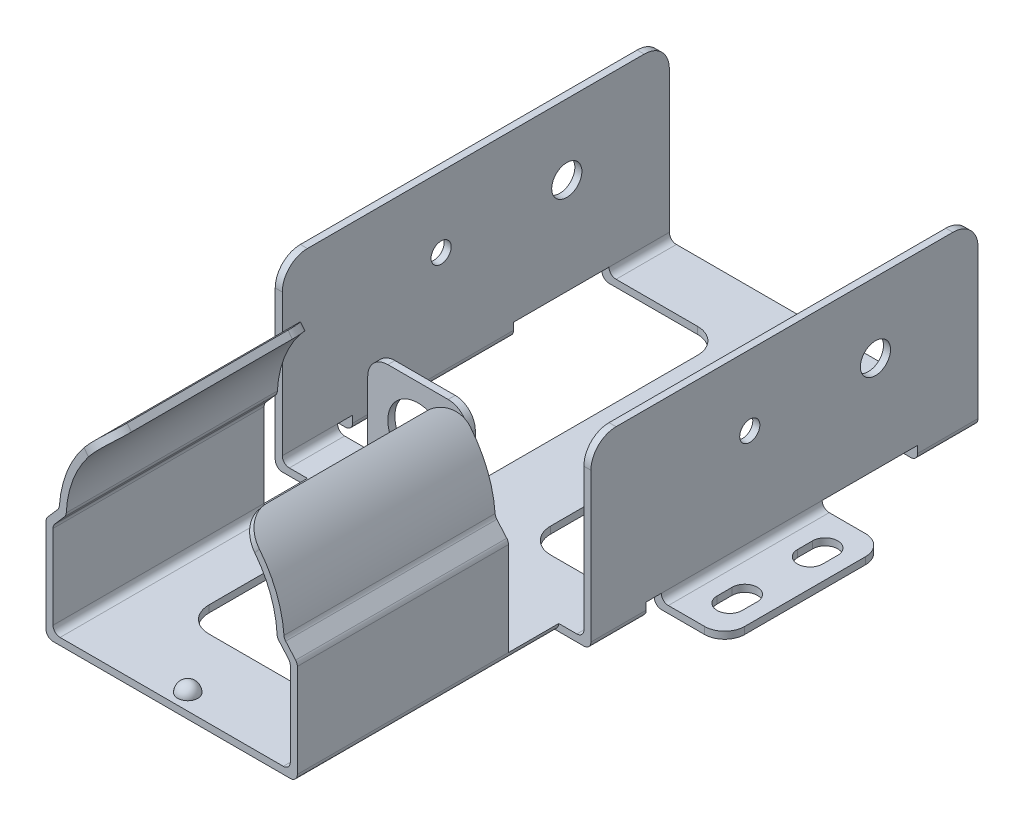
ISO-10303-21;
HEADER;
FILE_DESCRIPTION(('STEP AP214'),'2;1');
FILE_NAME('part.step','',(''),(''),'','','');
FILE_SCHEMA(('AUTOMOTIVE_DESIGN { 1 0 10303 214 1 1 1 1 }'));
ENDSEC;
DATA;
#1=APPLICATION_CONTEXT('core data for automotive mechanical design processes');
#2=APPLICATION_PROTOCOL_DEFINITION('international standard','automotive_design',2000,#1);
#3=PRODUCT_CONTEXT('',#1,'mechanical');
#4=PRODUCT('Part','Part','',(#3));
#5=PRODUCT_RELATED_PRODUCT_CATEGORY('part','',(#4));
#6=PRODUCT_DEFINITION_FORMATION('','',#4);
#7=PRODUCT_DEFINITION_CONTEXT('part definition',#1,'design');
#8=PRODUCT_DEFINITION('design','',#6,#7);
#9=PRODUCT_DEFINITION_SHAPE('','',#8);
#10=(LENGTH_UNIT() NAMED_UNIT(*) SI_UNIT(.MILLI.,.METRE.));
#11=(NAMED_UNIT(*) PLANE_ANGLE_UNIT() SI_UNIT($,.RADIAN.));
#12=(NAMED_UNIT(*) SI_UNIT($,.STERADIAN.) SOLID_ANGLE_UNIT());
#13=UNCERTAINTY_MEASURE_WITH_UNIT(LENGTH_MEASURE(1.E-05),#10,'distance_accuracy_value','');
#14=(GEOMETRIC_REPRESENTATION_CONTEXT(3) GLOBAL_UNCERTAINTY_ASSIGNED_CONTEXT((#13)) GLOBAL_UNIT_ASSIGNED_CONTEXT((#10,
#11,#12)) REPRESENTATION_CONTEXT('',''));
#15=CARTESIAN_POINT('',(0.,0.,0.));
#16=DIRECTION('',(0.,0.,1.));
#17=DIRECTION('',(1.,0.,0.));
#18=AXIS2_PLACEMENT_3D('',#15,#16,#17);
#19=CARTESIAN_POINT('',(-12.5,-11.2,-21.));
#20=DIRECTION('',(0.,-1.,0.));
#21=DIRECTION('',(0.,0.,-1.));
#22=AXIS2_PLACEMENT_3D('',#19,#20,#21);
#23=PLANE('',#22);
#24=DIRECTION('',(-1.,0.,0.));
#25=VECTOR('',#24,1.);
#26=CARTESIAN_POINT('',(15.7,-11.2,-26.));
#27=LINE('',#26,#25);
#28=CARTESIAN_POINT('',(15.,-11.2,-26.));
#29=VERTEX_POINT('',#28);
#30=CARTESIAN_POINT('',(11.8,-11.2,-26.));
#31=VERTEX_POINT('',#30);
#32=EDGE_CURVE('E1212',#29,#31,#27,.T.);
#33=ORIENTED_EDGE('',*,*,#32,.T.);
#34=DIRECTION('',(0.,0.,1.));
#35=VECTOR('',#34,1.);
#36=CARTESIAN_POINT('',(11.8,-11.2,-21.));
#37=LINE('',#36,#35);
#38=CARTESIAN_POINT('',(11.8,-11.2,0.));
#39=VERTEX_POINT('',#38);
#40=EDGE_CURVE('E1230',#31,#39,#37,.T.);
#41=ORIENTED_EDGE('',*,*,#40,.T.);
#42=DIRECTION('',(1.,0.,0.));
#43=VECTOR('',#42,1.);
#44=CARTESIAN_POINT('',(-12.5,-11.2,0.));
#45=LINE('',#44,#43);
#46=CARTESIAN_POINT('',(-11.8,-11.2,0.));
#47=VERTEX_POINT('',#46);
#48=EDGE_CURVE('E2020',#47,#39,#45,.T.);
#49=ORIENTED_EDGE('',*,*,#48,.F.);
#50=DIRECTION('',(0.,0.,1.));
#51=VECTOR('',#50,1.);
#52=CARTESIAN_POINT('',(-11.8,-11.2,-21.));
#53=LINE('',#52,#51);
#54=CARTESIAN_POINT('',(-11.8,-11.2,-26.));
#55=VERTEX_POINT('',#54);
#56=EDGE_CURVE('E1227',#47,#55,#53,.F.);
#57=ORIENTED_EDGE('',*,*,#56,.T.);
#58=CARTESIAN_POINT('',(-15.,-11.2,-26.));
#59=VERTEX_POINT('',#58);
#60=EDGE_CURVE('E1202',#55,#59,#27,.T.);
#61=ORIENTED_EDGE('',*,*,#60,.T.);
#62=DIRECTION('',(0.,0.,1.));
#63=VECTOR('',#62,1.);
#64=CARTESIAN_POINT('',(-15.,-11.2,-31.5));
#65=LINE('',#64,#63);
#66=CARTESIAN_POINT('',(-15.,-11.2,-31.5));
#67=VERTEX_POINT('',#66);
#68=EDGE_CURVE('E1225',#59,#67,#65,.F.);
#69=ORIENTED_EDGE('',*,*,#68,.T.);
#70=DIRECTION('',(-1.,0.,0.));
#71=VECTOR('',#70,1.);
#72=CARTESIAN_POINT('',(-15.7,-11.2,-31.5));
#73=LINE('',#72,#71);
#74=CARTESIAN_POINT('',(-6.20000000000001,-11.2,-31.5));
#75=VERTEX_POINT('',#74);
#76=EDGE_CURVE('E1060',#75,#67,#73,.T.);
#77=ORIENTED_EDGE('',*,*,#76,.F.);
#78=CARTESIAN_POINT('',(-6.2,-11.2,-34.));
#79=DIRECTION('',(0.,-1.,0.));
#80=DIRECTION('',(0.,0.,1.));
#81=AXIS2_PLACEMENT_3D('',#78,#79,#80);
#82=CIRCLE('',#81,2.5);
#83=CARTESIAN_POINT('',(-3.7,-11.2,-34.));
#84=VERTEX_POINT('',#83);
#85=EDGE_CURVE('E1057',#84,#75,#82,.T.);
#86=ORIENTED_EDGE('',*,*,#85,.F.);
#87=DIRECTION('',(0.,0.,1.));
#88=VECTOR('',#87,1.);
#89=CARTESIAN_POINT('',(-3.7,-11.2,-34.));
#90=LINE('',#89,#88);
#91=CARTESIAN_POINT('',(-3.69999999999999,-11.2,-56.));
#92=VERTEX_POINT('',#91);
#93=EDGE_CURVE('E1054',#92,#84,#90,.T.);
#94=ORIENTED_EDGE('',*,*,#93,.F.);
#95=CARTESIAN_POINT('',(-6.2,-11.2,-56.));
#96=DIRECTION('',(0.,-1.,0.));
#97=DIRECTION('',(0.,0.,-1.));
#98=AXIS2_PLACEMENT_3D('',#95,#96,#97);
#99=CIRCLE('',#98,2.5);
#100=CARTESIAN_POINT('',(-6.20000000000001,-11.2,-58.5));
#101=VERTEX_POINT('',#100);
#102=EDGE_CURVE('E1051',#101,#92,#99,.T.);
#103=ORIENTED_EDGE('',*,*,#102,.F.);
#104=DIRECTION('',(1.,0.,0.));
#105=VECTOR('',#104,1.);
#106=CARTESIAN_POINT('',(-15.7,-11.2,-58.5));
#107=LINE('',#106,#105);
#108=CARTESIAN_POINT('',(-15.,-11.2,-58.5));
#109=VERTEX_POINT('',#108);
#110=EDGE_CURVE('E1063',#109,#101,#107,.T.);
#111=ORIENTED_EDGE('',*,*,#110,.F.);
#112=DIRECTION('',(0.,0.,1.));
#113=VECTOR('',#112,1.);
#114=CARTESIAN_POINT('',(-15.,-11.2,-64.5));
#115=LINE('',#114,#113);
#116=CARTESIAN_POINT('',(-15.,-11.2,-64.5));
#117=VERTEX_POINT('',#116);
#118=EDGE_CURVE('E1223',#109,#117,#115,.F.);
#119=ORIENTED_EDGE('',*,*,#118,.T.);
#120=DIRECTION('',(-1.,0.,0.));
#121=VECTOR('',#120,1.);
#122=CARTESIAN_POINT('',(15.7,-11.2,-64.5));
#123=LINE('',#122,#121);
#124=CARTESIAN_POINT('',(15.,-11.2,-64.5));
#125=VERTEX_POINT('',#124);
#126=EDGE_CURVE('E2730',#125,#117,#123,.T.);
#127=ORIENTED_EDGE('',*,*,#126,.F.);
#128=DIRECTION('',(0.,0.,1.));
#129=VECTOR('',#128,1.);
#130=CARTESIAN_POINT('',(15.,-11.2,-58.5));
#131=LINE('',#130,#129);
#132=CARTESIAN_POINT('',(15.,-11.2,-58.5));
#133=VERTEX_POINT('',#132);
#134=EDGE_CURVE('E1217',#125,#133,#131,.T.);
#135=ORIENTED_EDGE('',*,*,#134,.T.);
#136=DIRECTION('',(1.,0.,0.));
#137=VECTOR('',#136,1.);
#138=CARTESIAN_POINT('',(15.7,-11.2,-58.5));
#139=LINE('',#138,#137);
#140=CARTESIAN_POINT('',(6.20000000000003,-11.2,-58.5));
#141=VERTEX_POINT('',#140);
#142=EDGE_CURVE('E1160',#141,#133,#139,.T.);
#143=ORIENTED_EDGE('',*,*,#142,.F.);
#144=CARTESIAN_POINT('',(6.20000000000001,-11.2,-56.));
#145=DIRECTION('',(0.,-1.,0.));
#146=DIRECTION('',(0.,0.,1.));
#147=AXIS2_PLACEMENT_3D('',#144,#145,#146);
#148=CIRCLE('',#147,2.5);
#149=CARTESIAN_POINT('',(3.70000000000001,-11.2,-56.));
#150=VERTEX_POINT('',#149);
#151=EDGE_CURVE('E1157',#150,#141,#148,.T.);
#152=ORIENTED_EDGE('',*,*,#151,.F.);
#153=DIRECTION('',(0.,0.,-1.));
#154=VECTOR('',#153,1.);
#155=CARTESIAN_POINT('',(3.7,-11.2,-34.));
#156=LINE('',#155,#154);
#157=CARTESIAN_POINT('',(3.7,-11.2,-34.));
#158=VERTEX_POINT('',#157);
#159=EDGE_CURVE('E1154',#158,#150,#156,.T.);
#160=ORIENTED_EDGE('',*,*,#159,.F.);
#161=CARTESIAN_POINT('',(6.2,-11.2,-34.));
#162=DIRECTION('',(0.,-1.,0.));
#163=DIRECTION('',(0.,0.,-1.));
#164=AXIS2_PLACEMENT_3D('',#161,#162,#163);
#165=CIRCLE('',#164,2.5);
#166=CARTESIAN_POINT('',(6.20000000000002,-11.2,-31.5));
#167=VERTEX_POINT('',#166);
#168=EDGE_CURVE('E1151',#167,#158,#165,.T.);
#169=ORIENTED_EDGE('',*,*,#168,.F.);
#170=DIRECTION('',(-1.,0.,0.));
#171=VECTOR('',#170,1.);
#172=CARTESIAN_POINT('',(15.7,-11.2,-31.5));
#173=LINE('',#172,#171);
#174=CARTESIAN_POINT('',(15.,-11.2,-31.5));
#175=VERTEX_POINT('',#174);
#176=EDGE_CURVE('E1149',#175,#167,#173,.T.);
#177=ORIENTED_EDGE('',*,*,#176,.F.);
#178=DIRECTION('',(0.,0.,1.));
#179=VECTOR('',#178,1.);
#180=CARTESIAN_POINT('',(15.,-11.2,-26.));
#181=LINE('',#180,#179);
#182=EDGE_CURVE('E1220',#175,#29,#181,.T.);
#183=ORIENTED_EDGE('',*,*,#182,.T.);
#184=EDGE_LOOP('',(#33,#41,#49,#57,#61,#69,#77,#86,#94,#103,#111,#119,#127,#135,#143,#152,#160,
#169,#177,#183));
#185=FACE_BOUND('',#184,.T.);
#186=CARTESIAN_POINT('',(4.,-11.2,-22.7));
#187=DIRECTION('',(0.,-1.,0.));
#188=DIRECTION('',(0.,0.,1.));
#189=AXIS2_PLACEMENT_3D('',#186,#187,#188);
#190=CIRCLE('',#189,2.5);
#191=CARTESIAN_POINT('',(5.,-11.2,-24.9912878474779));
#192=VERTEX_POINT('',#191);
#193=CARTESIAN_POINT('',(6.5,-11.2,-22.7));
#194=VERTEX_POINT('',#193);
#195=EDGE_CURVE('E1114',#192,#194,#190,.T.);
#196=ORIENTED_EDGE('',*,*,#195,.F.);
#197=DIRECTION('',(0.,0.,-1.));
#198=VECTOR('',#197,1.);
#199=CARTESIAN_POINT('',(5.,-11.2,-21.));
#200=LINE('',#199,#198);
#201=CARTESIAN_POINT('',(5.,-11.2,-25.2));
#202=VERTEX_POINT('',#201);
#203=EDGE_CURVE('E765',#192,#202,#200,.T.);
#204=ORIENTED_EDGE('',*,*,#203,.T.);
#205=DIRECTION('',(-1.,0.,0.));
#206=VECTOR('',#205,1.);
#207=CARTESIAN_POINT('',(5.,-11.2,-25.2));
#208=LINE('',#207,#206);
#209=CARTESIAN_POINT('',(-5.,-11.2,-25.2));
#210=VERTEX_POINT('',#209);
#211=EDGE_CURVE('E769',#202,#210,#208,.T.);
#212=ORIENTED_EDGE('',*,*,#211,.T.);
#213=DIRECTION('',(0.,0.,-1.));
#214=VECTOR('',#213,1.);
#215=CARTESIAN_POINT('',(-5.,-11.2,-21.));
#216=LINE('',#215,#214);
#217=CARTESIAN_POINT('',(-5.,-11.2,-24.9912878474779));
#218=VERTEX_POINT('',#217);
#219=EDGE_CURVE('E754',#218,#210,#216,.T.);
#220=ORIENTED_EDGE('',*,*,#219,.F.);
#221=CARTESIAN_POINT('',(-4.,-11.2,-22.7));
#222=DIRECTION('',(0.,-1.,0.));
#223=DIRECTION('',(0.,0.,-1.));
#224=AXIS2_PLACEMENT_3D('',#221,#222,#223);
#225=CIRCLE('',#224,2.5);
#226=CARTESIAN_POINT('',(-6.5,-11.2,-22.7));
#227=VERTEX_POINT('',#226);
#228=EDGE_CURVE('E1112',#227,#218,#225,.T.);
#229=ORIENTED_EDGE('',*,*,#228,.F.);
#230=DIRECTION('',(0.,0.,-1.));
#231=VECTOR('',#230,1.);
#232=CARTESIAN_POINT('',(-6.5,-11.2,-10.2));
#233=LINE('',#232,#231);
#234=CARTESIAN_POINT('',(-6.5,-11.2,-10.2));
#235=VERTEX_POINT('',#234);
#236=EDGE_CURVE('E1109',#235,#227,#233,.T.);
#237=ORIENTED_EDGE('',*,*,#236,.F.);
#238=CARTESIAN_POINT('',(-4.,-11.2,-10.2));
#239=DIRECTION('',(0.,-1.,0.));
#240=DIRECTION('',(0.,0.,-1.));
#241=AXIS2_PLACEMENT_3D('',#238,#239,#240);
#242=CIRCLE('',#241,2.5);
#243=CARTESIAN_POINT('',(-3.99999999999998,-11.2,-7.7));
#244=VERTEX_POINT('',#243);
#245=EDGE_CURVE('E1106',#244,#235,#242,.T.);
#246=ORIENTED_EDGE('',*,*,#245,.F.);
#247=DIRECTION('',(-1.,0.,0.));
#248=VECTOR('',#247,1.);
#249=CARTESIAN_POINT('',(3.99999999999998,-11.2,-7.7));
#250=LINE('',#249,#248);
#251=CARTESIAN_POINT('',(3.99999999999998,-11.2,-7.7));
#252=VERTEX_POINT('',#251);
#253=EDGE_CURVE('E1103',#252,#244,#250,.T.);
#254=ORIENTED_EDGE('',*,*,#253,.F.);
#255=CARTESIAN_POINT('',(4.,-11.2,-10.2));
#256=DIRECTION('',(0.,-1.,0.));
#257=DIRECTION('',(0.,0.,1.));
#258=AXIS2_PLACEMENT_3D('',#255,#256,#257);
#259=CIRCLE('',#258,2.5);
#260=CARTESIAN_POINT('',(6.5,-11.2,-10.2));
#261=VERTEX_POINT('',#260);
#262=EDGE_CURVE('E1101',#261,#252,#259,.T.);
#263=ORIENTED_EDGE('',*,*,#262,.F.);
#264=DIRECTION('',(0.,0.,1.));
#265=VECTOR('',#264,1.);
#266=CARTESIAN_POINT('',(6.5,-11.2,-10.2));
#267=LINE('',#266,#265);
#268=EDGE_CURVE('E1116',#194,#261,#267,.T.);
#269=ORIENTED_EDGE('',*,*,#268,.F.);
#270=EDGE_LOOP('',(#196,#204,#212,#220,#229,#237,#246,#254,#263,#269));
#271=FACE_BOUND('',#270,.T.);
#272=ADVANCED_FACE('F27',(#185,#271),#23,.T.);
#273=CARTESIAN_POINT('',(4.,-9.8,-22.7));
#274=DIRECTION('',(0.,-1.,0.));
#275=DIRECTION('',(0.,0.,-1.));
#276=AXIS2_PLACEMENT_3D('',#273,#274,#275);
#277=CYLINDRICAL_SURFACE('',#276,2.5);
#278=DIRECTION('',(0.,-1.,0.));
#279=VECTOR('',#278,1.);
#280=CARTESIAN_POINT('',(5.,-9.8,-24.9912878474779));
#281=LINE('',#280,#279);
#282=CARTESIAN_POINT('',(5.,-11.1681610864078,-24.9912878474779));
#283=VERTEX_POINT('',#282);
#284=EDGE_CURVE('E1404',#192,#283,#281,.F.);
#285=ORIENTED_EDGE('',*,*,#284,.F.);
#286=ORIENTED_EDGE('',*,*,#195,.T.);
#287=DIRECTION('',(0.,-1.,0.));
#288=VECTOR('',#287,1.);
#289=CARTESIAN_POINT('',(6.5,-9.8,-22.7));
#290=LINE('',#289,#288);
#291=CARTESIAN_POINT('',(6.5,-10.5,-22.7));
#292=VERTEX_POINT('',#291);
#293=EDGE_CURVE('E1123',#292,#194,#290,.T.);
#294=ORIENTED_EDGE('',*,*,#293,.F.);
#295=CARTESIAN_POINT('',(4.,-10.5,-22.7));
#296=DIRECTION('',(0.,1.,0.));
#297=DIRECTION('',(0.,0.,1.));
#298=AXIS2_PLACEMENT_3D('',#295,#296,#297);
#299=CIRCLE('',#298,2.5);
#300=CARTESIAN_POINT('',(5.,-10.5,-24.9912878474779));
#301=VERTEX_POINT('',#300);
#302=EDGE_CURVE('E1142',#292,#301,#299,.T.);
#303=ORIENTED_EDGE('',*,*,#302,.T.);
#304=EDGE_CURVE('E1408',#283,#301,#281,.F.);
#305=ORIENTED_EDGE('',*,*,#304,.F.);
#306=EDGE_LOOP('',(#285,#286,#294,#303,#305));
#307=FACE_BOUND('',#306,.T.);
#308=ADVANCED_FACE('F1415',(#307),#277,.F.);
#309=CARTESIAN_POINT('',(-4.,-9.8,-22.7));
#310=DIRECTION('',(0.,-1.,0.));
#311=DIRECTION('',(0.,0.,-1.));
#312=AXIS2_PLACEMENT_3D('',#309,#310,#311);
#313=CYLINDRICAL_SURFACE('',#312,2.5);
#314=DIRECTION('',(0.,-1.,0.));
#315=VECTOR('',#314,1.);
#316=CARTESIAN_POINT('',(-5.,-9.8,-24.9912878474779));
#317=LINE('',#316,#315);
#318=CARTESIAN_POINT('',(-5.,-10.5,-24.9912878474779));
#319=VERTEX_POINT('',#318);
#320=CARTESIAN_POINT('',(-5.,-11.1681610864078,-24.9912878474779));
#321=VERTEX_POINT('',#320);
#322=EDGE_CURVE('E1418',#319,#321,#317,.T.);
#323=ORIENTED_EDGE('',*,*,#322,.F.);
#324=CARTESIAN_POINT('',(-4.,-10.5,-22.7));
#325=DIRECTION('',(0.,1.,0.));
#326=DIRECTION('',(0.,0.,1.));
#327=AXIS2_PLACEMENT_3D('',#324,#325,#326);
#328=CIRCLE('',#327,2.5);
#329=CARTESIAN_POINT('',(-6.5,-10.5,-22.7));
#330=VERTEX_POINT('',#329);
#331=EDGE_CURVE('E1140',#319,#330,#328,.T.);
#332=ORIENTED_EDGE('',*,*,#331,.T.);
#333=DIRECTION('',(0.,-1.,0.));
#334=VECTOR('',#333,1.);
#335=CARTESIAN_POINT('',(-6.5,-9.8,-22.7));
#336=LINE('',#335,#334);
#337=EDGE_CURVE('E1126',#330,#227,#336,.T.);
#338=ORIENTED_EDGE('',*,*,#337,.T.);
#339=ORIENTED_EDGE('',*,*,#228,.T.);
#340=EDGE_CURVE('E760',#321,#218,#317,.T.);
#341=ORIENTED_EDGE('',*,*,#340,.F.);
#342=EDGE_LOOP('',(#323,#332,#338,#339,#341));
#343=FACE_BOUND('',#342,.T.);
#344=ADVANCED_FACE('F1826',(#343),#313,.F.);
#345=CARTESIAN_POINT('',(-6.2,-9.8,-56.));
#346=DIRECTION('',(0.,-1.,0.));
#347=DIRECTION('',(0.,0.,-1.));
#348=AXIS2_PLACEMENT_3D('',#345,#346,#347);
#349=PLANE('',#348);
#350=DIRECTION('',(0.,0.,1.));
#351=VECTOR('',#350,1.);
#352=CARTESIAN_POINT('',(-15.,-9.8,-64.5));
#353=LINE('',#352,#351);
#354=CARTESIAN_POINT('',(-15.,-9.8,-58.5));
#355=VERTEX_POINT('',#354);
#356=CARTESIAN_POINT('',(-15.,-9.8,-49.));
#357=VERTEX_POINT('',#356);
#358=EDGE_CURVE('E1769',#355,#357,#353,.T.);
#359=ORIENTED_EDGE('',*,*,#358,.T.);
#360=DIRECTION('',(-1.,0.,0.));
#361=VECTOR('',#360,1.);
#362=CARTESIAN_POINT('',(-15.,-9.8,-49.));
#363=LINE('',#362,#361);
#364=CARTESIAN_POINT('',(-15.7,-9.8,-49.));
#365=VERTEX_POINT('',#364);
#366=EDGE_CURVE('E923',#357,#365,#363,.T.);
#367=ORIENTED_EDGE('',*,*,#366,.T.);
#368=DIRECTION('',(0.,0.,-1.));
#369=VECTOR('',#368,1.);
#370=CARTESIAN_POINT('',(-15.7,-9.8,-31.5));
#371=LINE('',#370,#369);
#372=CARTESIAN_POINT('',(-15.7,-9.8,-58.5));
#373=VERTEX_POINT('',#372);
#374=EDGE_CURVE('E1068',#365,#373,#371,.T.);
#375=ORIENTED_EDGE('',*,*,#374,.T.);
#376=DIRECTION('',(1.,0.,0.));
#377=VECTOR('',#376,1.);
#378=CARTESIAN_POINT('',(-15.7,-9.8,-58.5));
#379=LINE('',#378,#377);
#380=EDGE_CURVE('E1072',#373,#355,#379,.T.);
#381=ORIENTED_EDGE('',*,*,#380,.T.);
#382=EDGE_LOOP('',(#359,#367,#375,#381));
#383=FACE_BOUND('',#382,.T.);
#384=ADVANCED_FACE('F1867',(#383),#349,.T.);
#385=CARTESIAN_POINT('',(-15.7,-9.8,-31.5));
#386=VERTEX_POINT('',#385);
#387=CARTESIAN_POINT('',(-15.7,-9.8,-33.));
#388=VERTEX_POINT('',#387);
#389=EDGE_CURVE('E1069',#386,#388,#371,.T.);
#390=ORIENTED_EDGE('',*,*,#389,.T.);
#391=DIRECTION('',(1.,0.,0.));
#392=VECTOR('',#391,1.);
#393=CARTESIAN_POINT('',(-15.,-9.8,-33.));
#394=LINE('',#393,#392);
#395=CARTESIAN_POINT('',(-15.,-9.8,-33.));
#396=VERTEX_POINT('',#395);
#397=EDGE_CURVE('E932',#388,#396,#394,.T.);
#398=ORIENTED_EDGE('',*,*,#397,.T.);
#399=CARTESIAN_POINT('',(-15.,-9.8,-31.5));
#400=VERTEX_POINT('',#399);
#401=EDGE_CURVE('E1767',#396,#400,#353,.T.);
#402=ORIENTED_EDGE('',*,*,#401,.T.);
#403=DIRECTION('',(-1.,0.,0.));
#404=VECTOR('',#403,1.);
#405=CARTESIAN_POINT('',(-15.7,-9.8,-31.5));
#406=LINE('',#405,#404);
#407=EDGE_CURVE('E1065',#400,#386,#406,.T.);
#408=ORIENTED_EDGE('',*,*,#407,.T.);
#409=EDGE_LOOP('',(#390,#398,#402,#408));
#410=FACE_BOUND('',#409,.T.);
#411=ADVANCED_FACE('F1777',(#410),#349,.T.);
#412=CARTESIAN_POINT('',(6.20000000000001,-9.8,-56.));
#413=DIRECTION('',(0.,1.,0.));
#414=DIRECTION('',(0.,0.,1.));
#415=AXIS2_PLACEMENT_3D('',#412,#413,#414);
#416=PLANE('',#415);
#417=DIRECTION('',(1.,0.,0.));
#418=VECTOR('',#417,1.);
#419=CARTESIAN_POINT('',(15.,-9.8,-33.));
#420=LINE('',#419,#418);
#421=CARTESIAN_POINT('',(15.,-9.8,-33.));
#422=VERTEX_POINT('',#421);
#423=CARTESIAN_POINT('',(15.7,-9.8,-33.));
#424=VERTEX_POINT('',#423);
#425=EDGE_CURVE('E1037',#422,#424,#420,.T.);
#426=ORIENTED_EDGE('',*,*,#425,.T.);
#427=DIRECTION('',(0.,0.,1.));
#428=VECTOR('',#427,1.);
#429=CARTESIAN_POINT('',(15.7,-9.8,-31.5));
#430=LINE('',#429,#428);
#431=CARTESIAN_POINT('',(15.7,-9.8,-31.5));
#432=VERTEX_POINT('',#431);
#433=EDGE_CURVE('E1163',#424,#432,#430,.T.);
#434=ORIENTED_EDGE('',*,*,#433,.T.);
#435=DIRECTION('',(-1.,0.,0.));
#436=VECTOR('',#435,1.);
#437=CARTESIAN_POINT('',(15.7,-9.8,-31.5));
#438=LINE('',#437,#436);
#439=CARTESIAN_POINT('',(15.,-9.8,-31.5));
#440=VERTEX_POINT('',#439);
#441=EDGE_CURVE('E1167',#432,#440,#438,.T.);
#442=ORIENTED_EDGE('',*,*,#441,.T.);
#443=DIRECTION('',(0.,0.,1.));
#444=VECTOR('',#443,1.);
#445=CARTESIAN_POINT('',(15.,-9.8,-64.5));
#446=LINE('',#445,#444);
#447=EDGE_CURVE('E1768',#422,#440,#446,.T.);
#448=ORIENTED_EDGE('',*,*,#447,.F.);
#449=EDGE_LOOP('',(#426,#434,#442,#448));
#450=FACE_BOUND('',#449,.T.);
#451=ADVANCED_FACE('F1873',(#450),#416,.F.);
#452=DIRECTION('',(-1.,0.,0.));
#453=VECTOR('',#452,1.);
#454=CARTESIAN_POINT('',(15.,-9.8,-49.));
#455=LINE('',#454,#453);
#456=CARTESIAN_POINT('',(15.7,-9.8,-49.));
#457=VERTEX_POINT('',#456);
#458=CARTESIAN_POINT('',(15.,-9.8,-49.));
#459=VERTEX_POINT('',#458);
#460=EDGE_CURVE('E1045',#457,#459,#455,.T.);
#461=ORIENTED_EDGE('',*,*,#460,.T.);
#462=CARTESIAN_POINT('',(15.,-9.8,-58.5));
#463=VERTEX_POINT('',#462);
#464=EDGE_CURVE('E1765',#463,#459,#446,.T.);
#465=ORIENTED_EDGE('',*,*,#464,.F.);
#466=DIRECTION('',(1.,0.,0.));
#467=VECTOR('',#466,1.);
#468=CARTESIAN_POINT('',(15.7,-9.8,-58.5));
#469=LINE('',#468,#467);
#470=CARTESIAN_POINT('',(15.7,-9.8,-58.5));
#471=VERTEX_POINT('',#470);
#472=EDGE_CURVE('E1170',#463,#471,#469,.T.);
#473=ORIENTED_EDGE('',*,*,#472,.T.);
#474=EDGE_CURVE('E1164',#471,#457,#430,.T.);
#475=ORIENTED_EDGE('',*,*,#474,.T.);
#476=EDGE_LOOP('',(#461,#465,#473,#475));
#477=FACE_BOUND('',#476,.T.);
#478=ADVANCED_FACE('F1876',(#477),#416,.F.);
#479=CARTESIAN_POINT('',(0.,0.,-21.));
#480=DIRECTION('',(0.,0.,1.));
#481=DIRECTION('',(1.,0.,0.));
#482=AXIS2_PLACEMENT_3D('',#479,#480,#481);
#483=PLANE('',#482);
#484=CARTESIAN_POINT('',(0.,0.,-21.));
#485=DIRECTION('',(0.,0.,-1.));
#486=DIRECTION('',(1.,0.,0.));
#487=AXIS2_PLACEMENT_3D('',#484,#485,#486);
#488=CIRCLE('',#487,10.5);
#489=CARTESIAN_POINT('',(-10.4862132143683,0.537896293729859,-21.));
#490=VERTEX_POINT('',#489);
#491=CARTESIAN_POINT('',(-8.27268633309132,6.46627101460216,-21.));
#492=VERTEX_POINT('',#491);
#493=EDGE_CURVE('E2038',#490,#492,#488,.T.);
#494=ORIENTED_EDGE('',*,*,#493,.F.);
#495=CARTESIAN_POINT('',(-11.1852940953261,0.573756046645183,-21.));
#496=DIRECTION('',(0.,0.,1.));
#497=DIRECTION('',(1.,0.,0.));
#498=AXIS2_PLACEMENT_3D('',#495,#496,#497);
#499=CIRCLE('',#498,0.7);
#500=CARTESIAN_POINT('',(-10.6570595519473,0.114443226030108,-21.));
#501=VERTEX_POINT('',#500);
#502=EDGE_CURVE('E1971',#490,#501,#499,.F.);
#503=ORIENTED_EDGE('',*,*,#502,.T.);
#504=DIRECTION('',(0.656161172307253,0.754620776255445,0.));
#505=VECTOR('',#504,1.);
#506=CARTESIAN_POINT('',(-11.8,-1.2,-21.));
#507=LINE('',#506,#505);
#508=CARTESIAN_POINT('',(-11.6282345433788,-1.00246045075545,-21.));
#509=VERTEX_POINT('',#508);
#510=EDGE_CURVE('E1753',#509,#501,#507,.T.);
#511=ORIENTED_EDGE('',*,*,#510,.F.);
#512=CARTESIAN_POINT('',(-11.1,-1.46177327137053,-21.));
#513=DIRECTION('',(0.,0.,1.));
#514=DIRECTION('',(1.,0.,0.));
#515=AXIS2_PLACEMENT_3D('',#512,#513,#514);
#516=CIRCLE('',#515,0.7);
#517=CARTESIAN_POINT('',(-11.8,-1.46177327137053,-21.));
#518=VERTEX_POINT('',#517);
#519=EDGE_CURVE('E1324',#509,#518,#516,.T.);
#520=ORIENTED_EDGE('',*,*,#519,.T.);
#521=DIRECTION('',(0.,1.,0.));
#522=VECTOR('',#521,1.);
#523=CARTESIAN_POINT('',(-11.8,-10.5,-21.));
#524=LINE('',#523,#522);
#525=CARTESIAN_POINT('',(-11.8,-9.8,-21.));
#526=VERTEX_POINT('',#525);
#527=EDGE_CURVE('E1739',#526,#518,#524,.T.);
#528=ORIENTED_EDGE('',*,*,#527,.F.);
#529=CARTESIAN_POINT('',(-11.1,-9.8,-21.));
#530=DIRECTION('',(0.,0.,1.));
#531=DIRECTION('',(1.,0.,0.));
#532=AXIS2_PLACEMENT_3D('',#529,#530,#531);
#533=CIRCLE('',#532,0.7);
#534=CARTESIAN_POINT('',(-11.1,-10.5,-21.));
#535=VERTEX_POINT('',#534);
#536=EDGE_CURVE('E1315',#526,#535,#533,.T.);
#537=ORIENTED_EDGE('',*,*,#536,.T.);
#538=DIRECTION('',(1.,0.,0.));
#539=VECTOR('',#538,1.);
#540=CARTESIAN_POINT('',(12.5,-10.5,-21.));
#541=LINE('',#540,#539);
#542=CARTESIAN_POINT('',(-12.5,-10.5,-21.));
#543=VERTEX_POINT('',#542);
#544=EDGE_CURVE('E1721',#543,#535,#541,.T.);
#545=ORIENTED_EDGE('',*,*,#544,.F.);
#546=DIRECTION('',(0.,-1.,0.));
#547=VECTOR('',#546,1.);
#548=CARTESIAN_POINT('',(-12.5,-11.2,-21.));
#549=LINE('',#548,#547);
#550=CARTESIAN_POINT('',(-12.5,-1.2000000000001,-21.));
#551=VERTEX_POINT('',#550);
#552=EDGE_CURVE('E1976',#551,#543,#549,.T.);
#553=ORIENTED_EDGE('',*,*,#552,.F.);
#554=CARTESIAN_POINT('',(-11.8,-1.2000000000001,-21.));
#555=DIRECTION('',(0.,0.,1.));
#556=DIRECTION('',(1.,0.,0.));
#557=AXIS2_PLACEMENT_3D('',#554,#555,#556);
#558=CIRCLE('',#557,0.7);
#559=CARTESIAN_POINT('',(-12.3282345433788,-0.740687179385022,-21.));
#560=VERTEX_POINT('',#559);
#561=EDGE_CURVE('E1973',#551,#560,#558,.F.);
#562=ORIENTED_EDGE('',*,*,#561,.T.);
#563=DIRECTION('',(-0.656161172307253,-0.754620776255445,0.));
#564=VECTOR('',#563,1.);
#565=CARTESIAN_POINT('',(-12.5,-0.938226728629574,-21.));
#566=LINE('',#565,#564);
#567=CARTESIAN_POINT('',(-11.3410899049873,0.394582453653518,-21.));
#568=VERTEX_POINT('',#567);
#569=EDGE_CURVE('E1981',#568,#560,#566,.T.);
#570=ORIENTED_EDGE('',*,*,#569,.F.);
#571=CARTESIAN_POINT('',(-11.8693244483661,0.853895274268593,-21.));
#572=DIRECTION('',(0.,0.,1.));
#573=DIRECTION('',(1.,0.,0.));
#574=AXIS2_PLACEMENT_3D('',#571,#572,#573);
#575=CIRCLE('',#574,0.7);
#576=CARTESIAN_POINT('',(-11.1711288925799,0.803666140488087,-21.));
#577=VERTEX_POINT('',#576);
#578=EDGE_CURVE('E1345',#568,#577,#575,.T.);
#579=ORIENTED_EDGE('',*,*,#578,.T.);
#580=CARTESIAN_POINT('',(0.,0.,-21.));
#581=DIRECTION('',(0.,0.,1.));
#582=DIRECTION('',(1.,0.,0.));
#583=AXIS2_PLACEMENT_3D('',#580,#581,#582);
#584=CIRCLE('',#583,11.2);
#585=CARTESIAN_POINT('',(-8.71768621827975,7.03149678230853,-21.));
#586=VERTEX_POINT('',#585);
#587=EDGE_CURVE('E2039',#586,#577,#584,.T.);
#588=ORIENTED_EDGE('',*,*,#587,.F.);
#589=DIRECTION('',(-0.618589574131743,0.785714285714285,0.));
#590=VECTOR('',#589,1.);
#591=CARTESIAN_POINT('',(-8.459476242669,6.70352606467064,-21.));
#592=LINE('',#591,#590);
#593=EDGE_CURVE('E2090',#586,#492,#592,.F.);
#594=ORIENTED_EDGE('',*,*,#593,.T.);
#595=EDGE_LOOP('',(#494,#503,#511,#520,#528,#537,#545,#553,#562,#570,#579,#588,#594));
#596=FACE_BOUND('',#595,.T.);
#597=ADVANCED_FACE('F1737',(#596),#483,.F.);
#598=DIRECTION('',(-0.656161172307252,0.754620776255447,0.));
#599=VECTOR('',#598,1.);
#600=CARTESIAN_POINT('',(12.5,-0.938226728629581,-21.));
#601=LINE('',#600,#599);
#602=CARTESIAN_POINT('',(12.3282345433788,-0.74068717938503,-21.));
#603=VERTEX_POINT('',#602);
#604=CARTESIAN_POINT('',(11.3410899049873,0.394582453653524,-21.));
#605=VERTEX_POINT('',#604);
#606=EDGE_CURVE('E1989',#603,#605,#601,.T.);
#607=ORIENTED_EDGE('',*,*,#606,.F.);
#608=CARTESIAN_POINT('',(11.8,-1.20000000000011,-21.));
#609=DIRECTION('',(0.,0.,1.));
#610=DIRECTION('',(1.,0.,0.));
#611=AXIS2_PLACEMENT_3D('',#608,#609,#610);
#612=CIRCLE('',#611,0.7);
#613=CARTESIAN_POINT('',(12.5,-1.20000000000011,-21.));
#614=VERTEX_POINT('',#613);
#615=EDGE_CURVE('E2074',#603,#614,#612,.F.);
#616=ORIENTED_EDGE('',*,*,#615,.T.);
#617=DIRECTION('',(0.,1.,0.));
#618=VECTOR('',#617,1.);
#619=CARTESIAN_POINT('',(12.5,-11.2,-21.));
#620=LINE('',#619,#618);
#621=CARTESIAN_POINT('',(12.5,-10.5,-21.));
#622=VERTEX_POINT('',#621);
#623=EDGE_CURVE('E1980',#622,#614,#620,.T.);
#624=ORIENTED_EDGE('',*,*,#623,.F.);
#625=CARTESIAN_POINT('',(11.1,-10.5,-21.));
#626=VERTEX_POINT('',#625);
#627=EDGE_CURVE('E1997',#626,#622,#541,.T.);
#628=ORIENTED_EDGE('',*,*,#627,.F.);
#629=CARTESIAN_POINT('',(11.1,-9.8,-21.));
#630=DIRECTION('',(0.,0.,1.));
#631=DIRECTION('',(1.,0.,0.));
#632=AXIS2_PLACEMENT_3D('',#629,#630,#631);
#633=CIRCLE('',#632,0.7);
#634=CARTESIAN_POINT('',(11.8,-9.8,-21.));
#635=VERTEX_POINT('',#634);
#636=EDGE_CURVE('E1332',#626,#635,#633,.T.);
#637=ORIENTED_EDGE('',*,*,#636,.T.);
#638=DIRECTION('',(0.,-1.,0.));
#639=VECTOR('',#638,1.);
#640=CARTESIAN_POINT('',(11.8,-10.5,-21.));
#641=LINE('',#640,#639);
#642=CARTESIAN_POINT('',(11.8,-1.46177327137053,-21.));
#643=VERTEX_POINT('',#642);
#644=EDGE_CURVE('E2069',#643,#635,#641,.T.);
#645=ORIENTED_EDGE('',*,*,#644,.F.);
#646=CARTESIAN_POINT('',(11.1,-1.46177327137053,-21.));
#647=DIRECTION('',(0.,0.,1.));
#648=DIRECTION('',(1.,0.,0.));
#649=AXIS2_PLACEMENT_3D('',#646,#647,#648);
#650=CIRCLE('',#649,0.7);
#651=CARTESIAN_POINT('',(11.6282345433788,-1.00246045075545,-21.));
#652=VERTEX_POINT('',#651);
#653=EDGE_CURVE('E1328',#643,#652,#650,.T.);
#654=ORIENTED_EDGE('',*,*,#653,.T.);
#655=DIRECTION('',(0.656161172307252,-0.754620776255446,0.));
#656=VECTOR('',#655,1.);
#657=CARTESIAN_POINT('',(11.8,-1.2,-21.));
#658=LINE('',#657,#656);
#659=CARTESIAN_POINT('',(10.6570595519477,0.114443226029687,-21.));
#660=VERTEX_POINT('',#659);
#661=EDGE_CURVE('E2072',#660,#652,#658,.T.);
#662=ORIENTED_EDGE('',*,*,#661,.F.);
#663=CARTESIAN_POINT('',(11.1852940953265,0.573756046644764,-21.));
#664=DIRECTION('',(0.,0.,1.));
#665=DIRECTION('',(1.,0.,0.));
#666=AXIS2_PLACEMENT_3D('',#663,#664,#665);
#667=CIRCLE('',#666,0.7);
#668=CARTESIAN_POINT('',(10.4862132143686,0.537896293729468,-21.));
#669=VERTEX_POINT('',#668);
#670=EDGE_CURVE('E1963',#660,#669,#667,.F.);
#671=ORIENTED_EDGE('',*,*,#670,.T.);
#672=CARTESIAN_POINT('',(0.,0.,-21.));
#673=DIRECTION('',(0.,0.,-1.));
#674=DIRECTION('',(1.,0.,0.));
#675=AXIS2_PLACEMENT_3D('',#672,#673,#674);
#676=CIRCLE('',#675,10.5000000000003);
#677=CARTESIAN_POINT('',(8.27268633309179,6.46627101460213,-21.));
#678=VERTEX_POINT('',#677);
#679=EDGE_CURVE('E2160',#678,#669,#676,.T.);
#680=ORIENTED_EDGE('',*,*,#679,.F.);
#681=DIRECTION('',(-0.618589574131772,-0.785714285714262,0.));
#682=VECTOR('',#681,1.);
#683=CARTESIAN_POINT('',(8.8924889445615,7.2535260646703,-21.));
#684=LINE('',#683,#682);
#685=CARTESIAN_POINT('',(8.71768621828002,7.0314967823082,-21.));
#686=VERTEX_POINT('',#685);
#687=EDGE_CURVE('E2178',#678,#686,#684,.F.);
#688=ORIENTED_EDGE('',*,*,#687,.T.);
#689=CARTESIAN_POINT('',(0.,0.,-21.));
#690=DIRECTION('',(0.,0.,1.));
#691=DIRECTION('',(1.,0.,0.));
#692=AXIS2_PLACEMENT_3D('',#689,#690,#691);
#693=CIRCLE('',#692,11.2);
#694=CARTESIAN_POINT('',(11.1711288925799,0.803666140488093,-21.));
#695=VERTEX_POINT('',#694);
#696=EDGE_CURVE('E2162',#695,#686,#693,.T.);
#697=ORIENTED_EDGE('',*,*,#696,.F.);
#698=CARTESIAN_POINT('',(11.8693244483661,0.853895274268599,-21.));
#699=DIRECTION('',(0.,0.,1.));
#700=DIRECTION('',(1.,0.,0.));
#701=AXIS2_PLACEMENT_3D('',#698,#699,#700);
#702=CIRCLE('',#701,0.7);
#703=EDGE_CURVE('E1320',#695,#605,#702,.T.);
#704=ORIENTED_EDGE('',*,*,#703,.T.);
#705=EDGE_LOOP('',(#607,#616,#624,#628,#637,#645,#654,#662,#671,#680,#688,#697,#704));
#706=FACE_BOUND('',#705,.T.);
#707=ADVANCED_FACE('F1935',(#706),#483,.F.);
#708=CARTESIAN_POINT('',(-11.8,-10.5,-21.));
#709=DIRECTION('',(1.,0.,0.));
#710=DIRECTION('',(0.,1.,0.));
#711=AXIS2_PLACEMENT_3D('',#708,#709,#710);
#712=PLANE('',#711);
#713=DIRECTION('',(0.,1.,0.));
#714=VECTOR('',#713,1.);
#715=CARTESIAN_POINT('',(-11.8,-10.5,0.));
#716=LINE('',#715,#714);
#717=CARTESIAN_POINT('',(-11.8,-9.8,0.));
#718=VERTEX_POINT('',#717);
#719=CARTESIAN_POINT('',(-11.8,-1.46177327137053,0.));
#720=VERTEX_POINT('',#719);
#721=EDGE_CURVE('E1762',#718,#720,#716,.T.);
#722=ORIENTED_EDGE('',*,*,#721,.F.);
#723=DIRECTION('',(0.,0.,1.));
#724=VECTOR('',#723,1.);
#725=CARTESIAN_POINT('',(-11.8,-9.8,-21.));
#726=LINE('',#725,#724);
#727=EDGE_CURVE('E1745',#718,#526,#726,.F.);
#728=ORIENTED_EDGE('',*,*,#727,.T.);
#729=ORIENTED_EDGE('',*,*,#527,.T.);
#730=DIRECTION('',(0.,0.,1.));
#731=VECTOR('',#730,1.);
#732=CARTESIAN_POINT('',(-11.8,-1.46177327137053,0.));
#733=LINE('',#732,#731);
#734=EDGE_CURVE('E1741',#518,#720,#733,.T.);
#735=ORIENTED_EDGE('',*,*,#734,.T.);
#736=EDGE_LOOP('',(#722,#728,#729,#735));
#737=FACE_BOUND('',#736,.T.);
#738=ADVANCED_FACE('F1712',(#737),#712,.T.);
#739=CARTESIAN_POINT('',(-11.8,-10.5,-21.));
#740=DIRECTION('',(0.,1.,0.));
#741=DIRECTION('',(0.,0.,1.));
#742=AXIS2_PLACEMENT_3D('',#739,#740,#741);
#743=PLANE('',#742);
#744=CARTESIAN_POINT('',(0.,-10.5,-1.6));
#745=DIRECTION('',(0.,1.,0.));
#746=DIRECTION('',(0.,0.,1.));
#747=AXIS2_PLACEMENT_3D('',#744,#745,#746);
#748=CIRCLE('',#747,1.);
#749=CARTESIAN_POINT('',(0.,-10.5,-0.6));
#750=VERTEX_POINT('',#749);
#751=EDGE_CURVE('E1391',#750,#750,#748,.T.);
#752=ORIENTED_EDGE('',*,*,#751,.F.);
#753=EDGE_LOOP('',(#752));
#754=FACE_BOUND('',#753,.T.);
#755=DIRECTION('',(0.,0.,-1.));
#756=VECTOR('',#755,1.);
#757=CARTESIAN_POINT('',(-5.,-10.5,-21.));
#758=LINE('',#757,#756);
#759=CARTESIAN_POINT('',(-5.,-10.5,-25.9));
#760=VERTEX_POINT('',#759);
#761=EDGE_CURVE('E823',#319,#760,#758,.T.);
#762=ORIENTED_EDGE('',*,*,#761,.T.);
#763=DIRECTION('',(-1.,0.,0.));
#764=VECTOR('',#763,1.);
#765=CARTESIAN_POINT('',(5.,-10.5,-25.9));
#766=LINE('',#765,#764);
#767=CARTESIAN_POINT('',(5.,-10.5,-25.9));
#768=VERTEX_POINT('',#767);
#769=EDGE_CURVE('E1748',#760,#768,#766,.F.);
#770=ORIENTED_EDGE('',*,*,#769,.T.);
#771=DIRECTION('',(0.,0.,1.));
#772=VECTOR('',#771,1.);
#773=CARTESIAN_POINT('',(5.,-10.5,-21.));
#774=LINE('',#773,#772);
#775=EDGE_CURVE('E825',#768,#301,#774,.T.);
#776=ORIENTED_EDGE('',*,*,#775,.T.);
#777=ORIENTED_EDGE('',*,*,#302,.F.);
#778=DIRECTION('',(0.,0.,-1.));
#779=VECTOR('',#778,1.);
#780=CARTESIAN_POINT('',(6.5,-10.5,-21.));
#781=LINE('',#780,#779);
#782=CARTESIAN_POINT('',(6.5,-10.5,-10.2));
#783=VERTEX_POINT('',#782);
#784=EDGE_CURVE('E1145',#783,#292,#781,.T.);
#785=ORIENTED_EDGE('',*,*,#784,.F.);
#786=CARTESIAN_POINT('',(4.,-10.5,-10.2));
#787=DIRECTION('',(0.,1.,0.));
#788=DIRECTION('',(0.,0.,1.));
#789=AXIS2_PLACEMENT_3D('',#786,#787,#788);
#790=CIRCLE('',#789,2.5);
#791=CARTESIAN_POINT('',(3.99999999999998,-10.5,-7.7));
#792=VERTEX_POINT('',#791);
#793=EDGE_CURVE('E1147',#792,#783,#790,.T.);
#794=ORIENTED_EDGE('',*,*,#793,.F.);
#795=DIRECTION('',(1.,0.,0.));
#796=VECTOR('',#795,1.);
#797=CARTESIAN_POINT('',(-11.8,-10.5,-7.7));
#798=LINE('',#797,#796);
#799=CARTESIAN_POINT('',(-3.99999999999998,-10.5,-7.7));
#800=VERTEX_POINT('',#799);
#801=EDGE_CURVE('E1122',#800,#792,#798,.T.);
#802=ORIENTED_EDGE('',*,*,#801,.F.);
#803=CARTESIAN_POINT('',(-4.,-10.5,-10.2));
#804=DIRECTION('',(0.,1.,0.));
#805=DIRECTION('',(0.,0.,1.));
#806=AXIS2_PLACEMENT_3D('',#803,#804,#805);
#807=CIRCLE('',#806,2.5);
#808=CARTESIAN_POINT('',(-6.5,-10.5,-10.2));
#809=VERTEX_POINT('',#808);
#810=EDGE_CURVE('E1135',#809,#800,#807,.T.);
#811=ORIENTED_EDGE('',*,*,#810,.F.);
#812=DIRECTION('',(0.,0.,1.));
#813=VECTOR('',#812,1.);
#814=CARTESIAN_POINT('',(-6.5,-10.5,-21.));
#815=LINE('',#814,#813);
#816=EDGE_CURVE('E1138',#330,#809,#815,.T.);
#817=ORIENTED_EDGE('',*,*,#816,.F.);
#818=ORIENTED_EDGE('',*,*,#331,.F.);
#819=EDGE_LOOP('',(#762,#770,#776,#777,#785,#794,#802,#811,#817,#818));
#820=FACE_BOUND('',#819,.T.);
#821=ORIENTED_EDGE('',*,*,#544,.T.);
#822=DIRECTION('',(0.,0.,1.));
#823=VECTOR('',#822,1.);
#824=CARTESIAN_POINT('',(-11.1,-10.5,0.));
#825=LINE('',#824,#823);
#826=CARTESIAN_POINT('',(-11.1,-10.5,0.));
#827=VERTEX_POINT('',#826);
#828=EDGE_CURVE('E1724',#535,#827,#825,.T.);
#829=ORIENTED_EDGE('',*,*,#828,.T.);
#830=DIRECTION('',(-1.,0.,0.));
#831=VECTOR('',#830,1.);
#832=CARTESIAN_POINT('',(-11.8,-10.5,0.));
#833=LINE('',#832,#831);
#834=CARTESIAN_POINT('',(11.1,-10.5,0.));
#835=VERTEX_POINT('',#834);
#836=EDGE_CURVE('E1754',#835,#827,#833,.T.);
#837=ORIENTED_EDGE('',*,*,#836,.F.);
#838=DIRECTION('',(0.,0.,1.));
#839=VECTOR('',#838,1.);
#840=CARTESIAN_POINT('',(11.1,-10.5,-21.));
#841=LINE('',#840,#839);
#842=EDGE_CURVE('E1742',#835,#626,#841,.F.);
#843=ORIENTED_EDGE('',*,*,#842,.T.);
#844=ORIENTED_EDGE('',*,*,#627,.T.);
#845=DIRECTION('',(0.,0.,1.));
#846=VECTOR('',#845,1.);
#847=CARTESIAN_POINT('',(12.5,-10.5,-26.));
#848=LINE('',#847,#846);
#849=CARTESIAN_POINT('',(12.5,-10.5,-26.));
#850=VERTEX_POINT('',#849);
#851=EDGE_CURVE('E1731',#850,#622,#848,.T.);
#852=ORIENTED_EDGE('',*,*,#851,.F.);
#853=DIRECTION('',(1.,0.,0.));
#854=VECTOR('',#853,1.);
#855=CARTESIAN_POINT('',(15.,-10.5,-26.));
#856=LINE('',#855,#854);
#857=CARTESIAN_POINT('',(14.3,-10.5,-26.));
#858=VERTEX_POINT('',#857);
#859=EDGE_CURVE('E2122',#850,#858,#856,.T.);
#860=ORIENTED_EDGE('',*,*,#859,.T.);
#861=DIRECTION('',(0.,0.,1.));
#862=VECTOR('',#861,1.);
#863=CARTESIAN_POINT('',(14.3,-10.5,-21.));
#864=LINE('',#863,#862);
#865=CARTESIAN_POINT('',(14.3,-10.5,-31.5));
#866=VERTEX_POINT('',#865);
#867=EDGE_CURVE('E1791',#858,#866,#864,.F.);
#868=ORIENTED_EDGE('',*,*,#867,.T.);
#869=DIRECTION('',(1.,0.,0.));
#870=VECTOR('',#869,1.);
#871=CARTESIAN_POINT('',(-11.8,-10.5,-31.5));
#872=LINE('',#871,#870);
#873=CARTESIAN_POINT('',(6.20000000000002,-10.5,-31.5));
#874=VERTEX_POINT('',#873);
#875=EDGE_CURVE('E1177',#874,#866,#872,.T.);
#876=ORIENTED_EDGE('',*,*,#875,.F.);
#877=CARTESIAN_POINT('',(6.2,-10.5,-34.));
#878=DIRECTION('',(0.,1.,0.));
#879=DIRECTION('',(0.,0.,1.));
#880=AXIS2_PLACEMENT_3D('',#877,#878,#879);
#881=CIRCLE('',#880,2.5);
#882=CARTESIAN_POINT('',(3.7,-10.5,-34.));
#883=VERTEX_POINT('',#882);
#884=EDGE_CURVE('E1193',#883,#874,#881,.T.);
#885=ORIENTED_EDGE('',*,*,#884,.F.);
#886=DIRECTION('',(0.,0.,1.));
#887=VECTOR('',#886,1.);
#888=CARTESIAN_POINT('',(3.7,-10.5,-21.));
#889=LINE('',#888,#887);
#890=CARTESIAN_POINT('',(3.70000000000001,-10.5,-56.));
#891=VERTEX_POINT('',#890);
#892=EDGE_CURVE('E1195',#891,#883,#889,.T.);
#893=ORIENTED_EDGE('',*,*,#892,.F.);
#894=CARTESIAN_POINT('',(6.20000000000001,-10.5,-56.));
#895=DIRECTION('',(0.,1.,0.));
#896=DIRECTION('',(0.,0.,1.));
#897=AXIS2_PLACEMENT_3D('',#894,#895,#896);
#898=CIRCLE('',#897,2.5);
#899=CARTESIAN_POINT('',(6.20000000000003,-10.5,-58.5));
#900=VERTEX_POINT('',#899);
#901=EDGE_CURVE('E1197',#900,#891,#898,.T.);
#902=ORIENTED_EDGE('',*,*,#901,.F.);
#903=DIRECTION('',(-1.,0.,0.));
#904=VECTOR('',#903,1.);
#905=CARTESIAN_POINT('',(-11.8,-10.5,-58.5));
#906=LINE('',#905,#904);
#907=CARTESIAN_POINT('',(14.3,-10.5,-58.5));
#908=VERTEX_POINT('',#907);
#909=EDGE_CURVE('E1191',#908,#900,#906,.T.);
#910=ORIENTED_EDGE('',*,*,#909,.F.);
#911=DIRECTION('',(0.,0.,1.));
#912=VECTOR('',#911,1.);
#913=CARTESIAN_POINT('',(14.3,-10.5,-21.));
#914=LINE('',#913,#912);
#915=CARTESIAN_POINT('',(14.3,-10.5,-64.5));
#916=VERTEX_POINT('',#915);
#917=EDGE_CURVE('E1795',#908,#916,#914,.F.);
#918=ORIENTED_EDGE('',*,*,#917,.T.);
#919=DIRECTION('',(1.,0.,0.));
#920=VECTOR('',#919,1.);
#921=CARTESIAN_POINT('',(15.,-10.5,-64.5));
#922=LINE('',#921,#920);
#923=CARTESIAN_POINT('',(-14.3,-10.5,-64.5));
#924=VERTEX_POINT('',#923);
#925=EDGE_CURVE('E2741',#924,#916,#922,.T.);
#926=ORIENTED_EDGE('',*,*,#925,.F.);
#927=DIRECTION('',(0.,0.,1.));
#928=VECTOR('',#927,1.);
#929=CARTESIAN_POINT('',(-14.3,-10.5,-21.));
#930=LINE('',#929,#928);
#931=CARTESIAN_POINT('',(-14.3,-10.5,-58.5));
#932=VERTEX_POINT('',#931);
#933=EDGE_CURVE('E1790',#924,#932,#930,.T.);
#934=ORIENTED_EDGE('',*,*,#933,.T.);
#935=DIRECTION('',(-1.,0.,0.));
#936=VECTOR('',#935,1.);
#937=CARTESIAN_POINT('',(-11.8,-10.5,-58.5));
#938=LINE('',#937,#936);
#939=CARTESIAN_POINT('',(-6.20000000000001,-10.5,-58.5));
#940=VERTEX_POINT('',#939);
#941=EDGE_CURVE('E1092',#940,#932,#938,.T.);
#942=ORIENTED_EDGE('',*,*,#941,.F.);
#943=CARTESIAN_POINT('',(-6.2,-10.5,-56.));
#944=DIRECTION('',(0.,1.,0.));
#945=DIRECTION('',(0.,0.,1.));
#946=AXIS2_PLACEMENT_3D('',#943,#944,#945);
#947=CIRCLE('',#946,2.5);
#948=CARTESIAN_POINT('',(-3.69999999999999,-10.5,-56.));
#949=VERTEX_POINT('',#948);
#950=EDGE_CURVE('E1099',#949,#940,#947,.T.);
#951=ORIENTED_EDGE('',*,*,#950,.F.);
#952=DIRECTION('',(0.,0.,-1.));
#953=VECTOR('',#952,1.);
#954=CARTESIAN_POINT('',(-3.7,-10.5,-21.));
#955=LINE('',#954,#953);
#956=CARTESIAN_POINT('',(-3.7,-10.5,-34.));
#957=VERTEX_POINT('',#956);
#958=EDGE_CURVE('E1095',#957,#949,#955,.T.);
#959=ORIENTED_EDGE('',*,*,#958,.F.);
#960=CARTESIAN_POINT('',(-6.2,-10.5,-34.));
#961=DIRECTION('',(0.,1.,0.));
#962=DIRECTION('',(0.,0.,1.));
#963=AXIS2_PLACEMENT_3D('',#960,#961,#962);
#964=CIRCLE('',#963,2.5);
#965=CARTESIAN_POINT('',(-6.20000000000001,-10.5,-31.5));
#966=VERTEX_POINT('',#965);
#967=EDGE_CURVE('E1097',#966,#957,#964,.T.);
#968=ORIENTED_EDGE('',*,*,#967,.F.);
#969=DIRECTION('',(1.,0.,0.));
#970=VECTOR('',#969,1.);
#971=CARTESIAN_POINT('',(-11.8,-10.5,-31.5));
#972=LINE('',#971,#970);
#973=CARTESIAN_POINT('',(-14.3,-10.5,-31.5));
#974=VERTEX_POINT('',#973);
#975=EDGE_CURVE('E1079',#974,#966,#972,.T.);
#976=ORIENTED_EDGE('',*,*,#975,.F.);
#977=DIRECTION('',(0.,0.,1.));
#978=VECTOR('',#977,1.);
#979=CARTESIAN_POINT('',(-14.3,-10.5,-21.));
#980=LINE('',#979,#978);
#981=CARTESIAN_POINT('',(-14.3,-10.5,-26.));
#982=VERTEX_POINT('',#981);
#983=EDGE_CURVE('E1788',#974,#982,#980,.T.);
#984=ORIENTED_EDGE('',*,*,#983,.T.);
#985=CARTESIAN_POINT('',(-12.5,-10.5,-26.));
#986=VERTEX_POINT('',#985);
#987=EDGE_CURVE('E2125',#982,#986,#856,.T.);
#988=ORIENTED_EDGE('',*,*,#987,.T.);
#989=DIRECTION('',(0.,0.,1.));
#990=VECTOR('',#989,1.);
#991=CARTESIAN_POINT('',(-12.5,-10.5,-26.));
#992=LINE('',#991,#990);
#993=EDGE_CURVE('E1728',#986,#543,#992,.T.);
#994=ORIENTED_EDGE('',*,*,#993,.T.);
#995=EDGE_LOOP('',(#821,#829,#837,#843,#844,#852,#860,#868,#876,#885,#893,#902,#910,#918,#926,
#934,#942,#951,#959,#968,#976,#984,#988,#994));
#996=FACE_BOUND('',#995,.T.);
#997=ADVANCED_FACE('F1709',(#754,#820,#996),#743,.T.);
#998=CARTESIAN_POINT('',(11.8,-10.5,-21.));
#999=DIRECTION('',(-1.,0.,0.));
#1000=DIRECTION('',(0.,-1.,0.));
#1001=AXIS2_PLACEMENT_3D('',#998,#999,#1000);
#1002=PLANE('',#1001);
#1003=DIRECTION('',(0.,-1.,0.));
#1004=VECTOR('',#1003,1.);
#1005=CARTESIAN_POINT('',(11.8,-10.5,0.));
#1006=LINE('',#1005,#1004);
#1007=CARTESIAN_POINT('',(11.8,-1.46177327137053,0.));
#1008=VERTEX_POINT('',#1007);
#1009=CARTESIAN_POINT('',(11.8,-9.8,0.));
#1010=VERTEX_POINT('',#1009);
#1011=EDGE_CURVE('E1956',#1008,#1010,#1006,.T.);
#1012=ORIENTED_EDGE('',*,*,#1011,.F.);
#1013=DIRECTION('',(0.,0.,1.));
#1014=VECTOR('',#1013,1.);
#1015=CARTESIAN_POINT('',(11.8,-1.46177327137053,-21.));
#1016=LINE('',#1015,#1014);
#1017=EDGE_CURVE('E1215',#1008,#643,#1016,.F.);
#1018=ORIENTED_EDGE('',*,*,#1017,.T.);
#1019=ORIENTED_EDGE('',*,*,#644,.T.);
#1020=DIRECTION('',(0.,0.,1.));
#1021=VECTOR('',#1020,1.);
#1022=CARTESIAN_POINT('',(11.8,-9.8,0.));
#1023=LINE('',#1022,#1021);
#1024=EDGE_CURVE('E1964',#635,#1010,#1023,.T.);
#1025=ORIENTED_EDGE('',*,*,#1024,.T.);
#1026=EDGE_LOOP('',(#1012,#1018,#1019,#1025));
#1027=FACE_BOUND('',#1026,.T.);
#1028=ADVANCED_FACE('F1711',(#1027),#1002,.T.);
#1029=CARTESIAN_POINT('',(11.8,-1.2,-21.));
#1030=DIRECTION('',(-0.754620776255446,-0.656161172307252,0.));
#1031=DIRECTION('',(0.656161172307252,-0.754620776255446,0.));
#1032=AXIS2_PLACEMENT_3D('',#1029,#1030,#1031);
#1033=PLANE('',#1032);
#1034=DIRECTION('',(0.656161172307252,-0.754620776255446,0.));
#1035=VECTOR('',#1034,1.);
#1036=CARTESIAN_POINT('',(11.8,-1.2,0.));
#1037=LINE('',#1036,#1035);
#1038=CARTESIAN_POINT('',(10.6570595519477,0.114443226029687,0.));
#1039=VERTEX_POINT('',#1038);
#1040=CARTESIAN_POINT('',(11.6282345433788,-1.00246045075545,0.));
#1041=VERTEX_POINT('',#1040);
#1042=EDGE_CURVE('E1949',#1039,#1041,#1037,.T.);
#1043=ORIENTED_EDGE('',*,*,#1042,.F.);
#1044=DIRECTION('',(0.,0.,1.));
#1045=VECTOR('',#1044,1.);
#1046=CARTESIAN_POINT('',(10.6570595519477,0.114443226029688,-21.));
#1047=LINE('',#1046,#1045);
#1048=EDGE_CURVE('E1952',#1039,#660,#1047,.F.);
#1049=ORIENTED_EDGE('',*,*,#1048,.T.);
#1050=ORIENTED_EDGE('',*,*,#661,.T.);
#1051=DIRECTION('',(0.,0.,1.));
#1052=VECTOR('',#1051,1.);
#1053=CARTESIAN_POINT('',(11.6282345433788,-1.00246045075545,0.));
#1054=LINE('',#1053,#1052);
#1055=EDGE_CURVE('E1955',#652,#1041,#1054,.T.);
#1056=ORIENTED_EDGE('',*,*,#1055,.T.);
#1057=EDGE_LOOP('',(#1043,#1049,#1050,#1056));
#1058=FACE_BOUND('',#1057,.T.);
#1059=ADVANCED_FACE('F1938',(#1058),#1033,.T.);
#1060=CARTESIAN_POINT('',(0.,0.,-21.));
#1061=DIRECTION('',(0.,0.,1.));
#1062=DIRECTION('',(1.,0.,0.));
#1063=AXIS2_PLACEMENT_3D('',#1060,#1061,#1062);
#1064=CYLINDRICAL_SURFACE('',#1063,10.5000000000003);
#1065=ORIENTED_EDGE('',*,*,#679,.T.);
#1066=DIRECTION('',(0.,0.,1.));
#1067=VECTOR('',#1066,1.);
#1068=CARTESIAN_POINT('',(10.4862132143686,0.537896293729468,-21.));
#1069=LINE('',#1068,#1067);
#1070=CARTESIAN_POINT('',(10.4862132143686,0.537896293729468,0.));
#1071=VERTEX_POINT('',#1070);
#1072=EDGE_CURVE('E1967',#669,#1071,#1069,.T.);
#1073=ORIENTED_EDGE('',*,*,#1072,.T.);
#1074=CARTESIAN_POINT('',(0.,0.,0.));
#1075=DIRECTION('',(0.,0.,-1.));
#1076=DIRECTION('',(1.,0.,0.));
#1077=AXIS2_PLACEMENT_3D('',#1074,#1075,#1076);
#1078=CIRCLE('',#1077,10.5000000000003);
#1079=CARTESIAN_POINT('',(8.27268633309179,6.46627101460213,0.));
#1080=VERTEX_POINT('',#1079);
#1081=EDGE_CURVE('E1957',#1080,#1071,#1078,.T.);
#1082=ORIENTED_EDGE('',*,*,#1081,.F.);
#1083=CARTESIAN_POINT('',(8.27268633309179,6.46627101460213,0.));
#1084=CARTESIAN_POINT('',(8.22950428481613,6.52152683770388,7.05450863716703E-06));
#1085=CARTESIAN_POINT('',(8.18575672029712,6.57634463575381,-0.00278348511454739));
#1086=CARTESIAN_POINT('',(8.0974609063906,6.68475726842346,-0.0139909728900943));
#1087=CARTESIAN_POINT('',(8.05291255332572,6.73835194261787,-0.0224086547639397));
#1088=CARTESIAN_POINT('',(7.96337189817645,6.84393918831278,-0.0448979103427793));
#1089=CARTESIAN_POINT('',(7.91837974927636,6.89593228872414,-0.0589675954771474));
#1090=CARTESIAN_POINT('',(7.82833843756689,6.99798243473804,-0.0927126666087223));
#1091=CARTESIAN_POINT('',(7.78328927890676,7.04803961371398,-0.112387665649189));
#1092=CARTESIAN_POINT('',(7.64852173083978,7.19497801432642,-0.179793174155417));
#1093=CARTESIAN_POINT('',(7.55922860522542,7.28857292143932,-0.235892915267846));
#1094=CARTESIAN_POINT('',(7.38550470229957,7.46456051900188,-0.368963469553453));
#1095=CARTESIAN_POINT('',(7.30107166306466,7.54695844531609,-0.44592447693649));
#1096=CARTESIAN_POINT('',(7.14159162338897,7.69802366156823,-0.6173631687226));
#1097=CARTESIAN_POINT('',(7.06642590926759,7.76687332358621,-0.711569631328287));
#1098=CARTESIAN_POINT('',(6.92712773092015,7.89136593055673,-0.91561769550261));
#1099=CARTESIAN_POINT('',(6.86299863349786,7.9470048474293,-1.02546404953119));
#1100=CARTESIAN_POINT('',(6.74810414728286,8.04480185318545,-1.25839720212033));
#1101=CARTESIAN_POINT('',(6.6974224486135,8.08687585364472,-1.38156049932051));
#1102=CARTESIAN_POINT('',(6.61210081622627,8.15678723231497,-1.63710789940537));
#1103=CARTESIAN_POINT('',(6.57745370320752,8.18463098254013,-1.76948784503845));
#1104=CARTESIAN_POINT('',(6.53289778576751,8.2202085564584,-2.00196587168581));
#1105=CARTESIAN_POINT('',(6.51878419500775,8.23138546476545,-2.10076781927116));
#1106=CARTESIAN_POINT('',(6.4999215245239,8.24627522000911,-2.29970050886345));
#1107=CARTESIAN_POINT('',(6.4951615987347,8.24999671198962,-2.39982957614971));
#1108=CARTESIAN_POINT('',(6.49519052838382,8.25000000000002,-2.5));
#1109=B_SPLINE_CURVE_WITH_KNOTS('',3,(#1083,#1084,#1085,#1086,#1087,#1088,#1089,#1090,#1091,
#1092,#1093,#1094,#1095,#1096,#1097,#1098,#1099,#1100,#1101,#1102,#1103,#1104,#1105,#1106,#1107,
#1108),.UNSPECIFIED.,.F.,.F.,(4,2,2,2,2,2,2,2,2,2,2,2,4),(0.,0.210327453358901,0.4206823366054,
0.630966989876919,0.841237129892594,1.26198704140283,1.6825395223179,2.09697165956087,
2.51152999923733,2.92861085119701,3.34550477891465,3.64610348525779,3.9463534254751),.UNSPECIFIED.);
#1110=CARTESIAN_POINT('',(6.49519052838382,8.25000000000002,-2.50000000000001));
#1111=VERTEX_POINT('',#1110);
#1112=EDGE_CURVE('E1475',#1080,#1111,#1109,.T.);
#1113=ORIENTED_EDGE('',*,*,#1112,.T.);
#1114=DIRECTION('',(0.,0.,1.));
#1115=VECTOR('',#1114,1.);
#1116=CARTESIAN_POINT('',(6.49519052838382,8.25000000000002,-21.));
#1117=LINE('',#1116,#1115);
#1118=CARTESIAN_POINT('',(6.49519052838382,8.25000000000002,-18.5));
#1119=VERTEX_POINT('',#1118);
#1120=EDGE_CURVE('E2000',#1119,#1111,#1117,.T.);
#1121=ORIENTED_EDGE('',*,*,#1120,.F.);
#1122=CARTESIAN_POINT('',(6.49519052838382,8.25000000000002,-18.5));
#1123=CARTESIAN_POINT('',(6.49518200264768,8.25000003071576,-18.5702771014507));
#1124=CARTESIAN_POINT('',(6.49751875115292,8.2481668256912,-18.6405510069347));
#1125=CARTESIAN_POINT('',(6.50681831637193,8.24083609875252,-18.7805967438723));
#1126=CARTESIAN_POINT('',(6.51378092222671,8.23533874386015,-18.8503685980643));
#1127=CARTESIAN_POINT('',(6.53226166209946,8.22068668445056,-18.9888755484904));
#1128=CARTESIAN_POINT('',(6.54377680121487,8.21153438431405,-19.0576112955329));
#1129=CARTESIAN_POINT('',(6.57122246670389,8.18958735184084,-19.1935831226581));
#1130=CARTESIAN_POINT('',(6.58715293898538,8.17679266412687,-19.260819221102));
#1131=CARTESIAN_POINT('',(6.64135183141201,8.13293564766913,-19.4596336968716));
#1132=CARTESIAN_POINT('',(6.68603478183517,8.09639494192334,-19.5883702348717));
#1133=CARTESIAN_POINT('',(6.79050248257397,8.00897507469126,-19.8342203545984));
#1134=CARTESIAN_POINT('',(6.8502846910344,7.9580983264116,-19.9513358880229));
#1135=CARTESIAN_POINT('',(6.98225029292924,7.84256545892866,-20.170436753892));
#1136=CARTESIAN_POINT('',(7.05440394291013,7.77794230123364,-20.272457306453));
#1137=CARTESIAN_POINT('',(7.20816573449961,7.63565903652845,-20.4587396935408));
#1138=CARTESIAN_POINT('',(7.28977350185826,7.55799944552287,-20.5430022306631));
#1139=CARTESIAN_POINT('',(7.45824245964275,7.39178405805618,-20.690686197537));
#1140=CARTESIAN_POINT('',(7.54504519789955,7.30334092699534,-20.7543013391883));
#1141=CARTESIAN_POINT('',(7.72124995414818,7.11679195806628,-20.860199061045));
#1142=CARTESIAN_POINT('',(7.81065145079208,7.01868804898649,-20.9024858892));
#1143=CARTESIAN_POINT('',(7.9628941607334,6.84481767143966,-20.9558755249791));
#1144=CARTESIAN_POINT('',(8.02591270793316,6.77083274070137,-20.9724670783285));
#1145=CARTESIAN_POINT('',(8.15055189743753,6.62028343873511,-20.9945308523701));
#1146=CARTESIAN_POINT('',(8.21217466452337,6.54372350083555,-21.0000212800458));
#1147=CARTESIAN_POINT('',(8.27268633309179,6.46627101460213,-21.));
#1148=B_SPLINE_CURVE_WITH_KNOTS('',3,(#1122,#1123,#1124,#1125,#1126,#1127,#1128,#1129,#1130,
#1131,#1132,#1133,#1134,#1135,#1136,#1137,#1138,#1139,#1140,#1141,#1142,#1143,#1144,#1145,#1146,
#1147),.UNSPECIFIED.,.F.,.F.,(4,2,2,2,2,2,2,2,2,2,2,2,4),(0.,0.210762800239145,
0.421515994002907,0.63213077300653,0.842742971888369,1.2638111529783,1.68480849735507,
2.10480751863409,2.52478991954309,2.94070982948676,3.35654686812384,3.65168468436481,
3.94633805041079),.UNSPECIFIED.);
#1149=EDGE_CURVE('E1468',#1119,#678,#1148,.T.);
#1150=ORIENTED_EDGE('',*,*,#1149,.T.);
#1151=EDGE_LOOP('',(#1065,#1073,#1082,#1113,#1121,#1150));
#1152=FACE_BOUND('',#1151,.T.);
#1153=ADVANCED_FACE('F1481',(#1152),#1064,.F.);
#1154=CARTESIAN_POINT('',(6.49519052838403,8.25000000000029,-21.));
#1155=DIRECTION('',(-0.785714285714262,0.618589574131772,0.));
#1156=DIRECTION('',(-0.618589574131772,-0.785714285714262,0.));
#1157=AXIS2_PLACEMENT_3D('',#1154,#1155,#1156);
#1158=PLANE('',#1157);
#1159=ORIENTED_EDGE('',*,*,#1120,.T.);
#1160=DIRECTION('',(-0.618589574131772,-0.785714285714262,0.));
#1161=VECTOR('',#1160,1.);
#1162=CARTESIAN_POINT('',(6.49519052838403,8.25000000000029,-2.5));
#1163=LINE('',#1162,#1161);
#1164=CARTESIAN_POINT('',(6.92820323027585,8.79999999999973,-2.50000000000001));
#1165=VERTEX_POINT('',#1164);
#1166=EDGE_CURVE('E1506',#1111,#1165,#1163,.F.);
#1167=ORIENTED_EDGE('',*,*,#1166,.T.);
#1168=DIRECTION('',(0.,0.,1.));
#1169=VECTOR('',#1168,1.);
#1170=CARTESIAN_POINT('',(6.92820323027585,8.79999999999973,-21.));
#1171=LINE('',#1170,#1169);
#1172=CARTESIAN_POINT('',(6.92820323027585,8.79999999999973,-18.5));
#1173=VERTEX_POINT('',#1172);
#1174=EDGE_CURVE('E2153',#1173,#1165,#1171,.T.);
#1175=ORIENTED_EDGE('',*,*,#1174,.F.);
#1176=DIRECTION('',(-0.618589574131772,-0.785714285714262,0.));
#1177=VECTOR('',#1176,1.);
#1178=CARTESIAN_POINT('',(6.49519052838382,8.25000000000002,-18.5));
#1179=LINE('',#1178,#1177);
#1180=EDGE_CURVE('E2186',#1173,#1119,#1179,.T.);
#1181=ORIENTED_EDGE('',*,*,#1180,.T.);
#1182=EDGE_LOOP('',(#1159,#1167,#1175,#1181));
#1183=FACE_BOUND('',#1182,.T.);
#1184=ADVANCED_FACE('F1516',(#1183),#1158,.T.);
#1185=CARTESIAN_POINT('',(0.,0.,-21.));
#1186=DIRECTION('',(0.,0.,1.));
#1187=DIRECTION('',(1.,0.,0.));
#1188=AXIS2_PLACEMENT_3D('',#1185,#1186,#1187);
#1189=CYLINDRICAL_SURFACE('',#1188,11.2);
#1190=CARTESIAN_POINT('',(0.,0.,0.));
#1191=DIRECTION('',(0.,0.,1.));
#1192=DIRECTION('',(1.,0.,0.));
#1193=AXIS2_PLACEMENT_3D('',#1190,#1191,#1192);
#1194=CIRCLE('',#1193,11.2);
#1195=CARTESIAN_POINT('',(11.1711288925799,0.803666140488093,0.));
#1196=VERTEX_POINT('',#1195);
#1197=CARTESIAN_POINT('',(8.71768621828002,7.0314967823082,0.));
#1198=VERTEX_POINT('',#1197);
#1199=EDGE_CURVE('E2029',#1196,#1198,#1194,.T.);
#1200=ORIENTED_EDGE('',*,*,#1199,.F.);
#1201=DIRECTION('',(0.,0.,1.));
#1202=VECTOR('',#1201,1.);
#1203=CARTESIAN_POINT('',(11.1711288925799,0.803666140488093,-21.));
#1204=LINE('',#1203,#1202);
#1205=EDGE_CURVE('E2103',#1196,#695,#1204,.F.);
#1206=ORIENTED_EDGE('',*,*,#1205,.T.);
#1207=ORIENTED_EDGE('',*,*,#696,.T.);
#1208=CARTESIAN_POINT('',(8.71768621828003,7.0314967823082,-21.));
#1209=CARTESIAN_POINT('',(8.67364979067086,7.08610306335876,-21.0000070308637));
#1210=CARTESIAN_POINT('',(8.62908945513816,7.14028990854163,-20.9971944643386));
#1211=CARTESIAN_POINT('',(8.53925615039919,7.24747952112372,-20.9859087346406));
#1212=CARTESIAN_POINT('',(8.49398310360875,7.30048215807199,-20.9774349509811));
#1213=CARTESIAN_POINT('',(8.40308694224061,7.40492582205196,-20.9548097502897));
#1214=CARTESIAN_POINT('',(8.35746396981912,7.45636744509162,-20.9406605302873));
#1215=CARTESIAN_POINT('',(8.26625207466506,7.55736176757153,-20.9067412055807));
#1216=CARTESIAN_POINT('',(8.22066314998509,7.60691458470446,-20.8869714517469));
#1217=CARTESIAN_POINT('',(8.08441898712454,7.75240295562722,-20.8192752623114));
#1218=CARTESIAN_POINT('',(7.99432253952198,7.84512706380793,-20.7629708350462));
#1219=CARTESIAN_POINT('',(7.81930156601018,8.01959142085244,-20.6295034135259));
#1220=CARTESIAN_POINT('',(7.73437481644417,8.1013364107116,-20.5523494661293));
#1221=CARTESIAN_POINT('',(7.57401926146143,8.25143315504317,-20.3804042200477));
#1222=CARTESIAN_POINT('',(7.49848260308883,8.31994324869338,-20.2858518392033));
#1223=CARTESIAN_POINT('',(7.35866326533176,8.4438634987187,-20.0810903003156));
#1224=CARTESIAN_POINT('',(7.29438387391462,8.49926982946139,-19.970876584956));
#1225=CARTESIAN_POINT('',(7.1793995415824,8.59662423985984,-19.7372759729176));
#1226=CARTESIAN_POINT('',(7.1287702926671,8.63849752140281,-19.6138207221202));
#1227=CARTESIAN_POINT('',(7.04366735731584,8.70802982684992,-19.3577134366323));
#1228=CARTESIAN_POINT('',(7.00918617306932,8.7356954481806,-19.2250657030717));
#1229=CARTESIAN_POINT('',(6.96518426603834,8.77079054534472,-18.9932338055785));
#1230=CARTESIAN_POINT('',(6.95134081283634,8.78174838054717,-18.8953655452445));
#1231=CARTESIAN_POINT('',(6.93284243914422,8.79634752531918,-18.6983442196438));
#1232=CARTESIAN_POINT('',(6.92817656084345,8.79999756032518,-18.5991928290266));
#1233=CARTESIAN_POINT('',(6.92820323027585,8.79999999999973,-18.5));
#1234=B_SPLINE_CURVE_WITH_KNOTS('',3,(#1208,#1209,#1210,#1211,#1212,#1213,#1214,#1215,#1216,
#1217,#1218,#1219,#1220,#1221,#1222,#1223,#1224,#1225,#1226,#1227,#1228,#1229,#1230,#1231,#1232,
#1233),.UNSPECIFIED.,.F.,.F.,(4,2,2,2,2,2,2,2,2,2,2,2,4),(0.,0.210393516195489,0.42081009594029,
0.631145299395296,0.841467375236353,1.26227641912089,1.68290316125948,2.09813475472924,
2.51348742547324,2.93109800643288,3.34851449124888,3.64619226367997,3.94351439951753),.UNSPECIFIED.);
#1235=EDGE_CURVE('E1498',#686,#1173,#1234,.T.);
#1236=ORIENTED_EDGE('',*,*,#1235,.T.);
#1237=ORIENTED_EDGE('',*,*,#1174,.T.);
#1238=CARTESIAN_POINT('',(6.92820323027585,8.79999999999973,-2.5));
#1239=CARTESIAN_POINT('',(6.928194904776,8.80000028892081,-2.42971811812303));
#1240=CARTESIAN_POINT('',(6.93053177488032,8.79816658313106,-2.35943943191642));
#1241=CARTESIAN_POINT('',(6.93983288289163,8.79083521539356,-2.21938425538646));
#1242=CARTESIAN_POINT('',(6.94679690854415,8.78533772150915,-2.1496077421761));
#1243=CARTESIAN_POINT('',(6.96528313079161,8.77068771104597,-2.01109251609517));
#1244=CARTESIAN_POINT('',(6.97680227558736,8.76153764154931,-1.94235314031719));
#1245=CARTESIAN_POINT('',(7.00426147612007,8.73960107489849,-1.8063742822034));
#1246=CARTESIAN_POINT('',(7.02020147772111,8.72681462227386,-1.73913478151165));
#1247=CARTESIAN_POINT('',(7.07444250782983,8.68299833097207,-1.54031100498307));
#1248=CARTESIAN_POINT('',(7.11917168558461,8.64650607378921,-1.41156893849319));
#1249=CARTESIAN_POINT('',(7.22380866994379,8.55927535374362,-1.1657074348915));
#1250=CARTESIAN_POINT('',(7.28371390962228,8.50853929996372,-1.04858603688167));
#1251=CARTESIAN_POINT('',(7.41607440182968,8.39341986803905,-0.829436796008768));
#1252=CARTESIAN_POINT('',(7.48850320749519,8.32906518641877,-0.727377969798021));
#1253=CARTESIAN_POINT('',(7.64301444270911,8.18750750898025,-0.541016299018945));
#1254=CARTESIAN_POINT('',(7.72509676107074,8.11030466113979,-0.456713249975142));
#1255=CARTESIAN_POINT('',(7.89487037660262,7.94511896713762,-0.308865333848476));
#1256=CARTESIAN_POINT('',(7.98250809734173,7.85723327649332,-0.245150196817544));
#1257=CARTESIAN_POINT('',(8.16069074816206,7.67200144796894,-0.139133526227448));
#1258=CARTESIAN_POINT('',(8.25123495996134,7.57465763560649,-0.0968267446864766));
#1259=CARTESIAN_POINT('',(8.40512166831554,7.40290523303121,-0.0437121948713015));
#1260=CARTESIAN_POINT('',(8.46856312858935,7.33026246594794,-0.0272827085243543));
#1261=CARTESIAN_POINT('',(8.59423384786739,7.18252358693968,-0.00542550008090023));
#1262=CARTESIAN_POINT('',(8.65646490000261,7.10743162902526,1.99567476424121E-05));
#1263=CARTESIAN_POINT('',(8.71768621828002,7.0314967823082,0.));
#1264=B_SPLINE_CURVE_WITH_KNOTS('',3,(#1238,#1239,#1240,#1241,#1242,#1243,#1244,#1245,#1246,
#1247,#1248,#1249,#1250,#1251,#1252,#1253,#1254,#1255,#1256,#1257,#1258,#1259,#1260,#1261,#1262,
#1263),.UNSPECIFIED.,.F.,.F.,(4,2,2,2,2,2,2,2,2,2,2,2,4),(0.,0.210777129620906,
0.421544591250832,0.632171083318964,0.842794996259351,1.26388499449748,1.68490381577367,
2.1050441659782,2.52517967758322,2.94174585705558,3.35820987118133,3.65109178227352,
3.94350042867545),.UNSPECIFIED.);
#1265=EDGE_CURVE('E1505',#1165,#1198,#1264,.T.);
#1266=ORIENTED_EDGE('',*,*,#1265,.T.);
#1267=EDGE_LOOP('',(#1200,#1206,#1207,#1236,#1237,#1266));
#1268=FACE_BOUND('',#1267,.T.);
#1269=ADVANCED_FACE('F1511',(#1268),#1189,.T.);
#1270=CARTESIAN_POINT('',(12.5,-0.938226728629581,-21.));
#1271=DIRECTION('',(0.754620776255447,0.656161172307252,0.));
#1272=DIRECTION('',(-0.656161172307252,0.754620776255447,0.));
#1273=AXIS2_PLACEMENT_3D('',#1270,#1271,#1272);
#1274=PLANE('',#1273);
#1275=ORIENTED_EDGE('',*,*,#606,.T.);
#1276=DIRECTION('',(0.,0.,-1.));
#1277=VECTOR('',#1276,1.);
#1278=CARTESIAN_POINT('',(11.3410899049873,0.394582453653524,0.));
#1279=LINE('',#1278,#1277);
#1280=CARTESIAN_POINT('',(11.3410899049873,0.394582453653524,0.));
#1281=VERTEX_POINT('',#1280);
#1282=EDGE_CURVE('E2098',#605,#1281,#1279,.F.);
#1283=ORIENTED_EDGE('',*,*,#1282,.T.);
#1284=DIRECTION('',(-0.656161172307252,0.754620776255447,0.));
#1285=VECTOR('',#1284,1.);
#1286=CARTESIAN_POINT('',(12.5,-0.938226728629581,0.));
#1287=LINE('',#1286,#1285);
#1288=CARTESIAN_POINT('',(12.3282345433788,-0.74068717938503,0.));
#1289=VERTEX_POINT('',#1288);
#1290=EDGE_CURVE('E2026',#1289,#1281,#1287,.T.);
#1291=ORIENTED_EDGE('',*,*,#1290,.F.);
#1292=DIRECTION('',(0.,0.,1.));
#1293=VECTOR('',#1292,1.);
#1294=CARTESIAN_POINT('',(12.3282345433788,-0.74068717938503,-21.));
#1295=LINE('',#1294,#1293);
#1296=EDGE_CURVE('E2097',#1289,#603,#1295,.F.);
#1297=ORIENTED_EDGE('',*,*,#1296,.T.);
#1298=EDGE_LOOP('',(#1275,#1283,#1291,#1297));
#1299=FACE_BOUND('',#1298,.T.);
#1300=ADVANCED_FACE('F1515',(#1299),#1274,.T.);
#1301=CARTESIAN_POINT('',(12.5,-11.2,-21.));
#1302=DIRECTION('',(1.,0.,0.));
#1303=DIRECTION('',(0.,0.,-1.));
#1304=AXIS2_PLACEMENT_3D('',#1301,#1302,#1303);
#1305=PLANE('',#1304);
#1306=ORIENTED_EDGE('',*,*,#623,.T.);
#1307=DIRECTION('',(0.,0.,1.));
#1308=VECTOR('',#1307,1.);
#1309=CARTESIAN_POINT('',(12.5,-1.20000000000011,-21.));
#1310=LINE('',#1309,#1308);
#1311=CARTESIAN_POINT('',(12.5,-1.20000000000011,0.));
#1312=VERTEX_POINT('',#1311);
#1313=EDGE_CURVE('E2054',#614,#1312,#1310,.T.);
#1314=ORIENTED_EDGE('',*,*,#1313,.T.);
#1315=DIRECTION('',(0.,1.,0.));
#1316=VECTOR('',#1315,1.);
#1317=CARTESIAN_POINT('',(12.5,-11.2,0.));
#1318=LINE('',#1317,#1316);
#1319=CARTESIAN_POINT('',(12.5,-10.5,0.));
#1320=VERTEX_POINT('',#1319);
#1321=EDGE_CURVE('E2023',#1320,#1312,#1318,.T.);
#1322=ORIENTED_EDGE('',*,*,#1321,.F.);
#1323=DIRECTION('',(0.,0.,1.));
#1324=VECTOR('',#1323,1.);
#1325=CARTESIAN_POINT('',(12.5,-10.5,-21.));
#1326=LINE('',#1325,#1324);
#1327=EDGE_CURVE('E2059',#1320,#622,#1326,.F.);
#1328=ORIENTED_EDGE('',*,*,#1327,.T.);
#1329=EDGE_LOOP('',(#1306,#1314,#1322,#1328));
#1330=FACE_BOUND('',#1329,.T.);
#1331=ADVANCED_FACE('F1521',(#1330),#1305,.T.);
#1332=CARTESIAN_POINT('',(-12.5,-11.2,-21.));
#1333=DIRECTION('',(-1.,0.,0.));
#1334=DIRECTION('',(0.,0.,1.));
#1335=AXIS2_PLACEMENT_3D('',#1332,#1333,#1334);
#1336=PLANE('',#1335);
#1337=ORIENTED_EDGE('',*,*,#552,.T.);
#1338=DIRECTION('',(0.,0.,1.));
#1339=VECTOR('',#1338,1.);
#1340=CARTESIAN_POINT('',(-12.5,-10.5,-21.));
#1341=LINE('',#1340,#1339);
#1342=CARTESIAN_POINT('',(-12.5,-10.5,0.));
#1343=VERTEX_POINT('',#1342);
#1344=EDGE_CURVE('E1235',#543,#1343,#1341,.T.);
#1345=ORIENTED_EDGE('',*,*,#1344,.T.);
#1346=DIRECTION('',(0.,-1.,0.));
#1347=VECTOR('',#1346,1.);
#1348=CARTESIAN_POINT('',(-12.5,-11.2,0.));
#1349=LINE('',#1348,#1347);
#1350=CARTESIAN_POINT('',(-12.5,-1.2000000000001,0.));
#1351=VERTEX_POINT('',#1350);
#1352=EDGE_CURVE('E2017',#1351,#1343,#1349,.T.);
#1353=ORIENTED_EDGE('',*,*,#1352,.F.);
#1354=DIRECTION('',(0.,0.,1.));
#1355=VECTOR('',#1354,1.);
#1356=CARTESIAN_POINT('',(-12.5,-1.2000000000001,-21.));
#1357=LINE('',#1356,#1355);
#1358=EDGE_CURVE('E1233',#1351,#551,#1357,.F.);
#1359=ORIENTED_EDGE('',*,*,#1358,.T.);
#1360=EDGE_LOOP('',(#1337,#1345,#1353,#1359));
#1361=FACE_BOUND('',#1360,.T.);
#1362=ADVANCED_FACE('F1525',(#1361),#1336,.T.);
#1363=CARTESIAN_POINT('',(-12.5,-0.938226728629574,-21.));
#1364=DIRECTION('',(-0.754620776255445,0.656161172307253,0.));
#1365=DIRECTION('',(-0.656161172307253,-0.754620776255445,0.));
#1366=AXIS2_PLACEMENT_3D('',#1363,#1364,#1365);
#1367=PLANE('',#1366);
#1368=DIRECTION('',(-0.656161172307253,-0.754620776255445,0.));
#1369=VECTOR('',#1368,1.);
#1370=CARTESIAN_POINT('',(-12.5,-0.938226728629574,0.));
#1371=LINE('',#1370,#1369);
#1372=CARTESIAN_POINT('',(-11.3410899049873,0.394582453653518,0.));
#1373=VERTEX_POINT('',#1372);
#1374=CARTESIAN_POINT('',(-12.3282345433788,-0.740687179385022,0.));
#1375=VERTEX_POINT('',#1374);
#1376=EDGE_CURVE('E2014',#1373,#1375,#1371,.T.);
#1377=ORIENTED_EDGE('',*,*,#1376,.F.);
#1378=DIRECTION('',(0.,0.,-1.));
#1379=VECTOR('',#1378,1.);
#1380=CARTESIAN_POINT('',(-11.3410899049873,0.394582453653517,-21.));
#1381=LINE('',#1380,#1379);
#1382=EDGE_CURVE('E1245',#1373,#568,#1381,.T.);
#1383=ORIENTED_EDGE('',*,*,#1382,.T.);
#1384=ORIENTED_EDGE('',*,*,#569,.T.);
#1385=DIRECTION('',(0.,0.,1.));
#1386=VECTOR('',#1385,1.);
#1387=CARTESIAN_POINT('',(-12.3282345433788,-0.740687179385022,-21.));
#1388=LINE('',#1387,#1386);
#1389=EDGE_CURVE('E1242',#560,#1375,#1388,.T.);
#1390=ORIENTED_EDGE('',*,*,#1389,.T.);
#1391=EDGE_LOOP('',(#1377,#1383,#1384,#1390));
#1392=FACE_BOUND('',#1391,.T.);
#1393=ADVANCED_FACE('F1532',(#1392),#1367,.T.);
#1394=CARTESIAN_POINT('',(0.,0.,-21.));
#1395=DIRECTION('',(0.,0.,1.));
#1396=DIRECTION('',(1.,0.,0.));
#1397=AXIS2_PLACEMENT_3D('',#1394,#1395,#1396);
#1398=CYLINDRICAL_SURFACE('',#1397,11.2);
#1399=ORIENTED_EDGE('',*,*,#587,.T.);
#1400=DIRECTION('',(0.,0.,1.));
#1401=VECTOR('',#1400,1.);
#1402=CARTESIAN_POINT('',(-11.1711288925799,0.803666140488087,-21.));
#1403=LINE('',#1402,#1401);
#1404=CARTESIAN_POINT('',(-11.1711288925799,0.803666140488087,0.));
#1405=VERTEX_POINT('',#1404);
#1406=EDGE_CURVE('E1237',#577,#1405,#1403,.T.);
#1407=ORIENTED_EDGE('',*,*,#1406,.T.);
#1408=CARTESIAN_POINT('',(0.,0.,0.));
#1409=DIRECTION('',(0.,0.,1.));
#1410=DIRECTION('',(1.,0.,0.));
#1411=AXIS2_PLACEMENT_3D('',#1408,#1409,#1410);
#1412=CIRCLE('',#1411,11.2);
#1413=CARTESIAN_POINT('',(-8.71768621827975,7.03149678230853,0.));
#1414=VERTEX_POINT('',#1413);
#1415=EDGE_CURVE('E2011',#1414,#1405,#1412,.T.);
#1416=ORIENTED_EDGE('',*,*,#1415,.F.);
#1417=CARTESIAN_POINT('',(-8.71768621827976,7.03149678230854,0.));
#1418=CARTESIAN_POINT('',(-8.67364979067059,7.0861030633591,7.03086369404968E-06));
#1419=CARTESIAN_POINT('',(-8.62908945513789,7.14028990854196,-0.00280553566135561));
#1420=CARTESIAN_POINT('',(-8.53925615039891,7.24747952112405,-0.0140912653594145));
#1421=CARTESIAN_POINT('',(-8.49398310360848,7.30048215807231,-0.0225650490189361));
#1422=CARTESIAN_POINT('',(-8.40308694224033,7.40492582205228,-0.0451902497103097));
#1423=CARTESIAN_POINT('',(-8.35746396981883,7.45636744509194,-0.0593394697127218));
#1424=CARTESIAN_POINT('',(-8.26625207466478,7.55736176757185,-0.0932587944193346));
#1425=CARTESIAN_POINT('',(-8.2206631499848,7.60691458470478,-0.113028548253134));
#1426=CARTESIAN_POINT('',(-8.08441898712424,7.75240295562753,-0.180724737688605));
#1427=CARTESIAN_POINT('',(-7.99432253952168,7.84512706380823,-0.237029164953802));
#1428=CARTESIAN_POINT('',(-7.81930156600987,8.01959142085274,-0.370496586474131));
#1429=CARTESIAN_POINT('',(-7.73437481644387,8.1013364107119,-0.447650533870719));
#1430=CARTESIAN_POINT('',(-7.57401926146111,8.25143315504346,-0.619595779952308));
#1431=CARTESIAN_POINT('',(-7.49848260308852,8.31994324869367,-0.714148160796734));
#1432=CARTESIAN_POINT('',(-7.35866326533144,8.44386349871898,-0.918909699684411));
#1433=CARTESIAN_POINT('',(-7.2943838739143,8.49926982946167,-1.02912341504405));
#1434=CARTESIAN_POINT('',(-7.17939954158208,8.59662423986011,-1.26272402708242));
#1435=CARTESIAN_POINT('',(-7.12877029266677,8.63849752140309,-1.38617927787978));
#1436=CARTESIAN_POINT('',(-7.04366735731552,8.70802982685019,-1.64228656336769));
#1437=CARTESIAN_POINT('',(-7.00918617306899,8.73569544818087,-1.77493429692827));
#1438=CARTESIAN_POINT('',(-6.965184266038,8.77079054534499,-2.00676619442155));
#1439=CARTESIAN_POINT('',(-6.95134081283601,8.78174838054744,-2.10463445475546));
#1440=CARTESIAN_POINT('',(-6.93284243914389,8.79634752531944,-2.30165578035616));
#1441=CARTESIAN_POINT('',(-6.92817656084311,8.79999756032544,-2.40080717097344));
#1442=CARTESIAN_POINT('',(-6.92820323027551,8.8,-2.5));
#1443=B_SPLINE_CURVE_WITH_KNOTS('',3,(#1417,#1418,#1419,#1420,#1421,#1422,#1423,#1424,#1425,
#1426,#1427,#1428,#1429,#1430,#1431,#1432,#1433,#1434,#1435,#1436,#1437,#1438,#1439,#1440,#1441,
#1442),.UNSPECIFIED.,.F.,.F.,(4,2,2,2,2,2,2,2,2,2,2,2,4),(0.,0.210393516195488,0.42081009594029,
0.631145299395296,0.841467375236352,1.26227641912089,1.68290316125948,2.09813475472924,
2.51348742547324,2.93109800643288,3.34851449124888,3.64619226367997,3.94351439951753),.UNSPECIFIED.);
#1444=CARTESIAN_POINT('',(-6.92820323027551,8.8,-2.50000000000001));
#1445=VERTEX_POINT('',#1444);
#1446=EDGE_CURVE('E1551',#1414,#1445,#1443,.T.);
#1447=ORIENTED_EDGE('',*,*,#1446,.T.);
#1448=DIRECTION('',(0.,0.,1.));
#1449=VECTOR('',#1448,1.);
#1450=CARTESIAN_POINT('',(-6.92820323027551,8.8,-21.));
#1451=LINE('',#1450,#1449);
#1452=CARTESIAN_POINT('',(-6.92820323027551,8.8,-18.5));
#1453=VERTEX_POINT('',#1452);
#1454=EDGE_CURVE('E2152',#1453,#1445,#1451,.T.);
#1455=ORIENTED_EDGE('',*,*,#1454,.F.);
#1456=CARTESIAN_POINT('',(-6.92820323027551,8.8,-18.5));
#1457=CARTESIAN_POINT('',(-6.92819490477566,8.80000028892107,-18.570281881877));
#1458=CARTESIAN_POINT('',(-6.93053177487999,8.79816658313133,-18.6405605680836));
#1459=CARTESIAN_POINT('',(-6.9398328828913,8.79083521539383,-18.7806157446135));
#1460=CARTESIAN_POINT('',(-6.94679690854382,8.78533772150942,-18.8503922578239));
#1461=CARTESIAN_POINT('',(-6.96528313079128,8.77068771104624,-18.9889074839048));
#1462=CARTESIAN_POINT('',(-6.97680227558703,8.76153764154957,-19.0576468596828));
#1463=CARTESIAN_POINT('',(-7.00426147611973,8.73960107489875,-19.1936257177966));
#1464=CARTESIAN_POINT('',(-7.02020147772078,8.72681462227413,-19.2608652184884));
#1465=CARTESIAN_POINT('',(-7.0744425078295,8.68299833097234,-19.4596889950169));
#1466=CARTESIAN_POINT('',(-7.11917168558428,8.64650607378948,-19.5884310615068));
#1467=CARTESIAN_POINT('',(-7.22380866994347,8.5592753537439,-19.8342925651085));
#1468=CARTESIAN_POINT('',(-7.28371390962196,8.50853929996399,-19.9514139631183));
#1469=CARTESIAN_POINT('',(-7.41607440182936,8.39341986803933,-20.1705632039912));
#1470=CARTESIAN_POINT('',(-7.48850320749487,8.32906518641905,-20.272622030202));
#1471=CARTESIAN_POINT('',(-7.6430144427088,8.18750750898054,-20.4589837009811));
#1472=CARTESIAN_POINT('',(-7.72509676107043,8.11030466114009,-20.5432867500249));
#1473=CARTESIAN_POINT('',(-7.89487037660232,7.94511896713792,-20.6911346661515));
#1474=CARTESIAN_POINT('',(-7.98250809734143,7.85723327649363,-20.7548498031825));
#1475=CARTESIAN_POINT('',(-8.16069074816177,7.67200144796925,-20.8608664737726));
#1476=CARTESIAN_POINT('',(-8.25123495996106,7.57465763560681,-20.9031732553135));
#1477=CARTESIAN_POINT('',(-8.40512166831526,7.40290523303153,-20.9562878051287));
#1478=CARTESIAN_POINT('',(-8.46856312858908,7.33026246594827,-20.9727172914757));
#1479=CARTESIAN_POINT('',(-8.59423384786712,7.18252358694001,-20.9945744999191));
#1480=CARTESIAN_POINT('',(-8.65646490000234,7.10743162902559,-21.0000199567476));
#1481=CARTESIAN_POINT('',(-8.71768621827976,7.03149678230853,-21.));
#1482=B_SPLINE_CURVE_WITH_KNOTS('',3,(#1456,#1457,#1458,#1459,#1460,#1461,#1462,#1463,#1464,
#1465,#1466,#1467,#1468,#1469,#1470,#1471,#1472,#1473,#1474,#1475,#1476,#1477,#1478,#1479,#1480,
#1481),.UNSPECIFIED.,.F.,.F.,(4,2,2,2,2,2,2,2,2,2,2,2,4),(0.,0.210777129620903,
0.421544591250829,0.63217108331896,0.84279499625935,1.26388499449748,1.68490381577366,
2.1050441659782,2.52517967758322,2.94174585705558,3.35820987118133,3.65109178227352,
3.94350042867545),.UNSPECIFIED.);
#1483=EDGE_CURVE('E1546',#1453,#586,#1482,.T.);
#1484=ORIENTED_EDGE('',*,*,#1483,.T.);
#1485=EDGE_LOOP('',(#1399,#1407,#1416,#1447,#1455,#1484));
#1486=FACE_BOUND('',#1485,.T.);
#1487=ADVANCED_FACE('F1536',(#1486),#1398,.T.);
#1488=CARTESIAN_POINT('',(-6.92820323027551,8.8,-21.));
#1489=DIRECTION('',(0.785714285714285,0.618589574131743,0.));
#1490=DIRECTION('',(-0.618589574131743,0.785714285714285,0.));
#1491=AXIS2_PLACEMENT_3D('',#1488,#1489,#1490);
#1492=PLANE('',#1491);
#1493=ORIENTED_EDGE('',*,*,#1454,.T.);
#1494=DIRECTION('',(-0.618589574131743,0.785714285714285,0.));
#1495=VECTOR('',#1494,1.);
#1496=CARTESIAN_POINT('',(-6.92820323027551,8.8,-2.5));
#1497=LINE('',#1496,#1495);
#1498=CARTESIAN_POINT('',(-6.49519052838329,8.25,-2.50000000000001));
#1499=VERTEX_POINT('',#1498);
#1500=EDGE_CURVE('E1559',#1445,#1499,#1497,.F.);
#1501=ORIENTED_EDGE('',*,*,#1500,.T.);
#1502=DIRECTION('',(0.,0.,1.));
#1503=VECTOR('',#1502,1.);
#1504=CARTESIAN_POINT('',(-6.49519052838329,8.25,-21.));
#1505=LINE('',#1504,#1503);
#1506=CARTESIAN_POINT('',(-6.49519052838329,8.25,-18.5));
#1507=VERTEX_POINT('',#1506);
#1508=EDGE_CURVE('E1995',#1507,#1499,#1505,.T.);
#1509=ORIENTED_EDGE('',*,*,#1508,.F.);
#1510=DIRECTION('',(-0.618589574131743,0.785714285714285,0.));
#1511=VECTOR('',#1510,1.);
#1512=CARTESIAN_POINT('',(-6.92820323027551,8.8,-18.5));
#1513=LINE('',#1512,#1511);
#1514=EDGE_CURVE('E1556',#1507,#1453,#1513,.T.);
#1515=ORIENTED_EDGE('',*,*,#1514,.T.);
#1516=EDGE_LOOP('',(#1493,#1501,#1509,#1515));
#1517=FACE_BOUND('',#1516,.T.);
#1518=ADVANCED_FACE('F1541',(#1517),#1492,.T.);
#1519=CARTESIAN_POINT('',(0.,0.,-21.));
#1520=DIRECTION('',(0.,0.,1.));
#1521=DIRECTION('',(1.,0.,0.));
#1522=AXIS2_PLACEMENT_3D('',#1519,#1520,#1521);
#1523=CYLINDRICAL_SURFACE('',#1522,10.5);
#1524=CARTESIAN_POINT('',(0.,0.,0.));
#1525=DIRECTION('',(0.,0.,-1.));
#1526=DIRECTION('',(1.,0.,0.));
#1527=AXIS2_PLACEMENT_3D('',#1524,#1525,#1526);
#1528=CIRCLE('',#1527,10.5);
#1529=CARTESIAN_POINT('',(-10.4862132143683,0.537896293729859,0.));
#1530=VERTEX_POINT('',#1529);
#1531=CARTESIAN_POINT('',(-8.27268633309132,6.46627101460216,0.));
#1532=VERTEX_POINT('',#1531);
#1533=EDGE_CURVE('E2009',#1530,#1532,#1528,.T.);
#1534=ORIENTED_EDGE('',*,*,#1533,.F.);
#1535=DIRECTION('',(0.,0.,1.));
#1536=VECTOR('',#1535,1.);
#1537=CARTESIAN_POINT('',(-10.4862132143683,0.537896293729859,-21.));
#1538=LINE('',#1537,#1536);
#1539=EDGE_CURVE('E1975',#1530,#490,#1538,.F.);
#1540=ORIENTED_EDGE('',*,*,#1539,.T.);
#1541=ORIENTED_EDGE('',*,*,#493,.T.);
#1542=CARTESIAN_POINT('',(-8.27268633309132,6.46627101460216,-21.));
#1543=CARTESIAN_POINT('',(-8.22950428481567,6.52152683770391,-21.0000070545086));
#1544=CARTESIAN_POINT('',(-8.18575672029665,6.57634463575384,-20.9972165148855));
#1545=CARTESIAN_POINT('',(-8.09746090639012,6.68475726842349,-20.9860090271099));
#1546=CARTESIAN_POINT('',(-8.05291255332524,6.7383519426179,-20.9775913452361));
#1547=CARTESIAN_POINT('',(-7.96337189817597,6.8439391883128,-20.9551020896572));
#1548=CARTESIAN_POINT('',(-7.91837974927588,6.89593228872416,-20.9410324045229));
#1549=CARTESIAN_POINT('',(-7.82833843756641,6.99798243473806,-20.9072873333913));
#1550=CARTESIAN_POINT('',(-7.78328927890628,7.048039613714,-20.8876123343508));
#1551=CARTESIAN_POINT('',(-7.64852173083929,7.19497801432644,-20.8202068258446));
#1552=CARTESIAN_POINT('',(-7.55922860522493,7.28857292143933,-20.7641070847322));
#1553=CARTESIAN_POINT('',(-7.38550470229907,7.46456051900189,-20.6310365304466));
#1554=CARTESIAN_POINT('',(-7.30107166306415,7.54695844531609,-20.5540755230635));
#1555=CARTESIAN_POINT('',(-7.14159162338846,7.69802366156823,-20.3826368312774));
#1556=CARTESIAN_POINT('',(-7.06642590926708,7.7668733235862,-20.2884303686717));
#1557=CARTESIAN_POINT('',(-6.92712773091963,7.89136593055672,-20.0843823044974));
#1558=CARTESIAN_POINT('',(-6.86299863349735,7.94700484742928,-19.9745359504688));
#1559=CARTESIAN_POINT('',(-6.74810414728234,8.04480185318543,-19.7416027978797));
#1560=CARTESIAN_POINT('',(-6.69742244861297,8.0868758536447,-19.6184395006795));
#1561=CARTESIAN_POINT('',(-6.61210081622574,8.15678723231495,-19.3628921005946));
#1562=CARTESIAN_POINT('',(-6.577453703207,8.18463098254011,-19.2305121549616));
#1563=CARTESIAN_POINT('',(-6.53289778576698,8.22020855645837,-18.9980341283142));
#1564=CARTESIAN_POINT('',(-6.51878419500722,8.23138546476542,-18.8992321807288));
#1565=CARTESIAN_POINT('',(-6.49992152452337,8.24627522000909,-18.7002994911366));
#1566=CARTESIAN_POINT('',(-6.49516159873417,8.2499967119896,-18.6001704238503));
#1567=CARTESIAN_POINT('',(-6.49519052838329,8.25,-18.5));
#1568=B_SPLINE_CURVE_WITH_KNOTS('',3,(#1542,#1543,#1544,#1545,#1546,#1547,#1548,#1549,#1550,
#1551,#1552,#1553,#1554,#1555,#1556,#1557,#1558,#1559,#1560,#1561,#1562,#1563,#1564,#1565,#1566,
#1567),.UNSPECIFIED.,.F.,.F.,(4,2,2,2,2,2,2,2,2,2,2,2,4),(0.,0.210327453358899,
0.420682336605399,0.630966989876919,0.841237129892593,1.26198704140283,1.6825395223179,
2.09697165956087,2.51152999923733,2.92861085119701,3.34550477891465,3.64610348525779,
3.9463534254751),.UNSPECIFIED.);
#1569=EDGE_CURVE('E1561',#492,#1507,#1568,.T.);
#1570=ORIENTED_EDGE('',*,*,#1569,.T.);
#1571=ORIENTED_EDGE('',*,*,#1508,.T.);
#1572=CARTESIAN_POINT('',(-6.49519052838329,8.25,-2.5));
#1573=CARTESIAN_POINT('',(-6.49518200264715,8.25000003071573,-2.42972289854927));
#1574=CARTESIAN_POINT('',(-6.49751875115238,8.24816682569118,-2.35944899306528));
#1575=CARTESIAN_POINT('',(-6.5068183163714,8.2408360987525,-2.21940325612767));
#1576=CARTESIAN_POINT('',(-6.51378092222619,8.23533874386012,-2.14963140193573));
#1577=CARTESIAN_POINT('',(-6.53226166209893,8.22068668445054,-2.01112445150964));
#1578=CARTESIAN_POINT('',(-6.54377680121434,8.21153438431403,-1.94238870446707));
#1579=CARTESIAN_POINT('',(-6.57122246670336,8.18958735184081,-1.80641687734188));
#1580=CARTESIAN_POINT('',(-6.58715293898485,8.17679266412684,-1.739180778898));
#1581=CARTESIAN_POINT('',(-6.64135183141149,8.13293564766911,-1.54036630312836));
#1582=CARTESIAN_POINT('',(-6.68603478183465,8.09639494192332,-1.41162976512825));
#1583=CARTESIAN_POINT('',(-6.79050248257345,8.00897507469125,-1.16577964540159));
#1584=CARTESIAN_POINT('',(-6.85028469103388,7.95809832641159,-1.04866411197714));
#1585=CARTESIAN_POINT('',(-6.98225029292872,7.84256545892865,-0.829563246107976));
#1586=CARTESIAN_POINT('',(-7.05440394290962,7.77794230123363,-0.727542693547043));
#1587=CARTESIAN_POINT('',(-7.2081657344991,7.63565903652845,-0.541260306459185));
#1588=CARTESIAN_POINT('',(-7.28977350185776,7.55799944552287,-0.456997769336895));
#1589=CARTESIAN_POINT('',(-7.45824245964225,7.39178405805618,-0.309313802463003));
#1590=CARTESIAN_POINT('',(-7.54504519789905,7.30334092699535,-0.24569866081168));
#1591=CARTESIAN_POINT('',(-7.7212499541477,7.1167919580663,-0.139800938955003));
#1592=CARTESIAN_POINT('',(-7.81065145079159,7.0186880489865,-0.0975141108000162));
#1593=CARTESIAN_POINT('',(-7.96289416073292,6.84481767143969,-0.0441244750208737));
#1594=CARTESIAN_POINT('',(-8.02591270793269,6.7708327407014,-0.0275329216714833));
#1595=CARTESIAN_POINT('',(-8.15055189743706,6.62028343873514,-0.00546914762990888));
#1596=CARTESIAN_POINT('',(-8.2121746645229,6.54372350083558,2.12800458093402E-05));
#1597=CARTESIAN_POINT('',(-8.27268633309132,6.46627101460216,0.));
#1598=B_SPLINE_CURVE_WITH_KNOTS('',3,(#1572,#1573,#1574,#1575,#1576,#1577,#1578,#1579,#1580,
#1581,#1582,#1583,#1584,#1585,#1586,#1587,#1588,#1589,#1590,#1591,#1592,#1593,#1594,#1595,#1596,
#1597),.UNSPECIFIED.,.F.,.F.,(4,2,2,2,2,2,2,2,2,2,2,2,4),(0.,0.210762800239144,0.42151599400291,
0.632130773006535,0.84274297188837,1.2638111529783,1.68480849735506,2.10480751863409,
2.52478991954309,2.94070982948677,3.35654686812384,3.65168468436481,3.9463380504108),.UNSPECIFIED.);
#1599=EDGE_CURVE('E1566',#1499,#1532,#1598,.T.);
#1600=ORIENTED_EDGE('',*,*,#1599,.T.);
#1601=EDGE_LOOP('',(#1534,#1540,#1541,#1570,#1571,#1600));
#1602=FACE_BOUND('',#1601,.T.);
#1603=ADVANCED_FACE('F1571',(#1602),#1523,.F.);
#1604=CARTESIAN_POINT('',(-11.8,-1.2,-21.));
#1605=DIRECTION('',(0.754620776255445,-0.656161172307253,0.));
#1606=DIRECTION('',(0.656161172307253,0.754620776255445,0.));
#1607=AXIS2_PLACEMENT_3D('',#1604,#1605,#1606);
#1608=PLANE('',#1607);
#1609=DIRECTION('',(0.656161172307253,0.754620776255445,0.));
#1610=VECTOR('',#1609,1.);
#1611=CARTESIAN_POINT('',(-11.8,-1.2,0.));
#1612=LINE('',#1611,#1610);
#1613=CARTESIAN_POINT('',(-11.6282345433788,-1.00246045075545,0.));
#1614=VERTEX_POINT('',#1613);
#1615=CARTESIAN_POINT('',(-10.6570595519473,0.114443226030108,0.));
#1616=VERTEX_POINT('',#1615);
#1617=EDGE_CURVE('E2006',#1614,#1616,#1612,.T.);
#1618=ORIENTED_EDGE('',*,*,#1617,.F.);
#1619=DIRECTION('',(0.,0.,1.));
#1620=VECTOR('',#1619,1.);
#1621=CARTESIAN_POINT('',(-11.6282345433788,-1.00246045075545,-21.));
#1622=LINE('',#1621,#1620);
#1623=EDGE_CURVE('E2078',#1614,#509,#1622,.F.);
#1624=ORIENTED_EDGE('',*,*,#1623,.T.);
#1625=ORIENTED_EDGE('',*,*,#510,.T.);
#1626=DIRECTION('',(0.,0.,1.));
#1627=VECTOR('',#1626,1.);
#1628=CARTESIAN_POINT('',(-10.6570595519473,0.114443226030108,-21.));
#1629=LINE('',#1628,#1627);
#1630=EDGE_CURVE('E2076',#501,#1616,#1629,.T.);
#1631=ORIENTED_EDGE('',*,*,#1630,.T.);
#1632=EDGE_LOOP('',(#1618,#1624,#1625,#1631));
#1633=FACE_BOUND('',#1632,.T.);
#1634=ADVANCED_FACE('F1932',(#1633),#1608,.T.);
#1635=CARTESIAN_POINT('',(0.,0.,0.));
#1636=DIRECTION('',(0.,0.,1.));
#1637=DIRECTION('',(1.,0.,0.));
#1638=AXIS2_PLACEMENT_3D('',#1635,#1636,#1637);
#1639=PLANE('',#1638);
#1640=ORIENTED_EDGE('',*,*,#1321,.T.);
#1641=CARTESIAN_POINT('',(11.8,-1.20000000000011,0.));
#1642=DIRECTION('',(0.,0.,1.));
#1643=DIRECTION('',(1.,0.,0.));
#1644=AXIS2_PLACEMENT_3D('',#1641,#1642,#1643);
#1645=CIRCLE('',#1644,0.7);
#1646=EDGE_CURVE('E2067',#1312,#1289,#1645,.T.);
#1647=ORIENTED_EDGE('',*,*,#1646,.T.);
#1648=ORIENTED_EDGE('',*,*,#1290,.T.);
#1649=CARTESIAN_POINT('',(11.8693244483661,0.853895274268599,0.));
#1650=DIRECTION('',(0.,0.,1.));
#1651=DIRECTION('',(1.,0.,0.));
#1652=AXIS2_PLACEMENT_3D('',#1649,#1650,#1651);
#1653=CIRCLE('',#1652,0.7);
#1654=EDGE_CURVE('E1318',#1281,#1196,#1653,.F.);
#1655=ORIENTED_EDGE('',*,*,#1654,.T.);
#1656=ORIENTED_EDGE('',*,*,#1199,.T.);
#1657=DIRECTION('',(-0.618589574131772,-0.785714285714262,0.));
#1658=VECTOR('',#1657,1.);
#1659=CARTESIAN_POINT('',(1.96428571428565,-1.54647393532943,0.));
#1660=LINE('',#1659,#1658);
#1661=EDGE_CURVE('E1465',#1198,#1080,#1660,.T.);
#1662=ORIENTED_EDGE('',*,*,#1661,.T.);
#1663=ORIENTED_EDGE('',*,*,#1081,.T.);
#1664=CARTESIAN_POINT('',(11.1852940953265,0.573756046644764,0.));
#1665=DIRECTION('',(0.,0.,1.));
#1666=DIRECTION('',(1.,0.,0.));
#1667=AXIS2_PLACEMENT_3D('',#1664,#1665,#1666);
#1668=CIRCLE('',#1667,0.7);
#1669=EDGE_CURVE('E1961',#1071,#1039,#1668,.T.);
#1670=ORIENTED_EDGE('',*,*,#1669,.T.);
#1671=ORIENTED_EDGE('',*,*,#1042,.T.);
#1672=CARTESIAN_POINT('',(11.1,-1.46177327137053,0.));
#1673=DIRECTION('',(0.,0.,1.));
#1674=DIRECTION('',(1.,0.,0.));
#1675=AXIS2_PLACEMENT_3D('',#1672,#1673,#1674);
#1676=CIRCLE('',#1675,0.7);
#1677=EDGE_CURVE('E1326',#1041,#1008,#1676,.F.);
#1678=ORIENTED_EDGE('',*,*,#1677,.T.);
#1679=ORIENTED_EDGE('',*,*,#1011,.T.);
#1680=CARTESIAN_POINT('',(11.1,-9.8,0.));
#1681=DIRECTION('',(0.,0.,1.));
#1682=DIRECTION('',(1.,0.,0.));
#1683=AXIS2_PLACEMENT_3D('',#1680,#1681,#1682);
#1684=CIRCLE('',#1683,0.7);
#1685=EDGE_CURVE('E1330',#1010,#835,#1684,.F.);
#1686=ORIENTED_EDGE('',*,*,#1685,.T.);
#1687=ORIENTED_EDGE('',*,*,#836,.T.);
#1688=CARTESIAN_POINT('',(-11.1,-9.8,0.));
#1689=DIRECTION('',(0.,0.,1.));
#1690=DIRECTION('',(1.,0.,0.));
#1691=AXIS2_PLACEMENT_3D('',#1688,#1689,#1690);
#1692=CIRCLE('',#1691,0.7);
#1693=EDGE_CURVE('E1313',#827,#718,#1692,.F.);
#1694=ORIENTED_EDGE('',*,*,#1693,.T.);
#1695=ORIENTED_EDGE('',*,*,#721,.T.);
#1696=CARTESIAN_POINT('',(-11.1,-1.46177327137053,0.));
#1697=DIRECTION('',(0.,0.,1.));
#1698=DIRECTION('',(1.,0.,0.));
#1699=AXIS2_PLACEMENT_3D('',#1696,#1697,#1698);
#1700=CIRCLE('',#1699,0.7);
#1701=EDGE_CURVE('E1322',#720,#1614,#1700,.F.);
#1702=ORIENTED_EDGE('',*,*,#1701,.T.);
#1703=ORIENTED_EDGE('',*,*,#1617,.T.);
#1704=CARTESIAN_POINT('',(-11.1852940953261,0.573756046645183,0.));
#1705=DIRECTION('',(0.,0.,1.));
#1706=DIRECTION('',(1.,0.,0.));
#1707=AXIS2_PLACEMENT_3D('',#1704,#1705,#1706);
#1708=CIRCLE('',#1707,0.7);
#1709=EDGE_CURVE('E2065',#1616,#1530,#1708,.T.);
#1710=ORIENTED_EDGE('',*,*,#1709,.T.);
#1711=ORIENTED_EDGE('',*,*,#1533,.T.);
#1712=DIRECTION('',(-0.618589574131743,0.785714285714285,0.));
#1713=VECTOR('',#1712,1.);
#1714=CARTESIAN_POINT('',(-1.9642857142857,-1.54647393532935,0.));
#1715=LINE('',#1714,#1713);
#1716=EDGE_CURVE('E1462',#1532,#1414,#1715,.T.);
#1717=ORIENTED_EDGE('',*,*,#1716,.T.);
#1718=ORIENTED_EDGE('',*,*,#1415,.T.);
#1719=CARTESIAN_POINT('',(-11.8693244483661,0.853895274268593,0.));
#1720=DIRECTION('',(0.,0.,1.));
#1721=DIRECTION('',(1.,0.,0.));
#1722=AXIS2_PLACEMENT_3D('',#1719,#1720,#1721);
#1723=CIRCLE('',#1722,0.7);
#1724=EDGE_CURVE('E1341',#1405,#1373,#1723,.F.);
#1725=ORIENTED_EDGE('',*,*,#1724,.T.);
#1726=ORIENTED_EDGE('',*,*,#1376,.T.);
#1727=CARTESIAN_POINT('',(-11.8,-1.2000000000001,0.));
#1728=DIRECTION('',(0.,0.,1.));
#1729=DIRECTION('',(1.,0.,0.));
#1730=AXIS2_PLACEMENT_3D('',#1727,#1728,#1729);
#1731=CIRCLE('',#1730,0.7);
#1732=EDGE_CURVE('E2051',#1375,#1351,#1731,.T.);
#1733=ORIENTED_EDGE('',*,*,#1732,.T.);
#1734=ORIENTED_EDGE('',*,*,#1352,.T.);
#1735=CARTESIAN_POINT('',(-11.8,-10.5,0.));
#1736=DIRECTION('',(0.,0.,1.));
#1737=DIRECTION('',(1.,0.,0.));
#1738=AXIS2_PLACEMENT_3D('',#1735,#1736,#1737);
#1739=CIRCLE('',#1738,0.7);
#1740=EDGE_CURVE('E2053',#1343,#47,#1739,.T.);
#1741=ORIENTED_EDGE('',*,*,#1740,.T.);
#1742=ORIENTED_EDGE('',*,*,#48,.T.);
#1743=CARTESIAN_POINT('',(11.8,-10.5,0.));
#1744=DIRECTION('',(0.,0.,1.));
#1745=DIRECTION('',(1.,0.,0.));
#1746=AXIS2_PLACEMENT_3D('',#1743,#1744,#1745);
#1747=CIRCLE('',#1746,0.7);
#1748=EDGE_CURVE('E2056',#39,#1320,#1747,.T.);
#1749=ORIENTED_EDGE('',*,*,#1748,.T.);
#1750=EDGE_LOOP('',(#1640,#1647,#1648,#1655,#1656,#1662,#1663,#1670,#1671,#1678,#1679,#1686,
#1687,#1694,#1695,#1702,#1703,#1710,#1711,#1717,#1718,#1725,#1726,#1733,#1734,#1741,#1742,#1749));
#1751=FACE_BOUND('',#1750,.T.);
#1752=ADVANCED_FACE('F1929',(#1751),#1639,.T.);
#1753=CARTESIAN_POINT('',(-15.7,6.8,-26.));
#1754=DIRECTION('',(0.,0.,1.));
#1755=DIRECTION('',(1.,0.,0.));
#1756=AXIS2_PLACEMENT_3D('',#1753,#1754,#1755);
#1757=PLANE('',#1756);
#1758=ORIENTED_EDGE('',*,*,#32,.F.);
#1759=CARTESIAN_POINT('',(15.,-10.5,-26.));
#1760=DIRECTION('',(0.,0.,1.));
#1761=DIRECTION('',(1.,0.,0.));
#1762=AXIS2_PLACEMENT_3D('',#1759,#1760,#1761);
#1763=CIRCLE('',#1762,0.7);
#1764=CARTESIAN_POINT('',(15.7,-10.5,-26.));
#1765=VERTEX_POINT('',#1764);
#1766=EDGE_CURVE('E1293',#29,#1765,#1763,.T.);
#1767=ORIENTED_EDGE('',*,*,#1766,.T.);
#1768=DIRECTION('',(0.,-1.,0.));
#1769=VECTOR('',#1768,1.);
#1770=CARTESIAN_POINT('',(15.7,6.8,-26.));
#1771=LINE('',#1770,#1769);
#1772=CARTESIAN_POINT('',(15.7,4.3,-26.));
#1773=VERTEX_POINT('',#1772);
#1774=EDGE_CURVE('E1199',#1773,#1765,#1771,.T.);
#1775=ORIENTED_EDGE('',*,*,#1774,.F.);
#1776=DIRECTION('',(1.,0.,0.));
#1777=VECTOR('',#1776,1.);
#1778=CARTESIAN_POINT('',(15.,4.3,-26.));
#1779=LINE('',#1778,#1777);
#1780=CARTESIAN_POINT('',(15.,4.3,-26.));
#1781=VERTEX_POINT('',#1780);
#1782=EDGE_CURVE('E1456',#1773,#1781,#1779,.F.);
#1783=ORIENTED_EDGE('',*,*,#1782,.T.);
#1784=DIRECTION('',(0.,1.,0.));
#1785=VECTOR('',#1784,1.);
#1786=CARTESIAN_POINT('',(15.,6.8,-26.));
#1787=LINE('',#1786,#1785);
#1788=CARTESIAN_POINT('',(15.,-9.8,-26.));
#1789=VERTEX_POINT('',#1788);
#1790=EDGE_CURVE('E2127',#1789,#1781,#1787,.T.);
#1791=ORIENTED_EDGE('',*,*,#1790,.F.);
#1792=CARTESIAN_POINT('',(14.3,-9.8,-26.));
#1793=DIRECTION('',(0.,0.,1.));
#1794=DIRECTION('',(1.,0.,0.));
#1795=AXIS2_PLACEMENT_3D('',#1792,#1793,#1794);
#1796=CIRCLE('',#1795,0.7);
#1797=EDGE_CURVE('E1368',#1789,#858,#1796,.F.);
#1798=ORIENTED_EDGE('',*,*,#1797,.T.);
#1799=ORIENTED_EDGE('',*,*,#859,.F.);
#1800=CARTESIAN_POINT('',(11.8,-10.5,-26.));
#1801=DIRECTION('',(0.,0.,1.));
#1802=DIRECTION('',(1.,0.,0.));
#1803=AXIS2_PLACEMENT_3D('',#1800,#1801,#1802);
#1804=CIRCLE('',#1803,0.7);
#1805=EDGE_CURVE('E1334',#850,#31,#1804,.F.);
#1806=ORIENTED_EDGE('',*,*,#1805,.T.);
#1807=EDGE_LOOP('',(#1758,#1767,#1775,#1783,#1791,#1798,#1799,#1806));
#1808=FACE_BOUND('',#1807,.T.);
#1809=ADVANCED_FACE('F1902',(#1808),#1757,.T.);
#1810=CARTESIAN_POINT('',(15.7,6.8,-64.5));
#1811=DIRECTION('',(0.,-1.,0.));
#1812=DIRECTION('',(0.,0.,-1.));
#1813=AXIS2_PLACEMENT_3D('',#1810,#1811,#1812);
#1814=PLANE('',#1813);
#1815=DIRECTION('',(0.,0.,1.));
#1816=VECTOR('',#1815,1.);
#1817=CARTESIAN_POINT('',(15.7,6.8,-64.5));
#1818=LINE('',#1817,#1816);
#1819=CARTESIAN_POINT('',(15.7,6.8,-62.));
#1820=VERTEX_POINT('',#1819);
#1821=CARTESIAN_POINT('',(15.7,6.8,-28.5));
#1822=VERTEX_POINT('',#1821);
#1823=EDGE_CURVE('E1732',#1820,#1822,#1818,.T.);
#1824=ORIENTED_EDGE('',*,*,#1823,.F.);
#1825=DIRECTION('',(1.,0.,0.));
#1826=VECTOR('',#1825,1.);
#1827=CARTESIAN_POINT('',(15.7,6.8,-62.));
#1828=LINE('',#1827,#1826);
#1829=CARTESIAN_POINT('',(15.,6.8,-62.));
#1830=VERTEX_POINT('',#1829);
#1831=EDGE_CURVE('E1449',#1820,#1830,#1828,.F.);
#1832=ORIENTED_EDGE('',*,*,#1831,.T.);
#1833=DIRECTION('',(0.,0.,1.));
#1834=VECTOR('',#1833,1.);
#1835=CARTESIAN_POINT('',(15.,6.8,-64.5));
#1836=LINE('',#1835,#1834);
#1837=CARTESIAN_POINT('',(15.,6.8,-28.5));
#1838=VERTEX_POINT('',#1837);
#1839=EDGE_CURVE('E2745',#1830,#1838,#1836,.T.);
#1840=ORIENTED_EDGE('',*,*,#1839,.T.);
#1841=DIRECTION('',(1.,0.,0.));
#1842=VECTOR('',#1841,1.);
#1843=CARTESIAN_POINT('',(15.7,6.8,-28.5));
#1844=LINE('',#1843,#1842);
#1845=EDGE_CURVE('E1446',#1838,#1822,#1844,.T.);
#1846=ORIENTED_EDGE('',*,*,#1845,.T.);
#1847=EDGE_LOOP('',(#1824,#1832,#1840,#1846));
#1848=FACE_BOUND('',#1847,.T.);
#1849=ADVANCED_FACE('F1924',(#1848),#1814,.F.);
#1850=CARTESIAN_POINT('',(15.7,6.8,-64.5));
#1851=DIRECTION('',(-1.,0.,0.));
#1852=DIRECTION('',(0.,0.,1.));
#1853=AXIS2_PLACEMENT_3D('',#1850,#1851,#1852);
#1854=PLANE('',#1853);
#1855=CARTESIAN_POINT('',(15.7,-0.200000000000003,-54.3));
#1856=DIRECTION('',(1.,0.,0.));
#1857=DIRECTION('',(0.,0.,-1.));
#1858=AXIS2_PLACEMENT_3D('',#1855,#1856,#1857);
#1859=CIRCLE('',#1858,1.5);
#1860=CARTESIAN_POINT('',(15.7,-0.200000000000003,-55.8));
#1861=VERTEX_POINT('',#1860);
#1862=EDGE_CURVE('E1380',#1861,#1861,#1859,.T.);
#1863=ORIENTED_EDGE('',*,*,#1862,.F.);
#1864=EDGE_LOOP('',(#1863));
#1865=FACE_BOUND('',#1864,.T.);
#1866=CARTESIAN_POINT('',(15.7,-0.200000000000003,-41.8));
#1867=DIRECTION('',(1.,0.,0.));
#1868=DIRECTION('',(0.,0.,-1.));
#1869=AXIS2_PLACEMENT_3D('',#1866,#1867,#1868);
#1870=CIRCLE('',#1869,0.999999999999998);
#1871=CARTESIAN_POINT('',(15.7,-0.200000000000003,-42.8));
#1872=VERTEX_POINT('',#1871);
#1873=EDGE_CURVE('E1376',#1872,#1872,#1870,.T.);
#1874=ORIENTED_EDGE('',*,*,#1873,.F.);
#1875=EDGE_LOOP('',(#1874));
#1876=FACE_BOUND('',#1875,.T.);
#1877=ORIENTED_EDGE('',*,*,#433,.F.);
#1878=DIRECTION('',(0.,0.,-1.));
#1879=VECTOR('',#1878,1.);
#1880=CARTESIAN_POINT('',(15.7,-9.8,-64.5));
#1881=LINE('',#1880,#1879);
#1882=EDGE_CURVE('E1288',#424,#457,#1881,.T.);
#1883=ORIENTED_EDGE('',*,*,#1882,.T.);
#1884=ORIENTED_EDGE('',*,*,#474,.F.);
#1885=DIRECTION('',(0.,-1.,0.));
#1886=VECTOR('',#1885,1.);
#1887=CARTESIAN_POINT('',(15.7,-9.8,-58.5));
#1888=LINE('',#1887,#1886);
#1889=CARTESIAN_POINT('',(15.7,-10.5,-58.5));
#1890=VERTEX_POINT('',#1889);
#1891=EDGE_CURVE('E1174',#471,#1890,#1888,.T.);
#1892=ORIENTED_EDGE('',*,*,#1891,.T.);
#1893=DIRECTION('',(0.,0.,1.));
#1894=VECTOR('',#1893,1.);
#1895=CARTESIAN_POINT('',(15.7,-10.5,-64.5));
#1896=LINE('',#1895,#1894);
#1897=CARTESIAN_POINT('',(15.7,-10.5,-64.5));
#1898=VERTEX_POINT('',#1897);
#1899=EDGE_CURVE('E1284',#1890,#1898,#1896,.F.);
#1900=ORIENTED_EDGE('',*,*,#1899,.T.);
#1901=DIRECTION('',(0.,-1.,0.));
#1902=VECTOR('',#1901,1.);
#1903=CARTESIAN_POINT('',(15.7,6.8,-64.5));
#1904=LINE('',#1903,#1902);
#1905=CARTESIAN_POINT('',(15.7,4.3,-64.5));
#1906=VERTEX_POINT('',#1905);
#1907=EDGE_CURVE('E2728',#1906,#1898,#1904,.T.);
#1908=ORIENTED_EDGE('',*,*,#1907,.F.);
#1909=CARTESIAN_POINT('',(15.7,4.3,-62.));
#1910=DIRECTION('',(-1.,0.,0.));
#1911=DIRECTION('',(0.,0.,1.));
#1912=AXIS2_PLACEMENT_3D('',#1909,#1910,#1911);
#1913=CIRCLE('',#1912,2.5);
#1914=EDGE_CURVE('E1444',#1906,#1820,#1913,.F.);
#1915=ORIENTED_EDGE('',*,*,#1914,.T.);
#1916=ORIENTED_EDGE('',*,*,#1823,.T.);
#1917=CARTESIAN_POINT('',(15.7,4.3,-28.5));
#1918=DIRECTION('',(-1.,0.,0.));
#1919=DIRECTION('',(0.,0.,1.));
#1920=AXIS2_PLACEMENT_3D('',#1917,#1918,#1919);
#1921=CIRCLE('',#1920,2.5);
#1922=EDGE_CURVE('E1442',#1822,#1773,#1921,.F.);
#1923=ORIENTED_EDGE('',*,*,#1922,.T.);
#1924=ORIENTED_EDGE('',*,*,#1774,.T.);
#1925=DIRECTION('',(0.,0.,1.));
#1926=VECTOR('',#1925,1.);
#1927=CARTESIAN_POINT('',(15.7,-10.5,-31.5));
#1928=LINE('',#1927,#1926);
#1929=CARTESIAN_POINT('',(15.7,-10.5,-31.5));
#1930=VERTEX_POINT('',#1929);
#1931=EDGE_CURVE('E1286',#1765,#1930,#1928,.F.);
#1932=ORIENTED_EDGE('',*,*,#1931,.T.);
#1933=DIRECTION('',(0.,-1.,0.));
#1934=VECTOR('',#1933,1.);
#1935=CARTESIAN_POINT('',(15.7,-9.8,-31.5));
#1936=LINE('',#1935,#1934);
#1937=EDGE_CURVE('E1173',#432,#1930,#1936,.T.);
#1938=ORIENTED_EDGE('',*,*,#1937,.F.);
#1939=EDGE_LOOP('',(#1877,#1883,#1884,#1892,#1900,#1908,#1915,#1916,#1923,#1924,#1932,#1938));
#1940=FACE_BOUND('',#1939,.T.);
#1941=ADVANCED_FACE('F1920',(#1865,#1876,#1940),#1854,.F.);
#1942=CARTESIAN_POINT('',(-15.7,6.8,-64.5));
#1943=DIRECTION('',(1.,0.,0.));
#1944=DIRECTION('',(0.,0.,-1.));
#1945=AXIS2_PLACEMENT_3D('',#1942,#1943,#1944);
#1946=PLANE('',#1945);
#1947=CARTESIAN_POINT('',(-15.7,-0.200000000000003,-54.3));
#1948=DIRECTION('',(1.,0.,0.));
#1949=DIRECTION('',(0.,0.,-1.));
#1950=AXIS2_PLACEMENT_3D('',#1947,#1948,#1949);
#1951=CIRCLE('',#1950,1.5);
#1952=CARTESIAN_POINT('',(-15.7,-0.200000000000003,-55.8));
#1953=VERTEX_POINT('',#1952);
#1954=EDGE_CURVE('E1384',#1953,#1953,#1951,.T.);
#1955=ORIENTED_EDGE('',*,*,#1954,.T.);
#1956=EDGE_LOOP('',(#1955));
#1957=FACE_BOUND('',#1956,.T.);
#1958=CARTESIAN_POINT('',(-15.7,-0.200000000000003,-41.8));
#1959=DIRECTION('',(1.,0.,0.));
#1960=DIRECTION('',(0.,0.,-1.));
#1961=AXIS2_PLACEMENT_3D('',#1958,#1959,#1960);
#1962=CIRCLE('',#1961,0.999999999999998);
#1963=CARTESIAN_POINT('',(-15.7,-0.200000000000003,-42.8));
#1964=VERTEX_POINT('',#1963);
#1965=EDGE_CURVE('E773',#1964,#1964,#1962,.T.);
#1966=ORIENTED_EDGE('',*,*,#1965,.T.);
#1967=EDGE_LOOP('',(#1966));
#1968=FACE_BOUND('',#1967,.T.);
#1969=DIRECTION('',(0.,-1.,0.));
#1970=VECTOR('',#1969,1.);
#1971=CARTESIAN_POINT('',(-15.7,-9.8,-31.5));
#1972=LINE('',#1971,#1970);
#1973=CARTESIAN_POINT('',(-15.7,-10.5,-31.5));
#1974=VERTEX_POINT('',#1973);
#1975=EDGE_CURVE('E1083',#386,#1974,#1972,.T.);
#1976=ORIENTED_EDGE('',*,*,#1975,.T.);
#1977=DIRECTION('',(0.,0.,1.));
#1978=VECTOR('',#1977,1.);
#1979=CARTESIAN_POINT('',(-15.7,-10.5,-26.));
#1980=LINE('',#1979,#1978);
#1981=CARTESIAN_POINT('',(-15.7,-10.5,-26.));
#1982=VERTEX_POINT('',#1981);
#1983=EDGE_CURVE('E1269',#1974,#1982,#1980,.T.);
#1984=ORIENTED_EDGE('',*,*,#1983,.T.);
#1985=DIRECTION('',(0.,1.,0.));
#1986=VECTOR('',#1985,1.);
#1987=CARTESIAN_POINT('',(-15.7,6.8,-26.));
#1988=LINE('',#1987,#1986);
#1989=CARTESIAN_POINT('',(-15.7,4.3,-26.));
#1990=VERTEX_POINT('',#1989);
#1991=EDGE_CURVE('E1205',#1982,#1990,#1988,.T.);
#1992=ORIENTED_EDGE('',*,*,#1991,.T.);
#1993=CARTESIAN_POINT('',(-15.7,4.3,-28.5));
#1994=DIRECTION('',(1.,0.,0.));
#1995=DIRECTION('',(0.,0.,-1.));
#1996=AXIS2_PLACEMENT_3D('',#1993,#1994,#1995);
#1997=CIRCLE('',#1996,2.5);
#1998=CARTESIAN_POINT('',(-15.7,6.8,-28.5));
#1999=VERTEX_POINT('',#1998);
#2000=EDGE_CURVE('E1437',#1990,#1999,#1997,.F.);
#2001=ORIENTED_EDGE('',*,*,#2000,.T.);
#2002=DIRECTION('',(0.,0.,1.));
#2003=VECTOR('',#2002,1.);
#2004=CARTESIAN_POINT('',(-15.7,6.8,-64.5));
#2005=LINE('',#2004,#2003);
#2006=CARTESIAN_POINT('',(-15.7,6.8,-62.));
#2007=VERTEX_POINT('',#2006);
#2008=EDGE_CURVE('E2750',#2007,#1999,#2005,.T.);
#2009=ORIENTED_EDGE('',*,*,#2008,.F.);
#2010=CARTESIAN_POINT('',(-15.7,4.3,-62.));
#2011=DIRECTION('',(1.,0.,0.));
#2012=DIRECTION('',(0.,0.,-1.));
#2013=AXIS2_PLACEMENT_3D('',#2010,#2011,#2012);
#2014=CIRCLE('',#2013,2.5);
#2015=CARTESIAN_POINT('',(-15.7,4.3,-64.5));
#2016=VERTEX_POINT('',#2015);
#2017=EDGE_CURVE('E1439',#2007,#2016,#2014,.F.);
#2018=ORIENTED_EDGE('',*,*,#2017,.T.);
#2019=DIRECTION('',(0.,1.,0.));
#2020=VECTOR('',#2019,1.);
#2021=CARTESIAN_POINT('',(-15.7,6.8,-64.5));
#2022=LINE('',#2021,#2020);
#2023=CARTESIAN_POINT('',(-15.7,-10.5,-64.5));
#2024=VERTEX_POINT('',#2023);
#2025=EDGE_CURVE('E2734',#2024,#2016,#2022,.T.);
#2026=ORIENTED_EDGE('',*,*,#2025,.F.);
#2027=DIRECTION('',(0.,0.,1.));
#2028=VECTOR('',#2027,1.);
#2029=CARTESIAN_POINT('',(-15.7,-10.5,-58.5));
#2030=LINE('',#2029,#2028);
#2031=CARTESIAN_POINT('',(-15.7,-10.5,-58.5));
#2032=VERTEX_POINT('',#2031);
#2033=EDGE_CURVE('E1266',#2024,#2032,#2030,.T.);
#2034=ORIENTED_EDGE('',*,*,#2033,.T.);
#2035=DIRECTION('',(0.,-1.,0.));
#2036=VECTOR('',#2035,1.);
#2037=CARTESIAN_POINT('',(-15.7,-9.8,-58.5));
#2038=LINE('',#2037,#2036);
#2039=EDGE_CURVE('E1080',#373,#2032,#2038,.T.);
#2040=ORIENTED_EDGE('',*,*,#2039,.F.);
#2041=ORIENTED_EDGE('',*,*,#374,.F.);
#2042=DIRECTION('',(0.,0.,1.));
#2043=VECTOR('',#2042,1.);
#2044=CARTESIAN_POINT('',(-15.7,-9.8,-33.));
#2045=LINE('',#2044,#2043);
#2046=EDGE_CURVE('E1263',#365,#388,#2045,.T.);
#2047=ORIENTED_EDGE('',*,*,#2046,.T.);
#2048=ORIENTED_EDGE('',*,*,#389,.F.);
#2049=EDGE_LOOP('',(#1976,#1984,#1992,#2001,#2009,#2018,#2026,#2034,#2040,#2041,#2047,#2048));
#2050=FACE_BOUND('',#2049,.T.);
#2051=ADVANCED_FACE('F1916',(#1957,#1968,#2050),#1946,.F.);
#2052=CARTESIAN_POINT('',(-15.,6.8,-64.5));
#2053=DIRECTION('',(0.,-1.,0.));
#2054=DIRECTION('',(0.,0.,-1.));
#2055=AXIS2_PLACEMENT_3D('',#2052,#2053,#2054);
#2056=PLANE('',#2055);
#2057=DIRECTION('',(0.,0.,1.));
#2058=VECTOR('',#2057,1.);
#2059=CARTESIAN_POINT('',(-15.,6.8,-64.5));
#2060=LINE('',#2059,#2058);
#2061=CARTESIAN_POINT('',(-15.,6.8,-62.));
#2062=VERTEX_POINT('',#2061);
#2063=CARTESIAN_POINT('',(-15.,6.8,-28.5));
#2064=VERTEX_POINT('',#2063);
#2065=EDGE_CURVE('E2748',#2062,#2064,#2060,.T.);
#2066=ORIENTED_EDGE('',*,*,#2065,.F.);
#2067=DIRECTION('',(1.,0.,0.));
#2068=VECTOR('',#2067,1.);
#2069=CARTESIAN_POINT('',(-15.,6.8,-62.));
#2070=LINE('',#2069,#2068);
#2071=EDGE_CURVE('E1435',#2062,#2007,#2070,.F.);
#2072=ORIENTED_EDGE('',*,*,#2071,.T.);
#2073=ORIENTED_EDGE('',*,*,#2008,.T.);
#2074=DIRECTION('',(1.,0.,0.));
#2075=VECTOR('',#2074,1.);
#2076=CARTESIAN_POINT('',(-15.,6.8,-28.5));
#2077=LINE('',#2076,#2075);
#2078=EDGE_CURVE('E1432',#1999,#2064,#2077,.T.);
#2079=ORIENTED_EDGE('',*,*,#2078,.T.);
#2080=EDGE_LOOP('',(#2066,#2072,#2073,#2079));
#2081=FACE_BOUND('',#2080,.T.);
#2082=ADVANCED_FACE('F1912',(#2081),#2056,.F.);
#2083=CARTESIAN_POINT('',(-15.,6.8,-64.5));
#2084=DIRECTION('',(-1.,0.,0.));
#2085=DIRECTION('',(0.,-1.,0.));
#2086=AXIS2_PLACEMENT_3D('',#2083,#2084,#2085);
#2087=PLANE('',#2086);
#2088=CARTESIAN_POINT('',(-15.,-0.200000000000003,-54.3));
#2089=DIRECTION('',(-1.,0.,0.));
#2090=DIRECTION('',(0.,-1.,0.));
#2091=AXIS2_PLACEMENT_3D('',#2088,#2089,#2090);
#2092=CIRCLE('',#2091,1.5);
#2093=CARTESIAN_POINT('',(-15.,-1.70000000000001,-54.3));
#2094=VERTEX_POINT('',#2093);
#2095=EDGE_CURVE('E1379',#2094,#2094,#2092,.T.);
#2096=ORIENTED_EDGE('',*,*,#2095,.T.);
#2097=EDGE_LOOP('',(#2096));
#2098=FACE_BOUND('',#2097,.T.);
#2099=CARTESIAN_POINT('',(-15.,-0.200000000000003,-41.8));
#2100=DIRECTION('',(-1.,0.,0.));
#2101=DIRECTION('',(0.,-1.,0.));
#2102=AXIS2_PLACEMENT_3D('',#2099,#2100,#2101);
#2103=CIRCLE('',#2102,0.999999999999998);
#2104=CARTESIAN_POINT('',(-15.,-1.2,-41.8));
#2105=VERTEX_POINT('',#2104);
#2106=EDGE_CURVE('E1375',#2105,#2105,#2103,.T.);
#2107=ORIENTED_EDGE('',*,*,#2106,.T.);
#2108=EDGE_LOOP('',(#2107));
#2109=FACE_BOUND('',#2108,.T.);
#2110=ORIENTED_EDGE('',*,*,#358,.F.);
#2111=DIRECTION('',(0.,0.,1.));
#2112=VECTOR('',#2111,1.);
#2113=CARTESIAN_POINT('',(-15.,-9.8,-64.5));
#2114=LINE('',#2113,#2112);
#2115=CARTESIAN_POINT('',(-15.,-9.8,-64.5));
#2116=VERTEX_POINT('',#2115);
#2117=EDGE_CURVE('E1254',#355,#2116,#2114,.F.);
#2118=ORIENTED_EDGE('',*,*,#2117,.T.);
#2119=DIRECTION('',(0.,-1.,0.));
#2120=VECTOR('',#2119,1.);
#2121=CARTESIAN_POINT('',(-15.,6.8,-64.5));
#2122=LINE('',#2121,#2120);
#2123=CARTESIAN_POINT('',(-15.,4.3,-64.5));
#2124=VERTEX_POINT('',#2123);
#2125=EDGE_CURVE('E2738',#2124,#2116,#2122,.T.);
#2126=ORIENTED_EDGE('',*,*,#2125,.F.);
#2127=CARTESIAN_POINT('',(-15.,4.3,-62.));
#2128=DIRECTION('',(-1.,0.,0.));
#2129=DIRECTION('',(0.,-1.,0.));
#2130=AXIS2_PLACEMENT_3D('',#2127,#2128,#2129);
#2131=CIRCLE('',#2130,2.5);
#2132=EDGE_CURVE('E1430',#2124,#2062,#2131,.F.);
#2133=ORIENTED_EDGE('',*,*,#2132,.T.);
#2134=ORIENTED_EDGE('',*,*,#2065,.T.);
#2135=CARTESIAN_POINT('',(-15.,4.3,-28.5));
#2136=DIRECTION('',(-1.,0.,0.));
#2137=DIRECTION('',(0.,-1.,0.));
#2138=AXIS2_PLACEMENT_3D('',#2135,#2136,#2137);
#2139=CIRCLE('',#2138,2.5);
#2140=CARTESIAN_POINT('',(-15.,4.3,-26.));
#2141=VERTEX_POINT('',#2140);
#2142=EDGE_CURVE('E1428',#2064,#2141,#2139,.F.);
#2143=ORIENTED_EDGE('',*,*,#2142,.T.);
#2144=DIRECTION('',(0.,-1.,0.));
#2145=VECTOR('',#2144,1.);
#2146=CARTESIAN_POINT('',(-15.,6.8,-26.));
#2147=LINE('',#2146,#2145);
#2148=CARTESIAN_POINT('',(-15.,-9.8,-26.));
#2149=VERTEX_POINT('',#2148);
#2150=EDGE_CURVE('E2126',#2141,#2149,#2147,.T.);
#2151=ORIENTED_EDGE('',*,*,#2150,.T.);
#2152=DIRECTION('',(0.,0.,1.));
#2153=VECTOR('',#2152,1.);
#2154=CARTESIAN_POINT('',(-15.,-9.8,-64.5));
#2155=LINE('',#2154,#2153);
#2156=EDGE_CURVE('E1250',#2149,#400,#2155,.F.);
#2157=ORIENTED_EDGE('',*,*,#2156,.T.);
#2158=ORIENTED_EDGE('',*,*,#401,.F.);
#2159=DIRECTION('',(0.,-1.,0.));
#2160=VECTOR('',#2159,1.);
#2161=CARTESIAN_POINT('',(-15.,-9.8,-33.));
#2162=LINE('',#2161,#2160);
#2163=CARTESIAN_POINT('',(-15.,-10.5,-33.));
#2164=VERTEX_POINT('',#2163);
#2165=EDGE_CURVE('E935',#396,#2164,#2162,.T.);
#2166=ORIENTED_EDGE('',*,*,#2165,.T.);
#2167=DIRECTION('',(0.,0.,1.));
#2168=VECTOR('',#2167,1.);
#2169=CARTESIAN_POINT('',(-15.,-10.5,-49.));
#2170=LINE('',#2169,#2168);
#2171=CARTESIAN_POINT('',(-15.,-10.5,-49.));
#2172=VERTEX_POINT('',#2171);
#2173=EDGE_CURVE('E1252',#2164,#2172,#2170,.F.);
#2174=ORIENTED_EDGE('',*,*,#2173,.T.);
#2175=DIRECTION('',(0.,-1.,0.));
#2176=VECTOR('',#2175,1.);
#2177=CARTESIAN_POINT('',(-15.,-9.8,-49.));
#2178=LINE('',#2177,#2176);
#2179=EDGE_CURVE('E938',#357,#2172,#2178,.T.);
#2180=ORIENTED_EDGE('',*,*,#2179,.F.);
#2181=EDGE_LOOP('',(#2110,#2118,#2126,#2133,#2134,#2143,#2151,#2157,#2158,#2166,#2174,#2180));
#2182=FACE_BOUND('',#2181,.T.);
#2183=ADVANCED_FACE('F1909',(#2098,#2109,#2182),#2087,.F.);
#2184=CARTESIAN_POINT('',(15.,6.8,-64.5));
#2185=DIRECTION('',(1.,0.,0.));
#2186=DIRECTION('',(0.,1.,0.));
#2187=AXIS2_PLACEMENT_3D('',#2184,#2185,#2186);
#2188=PLANE('',#2187);
#2189=CARTESIAN_POINT('',(15.,-0.200000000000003,-54.3));
#2190=DIRECTION('',(1.,0.,0.));
#2191=DIRECTION('',(0.,1.,0.));
#2192=AXIS2_PLACEMENT_3D('',#2189,#2190,#2191);
#2193=CIRCLE('',#2192,1.5);
#2194=CARTESIAN_POINT('',(15.,1.3,-54.3));
#2195=VERTEX_POINT('',#2194);
#2196=EDGE_CURVE('E1377',#2195,#2195,#2193,.T.);
#2197=ORIENTED_EDGE('',*,*,#2196,.T.);
#2198=EDGE_LOOP('',(#2197));
#2199=FACE_BOUND('',#2198,.T.);
#2200=CARTESIAN_POINT('',(15.,-0.200000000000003,-41.8));
#2201=DIRECTION('',(1.,0.,0.));
#2202=DIRECTION('',(0.,1.,0.));
#2203=AXIS2_PLACEMENT_3D('',#2200,#2201,#2202);
#2204=CIRCLE('',#2203,0.999999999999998);
#2205=CARTESIAN_POINT('',(15.,0.799999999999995,-41.8));
#2206=VERTEX_POINT('',#2205);
#2207=EDGE_CURVE('E1373',#2206,#2206,#2204,.T.);
#2208=ORIENTED_EDGE('',*,*,#2207,.T.);
#2209=EDGE_LOOP('',(#2208));
#2210=FACE_BOUND('',#2209,.T.);
#2211=DIRECTION('',(0.,-1.,0.));
#2212=VECTOR('',#2211,1.);
#2213=CARTESIAN_POINT('',(15.,-9.8,-49.));
#2214=LINE('',#2213,#2212);
#2215=CARTESIAN_POINT('',(15.,-10.5,-49.));
#2216=VERTEX_POINT('',#2215);
#2217=EDGE_CURVE('E1047',#459,#2216,#2214,.T.);
#2218=ORIENTED_EDGE('',*,*,#2217,.T.);
#2219=DIRECTION('',(0.,0.,-1.));
#2220=VECTOR('',#2219,1.);
#2221=CARTESIAN_POINT('',(15.,-10.5,-64.5));
#2222=LINE('',#2221,#2220);
#2223=CARTESIAN_POINT('',(15.,-10.5,-33.));
#2224=VERTEX_POINT('',#2223);
#2225=EDGE_CURVE('E52',#2216,#2224,#2222,.F.);
#2226=ORIENTED_EDGE('',*,*,#2225,.T.);
#2227=DIRECTION('',(0.,-1.,0.));
#2228=VECTOR('',#2227,1.);
#2229=CARTESIAN_POINT('',(15.,-9.8,-33.));
#2230=LINE('',#2229,#2228);
#2231=EDGE_CURVE('E1049',#422,#2224,#2230,.T.);
#2232=ORIENTED_EDGE('',*,*,#2231,.F.);
#2233=ORIENTED_EDGE('',*,*,#447,.T.);
#2234=DIRECTION('',(0.,0.,1.));
#2235=VECTOR('',#2234,1.);
#2236=CARTESIAN_POINT('',(15.,-9.8,-64.5));
#2237=LINE('',#2236,#2235);
#2238=EDGE_CURVE('E1307',#440,#1789,#2237,.T.);
#2239=ORIENTED_EDGE('',*,*,#2238,.T.);
#2240=ORIENTED_EDGE('',*,*,#1790,.T.);
#2241=CARTESIAN_POINT('',(15.,4.3,-28.5));
#2242=DIRECTION('',(1.,0.,0.));
#2243=DIRECTION('',(0.,1.,0.));
#2244=AXIS2_PLACEMENT_3D('',#2241,#2242,#2243);
#2245=CIRCLE('',#2244,2.5);
#2246=EDGE_CURVE('E1451',#1781,#1838,#2245,.F.);
#2247=ORIENTED_EDGE('',*,*,#2246,.T.);
#2248=ORIENTED_EDGE('',*,*,#1839,.F.);
#2249=CARTESIAN_POINT('',(15.,4.3,-62.));
#2250=DIRECTION('',(1.,0.,0.));
#2251=DIRECTION('',(0.,1.,0.));
#2252=AXIS2_PLACEMENT_3D('',#2249,#2250,#2251);
#2253=CIRCLE('',#2252,2.5);
#2254=CARTESIAN_POINT('',(15.,4.3,-64.5));
#2255=VERTEX_POINT('',#2254);
#2256=EDGE_CURVE('E1453',#1830,#2255,#2253,.F.);
#2257=ORIENTED_EDGE('',*,*,#2256,.T.);
#2258=DIRECTION('',(0.,1.,0.));
#2259=VECTOR('',#2258,1.);
#2260=CARTESIAN_POINT('',(15.,6.8,-64.5));
#2261=LINE('',#2260,#2259);
#2262=CARTESIAN_POINT('',(15.,-9.8,-64.5));
#2263=VERTEX_POINT('',#2262);
#2264=EDGE_CURVE('E2743',#2263,#2255,#2261,.T.);
#2265=ORIENTED_EDGE('',*,*,#2264,.F.);
#2266=DIRECTION('',(0.,0.,1.));
#2267=VECTOR('',#2266,1.);
#2268=CARTESIAN_POINT('',(15.,-9.8,-64.5));
#2269=LINE('',#2268,#2267);
#2270=EDGE_CURVE('E1304',#2263,#463,#2269,.T.);
#2271=ORIENTED_EDGE('',*,*,#2270,.T.);
#2272=ORIENTED_EDGE('',*,*,#464,.T.);
#2273=EDGE_LOOP('',(#2218,#2226,#2232,#2233,#2239,#2240,#2247,#2248,#2257,#2265,#2271,#2272));
#2274=FACE_BOUND('',#2273,.T.);
#2275=ADVANCED_FACE('F1905',(#2199,#2210,#2274),#2188,.F.);
#2276=CARTESIAN_POINT('',(-15.7,6.8,-64.5));
#2277=DIRECTION('',(0.,0.,1.));
#2278=DIRECTION('',(1.,0.,0.));
#2279=AXIS2_PLACEMENT_3D('',#2276,#2277,#2278);
#2280=PLANE('',#2279);
#2281=ORIENTED_EDGE('',*,*,#126,.T.);
#2282=CARTESIAN_POINT('',(-15.,-10.5,-64.5));
#2283=DIRECTION('',(0.,0.,1.));
#2284=DIRECTION('',(1.,0.,0.));
#2285=AXIS2_PLACEMENT_3D('',#2282,#2283,#2284);
#2286=CIRCLE('',#2285,0.7);
#2287=EDGE_CURVE('E1280',#117,#2024,#2286,.F.);
#2288=ORIENTED_EDGE('',*,*,#2287,.T.);
#2289=ORIENTED_EDGE('',*,*,#2025,.T.);
#2290=DIRECTION('',(1.,0.,0.));
#2291=VECTOR('',#2290,1.);
#2292=CARTESIAN_POINT('',(-15.7,4.3,-64.5));
#2293=LINE('',#2292,#2291);
#2294=EDGE_CURVE('E1425',#2016,#2124,#2293,.T.);
#2295=ORIENTED_EDGE('',*,*,#2294,.T.);
#2296=ORIENTED_EDGE('',*,*,#2125,.T.);
#2297=CARTESIAN_POINT('',(-14.3,-9.8,-64.5));
#2298=DIRECTION('',(0.,0.,1.));
#2299=DIRECTION('',(1.,0.,0.));
#2300=AXIS2_PLACEMENT_3D('',#2297,#2298,#2299);
#2301=CIRCLE('',#2300,0.7);
#2302=EDGE_CURVE('E1354',#2116,#924,#2301,.T.);
#2303=ORIENTED_EDGE('',*,*,#2302,.T.);
#2304=ORIENTED_EDGE('',*,*,#925,.T.);
#2305=CARTESIAN_POINT('',(14.3,-9.8,-64.5));
#2306=DIRECTION('',(0.,0.,1.));
#2307=DIRECTION('',(1.,0.,0.));
#2308=AXIS2_PLACEMENT_3D('',#2305,#2306,#2307);
#2309=CIRCLE('',#2308,0.7);
#2310=EDGE_CURVE('E11',#916,#2263,#2309,.T.);
#2311=ORIENTED_EDGE('',*,*,#2310,.T.);
#2312=ORIENTED_EDGE('',*,*,#2264,.T.);
#2313=DIRECTION('',(1.,0.,0.));
#2314=VECTOR('',#2313,1.);
#2315=CARTESIAN_POINT('',(-15.7,4.3,-64.5));
#2316=LINE('',#2315,#2314);
#2317=EDGE_CURVE('E1407',#2255,#1906,#2316,.T.);
#2318=ORIENTED_EDGE('',*,*,#2317,.T.);
#2319=ORIENTED_EDGE('',*,*,#1907,.T.);
#2320=CARTESIAN_POINT('',(15.,-10.5,-64.5));
#2321=DIRECTION('',(0.,0.,1.));
#2322=DIRECTION('',(1.,0.,0.));
#2323=AXIS2_PLACEMENT_3D('',#2320,#2321,#2322);
#2324=CIRCLE('',#2323,0.7);
#2325=EDGE_CURVE('E1278',#1898,#125,#2324,.F.);
#2326=ORIENTED_EDGE('',*,*,#2325,.T.);
#2327=EDGE_LOOP('',(#2281,#2288,#2289,#2295,#2296,#2303,#2304,#2311,#2312,#2318,#2319,#2326));
#2328=FACE_BOUND('',#2327,.T.);
#2329=ADVANCED_FACE('F1900',(#2328),#2280,.F.);
#2330=ORIENTED_EDGE('',*,*,#1991,.F.);
#2331=CARTESIAN_POINT('',(-15.,-10.5,-26.));
#2332=DIRECTION('',(0.,0.,1.));
#2333=DIRECTION('',(1.,0.,0.));
#2334=AXIS2_PLACEMENT_3D('',#2331,#2332,#2333);
#2335=CIRCLE('',#2334,0.7);
#2336=EDGE_CURVE('E1272',#1982,#59,#2335,.T.);
#2337=ORIENTED_EDGE('',*,*,#2336,.T.);
#2338=ORIENTED_EDGE('',*,*,#60,.F.);
#2339=CARTESIAN_POINT('',(-11.8,-10.5,-26.));
#2340=DIRECTION('',(0.,0.,1.));
#2341=DIRECTION('',(1.,0.,0.));
#2342=AXIS2_PLACEMENT_3D('',#2339,#2340,#2341);
#2343=CIRCLE('',#2342,0.7);
#2344=EDGE_CURVE('E1337',#55,#986,#2343,.F.);
#2345=ORIENTED_EDGE('',*,*,#2344,.T.);
#2346=ORIENTED_EDGE('',*,*,#987,.F.);
#2347=CARTESIAN_POINT('',(-14.3,-9.8,-26.));
#2348=DIRECTION('',(0.,0.,1.));
#2349=DIRECTION('',(1.,0.,0.));
#2350=AXIS2_PLACEMENT_3D('',#2347,#2348,#2349);
#2351=CIRCLE('',#2350,0.7);
#2352=EDGE_CURVE('E1356',#982,#2149,#2351,.F.);
#2353=ORIENTED_EDGE('',*,*,#2352,.T.);
#2354=ORIENTED_EDGE('',*,*,#2150,.F.);
#2355=DIRECTION('',(1.,0.,0.));
#2356=VECTOR('',#2355,1.);
#2357=CARTESIAN_POINT('',(-15.7,4.3,-26.));
#2358=LINE('',#2357,#2356);
#2359=EDGE_CURVE('E1459',#2141,#1990,#2358,.F.);
#2360=ORIENTED_EDGE('',*,*,#2359,.T.);
#2361=EDGE_LOOP('',(#2330,#2337,#2338,#2345,#2346,#2353,#2354,#2360));
#2362=FACE_BOUND('',#2361,.T.);
#2363=ADVANCED_FACE('F1882',(#2362),#1757,.T.);
#2364=CARTESIAN_POINT('',(15.7,-9.8,-58.5));
#2365=DIRECTION('',(0.,0.,-1.));
#2366=DIRECTION('',(-1.,0.,0.));
#2367=AXIS2_PLACEMENT_3D('',#2364,#2365,#2366);
#2368=PLANE('',#2367);
#2369=ORIENTED_EDGE('',*,*,#142,.T.);
#2370=CARTESIAN_POINT('',(15.,-10.5,-58.5));
#2371=DIRECTION('',(0.,0.,-1.));
#2372=DIRECTION('',(-1.,0.,0.));
#2373=AXIS2_PLACEMENT_3D('',#2370,#2371,#2372);
#2374=CIRCLE('',#2373,0.7);
#2375=EDGE_CURVE('E1297',#133,#1890,#2374,.F.);
#2376=ORIENTED_EDGE('',*,*,#2375,.T.);
#2377=ORIENTED_EDGE('',*,*,#1891,.F.);
#2378=ORIENTED_EDGE('',*,*,#472,.F.);
#2379=CARTESIAN_POINT('',(14.3,-9.8,-58.5));
#2380=DIRECTION('',(0.,0.,-1.));
#2381=DIRECTION('',(-1.,0.,0.));
#2382=AXIS2_PLACEMENT_3D('',#2379,#2380,#2381);
#2383=CIRCLE('',#2382,0.7);
#2384=EDGE_CURVE('E36',#463,#908,#2383,.T.);
#2385=ORIENTED_EDGE('',*,*,#2384,.T.);
#2386=ORIENTED_EDGE('',*,*,#909,.T.);
#2387=DIRECTION('',(0.,-1.,0.));
#2388=VECTOR('',#2387,1.);
#2389=CARTESIAN_POINT('',(6.20000000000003,-9.8,-58.5));
#2390=LINE('',#2389,#2388);
#2391=EDGE_CURVE('E1178',#900,#141,#2390,.T.);
#2392=ORIENTED_EDGE('',*,*,#2391,.T.);
#2393=EDGE_LOOP('',(#2369,#2376,#2377,#2378,#2385,#2386,#2392));
#2394=FACE_BOUND('',#2393,.T.);
#2395=ADVANCED_FACE('F1878',(#2394),#2368,.F.);
#2396=CARTESIAN_POINT('',(6.20000000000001,-9.8,-56.));
#2397=DIRECTION('',(0.,-1.,0.));
#2398=DIRECTION('',(0.,0.,-1.));
#2399=AXIS2_PLACEMENT_3D('',#2396,#2397,#2398);
#2400=CYLINDRICAL_SURFACE('',#2399,2.5);
#2401=ORIENTED_EDGE('',*,*,#901,.T.);
#2402=DIRECTION('',(0.,-1.,0.));
#2403=VECTOR('',#2402,1.);
#2404=CARTESIAN_POINT('',(3.70000000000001,-9.8,-56.));
#2405=LINE('',#2404,#2403);
#2406=EDGE_CURVE('E1180',#891,#150,#2405,.T.);
#2407=ORIENTED_EDGE('',*,*,#2406,.T.);
#2408=ORIENTED_EDGE('',*,*,#151,.T.);
#2409=ORIENTED_EDGE('',*,*,#2391,.F.);
#2410=EDGE_LOOP('',(#2401,#2407,#2408,#2409));
#2411=FACE_BOUND('',#2410,.T.);
#2412=ADVANCED_FACE('F1881',(#2411),#2400,.F.);
#2413=CARTESIAN_POINT('',(3.7,-9.8,-34.));
#2414=DIRECTION('',(-1.,0.,0.));
#2415=DIRECTION('',(0.,0.,1.));
#2416=AXIS2_PLACEMENT_3D('',#2413,#2414,#2415);
#2417=PLANE('',#2416);
#2418=ORIENTED_EDGE('',*,*,#892,.T.);
#2419=DIRECTION('',(0.,-1.,0.));
#2420=VECTOR('',#2419,1.);
#2421=CARTESIAN_POINT('',(3.7,-9.8,-34.));
#2422=LINE('',#2421,#2420);
#2423=EDGE_CURVE('E1182',#883,#158,#2422,.T.);
#2424=ORIENTED_EDGE('',*,*,#2423,.T.);
#2425=ORIENTED_EDGE('',*,*,#159,.T.);
#2426=ORIENTED_EDGE('',*,*,#2406,.F.);
#2427=EDGE_LOOP('',(#2418,#2424,#2425,#2426));
#2428=FACE_BOUND('',#2427,.T.);
#2429=ADVANCED_FACE('F1886',(#2428),#2417,.F.);
#2430=CARTESIAN_POINT('',(6.2,-9.8,-34.));
#2431=DIRECTION('',(0.,-1.,0.));
#2432=DIRECTION('',(0.,0.,-1.));
#2433=AXIS2_PLACEMENT_3D('',#2430,#2431,#2432);
#2434=CYLINDRICAL_SURFACE('',#2433,2.5);
#2435=ORIENTED_EDGE('',*,*,#884,.T.);
#2436=DIRECTION('',(0.,-1.,0.));
#2437=VECTOR('',#2436,1.);
#2438=CARTESIAN_POINT('',(6.20000000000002,-9.8,-31.5));
#2439=LINE('',#2438,#2437);
#2440=EDGE_CURVE('E1184',#874,#167,#2439,.T.);
#2441=ORIENTED_EDGE('',*,*,#2440,.T.);
#2442=ORIENTED_EDGE('',*,*,#168,.T.);
#2443=ORIENTED_EDGE('',*,*,#2423,.F.);
#2444=EDGE_LOOP('',(#2435,#2441,#2442,#2443));
#2445=FACE_BOUND('',#2444,.T.);
#2446=ADVANCED_FACE('F1890',(#2445),#2434,.F.);
#2447=CARTESIAN_POINT('',(15.7,-9.8,-31.5));
#2448=DIRECTION('',(0.,0.,1.));
#2449=DIRECTION('',(1.,0.,0.));
#2450=AXIS2_PLACEMENT_3D('',#2447,#2448,#2449);
#2451=PLANE('',#2450);
#2452=ORIENTED_EDGE('',*,*,#1937,.T.);
#2453=CARTESIAN_POINT('',(15.,-10.5,-31.5));
#2454=DIRECTION('',(0.,0.,1.));
#2455=DIRECTION('',(1.,0.,0.));
#2456=AXIS2_PLACEMENT_3D('',#2453,#2454,#2455);
#2457=CIRCLE('',#2456,0.7);
#2458=EDGE_CURVE('E1295',#1930,#175,#2457,.F.);
#2459=ORIENTED_EDGE('',*,*,#2458,.T.);
#2460=ORIENTED_EDGE('',*,*,#176,.T.);
#2461=ORIENTED_EDGE('',*,*,#2440,.F.);
#2462=ORIENTED_EDGE('',*,*,#875,.T.);
#2463=CARTESIAN_POINT('',(14.3,-9.8,-31.5));
#2464=DIRECTION('',(0.,0.,1.));
#2465=DIRECTION('',(1.,0.,0.));
#2466=AXIS2_PLACEMENT_3D('',#2463,#2464,#2465);
#2467=CIRCLE('',#2466,0.7);
#2468=EDGE_CURVE('E1370',#866,#440,#2467,.T.);
#2469=ORIENTED_EDGE('',*,*,#2468,.T.);
#2470=ORIENTED_EDGE('',*,*,#441,.F.);
#2471=EDGE_LOOP('',(#2452,#2459,#2460,#2461,#2462,#2469,#2470));
#2472=FACE_BOUND('',#2471,.T.);
#2473=ADVANCED_FACE('F1858',(#2472),#2451,.F.);
#2474=CARTESIAN_POINT('',(4.,-9.8,-10.2));
#2475=DIRECTION('',(0.,-1.,0.));
#2476=DIRECTION('',(0.,0.,-1.));
#2477=AXIS2_PLACEMENT_3D('',#2474,#2475,#2476);
#2478=CYLINDRICAL_SURFACE('',#2477,2.5);
#2479=ORIENTED_EDGE('',*,*,#793,.T.);
#2480=DIRECTION('',(0.,-1.,0.));
#2481=VECTOR('',#2480,1.);
#2482=CARTESIAN_POINT('',(6.5,-9.8,-10.2));
#2483=LINE('',#2482,#2481);
#2484=EDGE_CURVE('E1120',#783,#261,#2483,.T.);
#2485=ORIENTED_EDGE('',*,*,#2484,.T.);
#2486=ORIENTED_EDGE('',*,*,#262,.T.);
#2487=DIRECTION('',(0.,-1.,0.));
#2488=VECTOR('',#2487,1.);
#2489=CARTESIAN_POINT('',(3.99999999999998,-9.8,-7.7));
#2490=LINE('',#2489,#2488);
#2491=EDGE_CURVE('E1119',#792,#252,#2490,.T.);
#2492=ORIENTED_EDGE('',*,*,#2491,.F.);
#2493=EDGE_LOOP('',(#2479,#2485,#2486,#2492));
#2494=FACE_BOUND('',#2493,.T.);
#2495=ADVANCED_FACE('F1846',(#2494),#2478,.F.);
#2496=CARTESIAN_POINT('',(6.5,-9.8,-10.2));
#2497=DIRECTION('',(1.,0.,0.));
#2498=DIRECTION('',(0.,0.,-1.));
#2499=AXIS2_PLACEMENT_3D('',#2496,#2497,#2498);
#2500=PLANE('',#2499);
#2501=ORIENTED_EDGE('',*,*,#784,.T.);
#2502=ORIENTED_EDGE('',*,*,#293,.T.);
#2503=ORIENTED_EDGE('',*,*,#268,.T.);
#2504=ORIENTED_EDGE('',*,*,#2484,.F.);
#2505=EDGE_LOOP('',(#2501,#2502,#2503,#2504));
#2506=FACE_BOUND('',#2505,.T.);
#2507=ADVANCED_FACE('F1850',(#2506),#2500,.F.);
#2508=CARTESIAN_POINT('',(-6.5,-9.8,-10.2));
#2509=DIRECTION('',(-1.,0.,0.));
#2510=DIRECTION('',(0.,0.,1.));
#2511=AXIS2_PLACEMENT_3D('',#2508,#2509,#2510);
#2512=PLANE('',#2511);
#2513=ORIENTED_EDGE('',*,*,#816,.T.);
#2514=DIRECTION('',(0.,-1.,0.));
#2515=VECTOR('',#2514,1.);
#2516=CARTESIAN_POINT('',(-6.5,-9.8,-10.2));
#2517=LINE('',#2516,#2515);
#2518=EDGE_CURVE('E1128',#809,#235,#2517,.T.);
#2519=ORIENTED_EDGE('',*,*,#2518,.T.);
#2520=ORIENTED_EDGE('',*,*,#236,.T.);
#2521=ORIENTED_EDGE('',*,*,#337,.F.);
#2522=EDGE_LOOP('',(#2513,#2519,#2520,#2521));
#2523=FACE_BOUND('',#2522,.T.);
#2524=ADVANCED_FACE('F1833',(#2523),#2512,.F.);
#2525=CARTESIAN_POINT('',(-4.,-9.8,-10.2));
#2526=DIRECTION('',(0.,-1.,0.));
#2527=DIRECTION('',(0.,0.,-1.));
#2528=AXIS2_PLACEMENT_3D('',#2525,#2526,#2527);
#2529=CYLINDRICAL_SURFACE('',#2528,2.5);
#2530=ORIENTED_EDGE('',*,*,#810,.T.);
#2531=DIRECTION('',(0.,-1.,0.));
#2532=VECTOR('',#2531,1.);
#2533=CARTESIAN_POINT('',(-3.99999999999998,-9.8,-7.7));
#2534=LINE('',#2533,#2532);
#2535=EDGE_CURVE('E1130',#800,#244,#2534,.T.);
#2536=ORIENTED_EDGE('',*,*,#2535,.T.);
#2537=ORIENTED_EDGE('',*,*,#245,.T.);
#2538=ORIENTED_EDGE('',*,*,#2518,.F.);
#2539=EDGE_LOOP('',(#2530,#2536,#2537,#2538));
#2540=FACE_BOUND('',#2539,.T.);
#2541=ADVANCED_FACE('F1835',(#2540),#2529,.F.);
#2542=CARTESIAN_POINT('',(3.99999999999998,-9.8,-7.7));
#2543=DIRECTION('',(0.,0.,1.));
#2544=DIRECTION('',(1.,0.,0.));
#2545=AXIS2_PLACEMENT_3D('',#2542,#2543,#2544);
#2546=PLANE('',#2545);
#2547=ORIENTED_EDGE('',*,*,#801,.T.);
#2548=ORIENTED_EDGE('',*,*,#2491,.T.);
#2549=ORIENTED_EDGE('',*,*,#253,.T.);
#2550=ORIENTED_EDGE('',*,*,#2535,.F.);
#2551=EDGE_LOOP('',(#2547,#2548,#2549,#2550));
#2552=FACE_BOUND('',#2551,.T.);
#2553=ADVANCED_FACE('F1842',(#2552),#2546,.F.);
#2554=CARTESIAN_POINT('',(-6.2,-9.8,-56.));
#2555=DIRECTION('',(0.,-1.,0.));
#2556=DIRECTION('',(0.,0.,-1.));
#2557=AXIS2_PLACEMENT_3D('',#2554,#2555,#2556);
#2558=CYLINDRICAL_SURFACE('',#2557,2.5);
#2559=ORIENTED_EDGE('',*,*,#950,.T.);
#2560=DIRECTION('',(0.,-1.,0.));
#2561=VECTOR('',#2560,1.);
#2562=CARTESIAN_POINT('',(-6.20000000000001,-9.8,-58.5));
#2563=LINE('',#2562,#2561);
#2564=EDGE_CURVE('E1076',#940,#101,#2563,.T.);
#2565=ORIENTED_EDGE('',*,*,#2564,.T.);
#2566=ORIENTED_EDGE('',*,*,#102,.T.);
#2567=DIRECTION('',(0.,-1.,0.));
#2568=VECTOR('',#2567,1.);
#2569=CARTESIAN_POINT('',(-3.69999999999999,-9.8,-56.));
#2570=LINE('',#2569,#2568);
#2571=EDGE_CURVE('E1075',#949,#92,#2570,.T.);
#2572=ORIENTED_EDGE('',*,*,#2571,.F.);
#2573=EDGE_LOOP('',(#2559,#2565,#2566,#2572));
#2574=FACE_BOUND('',#2573,.T.);
#2575=ADVANCED_FACE('F1862',(#2574),#2558,.F.);
#2576=CARTESIAN_POINT('',(-15.7,-9.8,-58.5));
#2577=DIRECTION('',(0.,0.,-1.));
#2578=DIRECTION('',(-1.,0.,0.));
#2579=AXIS2_PLACEMENT_3D('',#2576,#2577,#2578);
#2580=PLANE('',#2579);
#2581=ORIENTED_EDGE('',*,*,#2039,.T.);
#2582=CARTESIAN_POINT('',(-15.,-10.5,-58.5));
#2583=DIRECTION('',(0.,0.,-1.));
#2584=DIRECTION('',(-1.,0.,0.));
#2585=AXIS2_PLACEMENT_3D('',#2582,#2583,#2584);
#2586=CIRCLE('',#2585,0.7);
#2587=EDGE_CURVE('E1276',#2032,#109,#2586,.F.);
#2588=ORIENTED_EDGE('',*,*,#2587,.T.);
#2589=ORIENTED_EDGE('',*,*,#110,.T.);
#2590=ORIENTED_EDGE('',*,*,#2564,.F.);
#2591=ORIENTED_EDGE('',*,*,#941,.T.);
#2592=CARTESIAN_POINT('',(-14.3,-9.8,-58.5));
#2593=DIRECTION('',(0.,0.,-1.));
#2594=DIRECTION('',(-1.,0.,0.));
#2595=AXIS2_PLACEMENT_3D('',#2592,#2593,#2594);
#2596=CIRCLE('',#2595,0.7);
#2597=EDGE_CURVE('E1352',#932,#355,#2596,.T.);
#2598=ORIENTED_EDGE('',*,*,#2597,.T.);
#2599=ORIENTED_EDGE('',*,*,#380,.F.);
#2600=EDGE_LOOP('',(#2581,#2588,#2589,#2590,#2591,#2598,#2599));
#2601=FACE_BOUND('',#2600,.T.);
#2602=ADVANCED_FACE('F2384',(#2601),#2580,.F.);
#2603=CARTESIAN_POINT('',(-15.7,-9.8,-31.5));
#2604=DIRECTION('',(0.,0.,1.));
#2605=DIRECTION('',(1.,0.,0.));
#2606=AXIS2_PLACEMENT_3D('',#2603,#2604,#2605);
#2607=PLANE('',#2606);
#2608=ORIENTED_EDGE('',*,*,#76,.T.);
#2609=CARTESIAN_POINT('',(-15.,-10.5,-31.5));
#2610=DIRECTION('',(0.,0.,1.));
#2611=DIRECTION('',(1.,0.,0.));
#2612=AXIS2_PLACEMENT_3D('',#2609,#2610,#2611);
#2613=CIRCLE('',#2612,0.7);
#2614=EDGE_CURVE('E1274',#67,#1974,#2613,.F.);
#2615=ORIENTED_EDGE('',*,*,#2614,.T.);
#2616=ORIENTED_EDGE('',*,*,#1975,.F.);
#2617=ORIENTED_EDGE('',*,*,#407,.F.);
#2618=CARTESIAN_POINT('',(-14.3,-9.8,-31.5));
#2619=DIRECTION('',(0.,0.,1.));
#2620=DIRECTION('',(1.,0.,0.));
#2621=AXIS2_PLACEMENT_3D('',#2618,#2619,#2620);
#2622=CIRCLE('',#2621,0.7);
#2623=EDGE_CURVE('E1358',#400,#974,#2622,.T.);
#2624=ORIENTED_EDGE('',*,*,#2623,.T.);
#2625=ORIENTED_EDGE('',*,*,#975,.T.);
#2626=DIRECTION('',(0.,-1.,0.));
#2627=VECTOR('',#2626,1.);
#2628=CARTESIAN_POINT('',(-6.20000000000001,-9.8,-31.5));
#2629=LINE('',#2628,#2627);
#2630=EDGE_CURVE('E1086',#966,#75,#2629,.T.);
#2631=ORIENTED_EDGE('',*,*,#2630,.T.);
#2632=EDGE_LOOP('',(#2608,#2615,#2616,#2617,#2624,#2625,#2631));
#2633=FACE_BOUND('',#2632,.T.);
#2634=ADVANCED_FACE('F1783',(#2633),#2607,.F.);
#2635=CARTESIAN_POINT('',(-6.2,-9.8,-34.));
#2636=DIRECTION('',(0.,-1.,0.));
#2637=DIRECTION('',(0.,0.,-1.));
#2638=AXIS2_PLACEMENT_3D('',#2635,#2636,#2637);
#2639=CYLINDRICAL_SURFACE('',#2638,2.5);
#2640=ORIENTED_EDGE('',*,*,#967,.T.);
#2641=DIRECTION('',(0.,-1.,0.));
#2642=VECTOR('',#2641,1.);
#2643=CARTESIAN_POINT('',(-3.7,-9.8,-34.));
#2644=LINE('',#2643,#2642);
#2645=EDGE_CURVE('E1088',#957,#84,#2644,.T.);
#2646=ORIENTED_EDGE('',*,*,#2645,.T.);
#2647=ORIENTED_EDGE('',*,*,#85,.T.);
#2648=ORIENTED_EDGE('',*,*,#2630,.F.);
#2649=EDGE_LOOP('',(#2640,#2646,#2647,#2648));
#2650=FACE_BOUND('',#2649,.T.);
#2651=ADVANCED_FACE('F2396',(#2650),#2639,.F.);
#2652=CARTESIAN_POINT('',(-3.7,-9.8,-34.));
#2653=DIRECTION('',(1.,0.,0.));
#2654=DIRECTION('',(0.,0.,-1.));
#2655=AXIS2_PLACEMENT_3D('',#2652,#2653,#2654);
#2656=PLANE('',#2655);
#2657=ORIENTED_EDGE('',*,*,#958,.T.);
#2658=ORIENTED_EDGE('',*,*,#2571,.T.);
#2659=ORIENTED_EDGE('',*,*,#93,.T.);
#2660=ORIENTED_EDGE('',*,*,#2645,.F.);
#2661=EDGE_LOOP('',(#2657,#2658,#2659,#2660));
#2662=FACE_BOUND('',#2661,.T.);
#2663=ADVANCED_FACE('F2406',(#2662),#2656,.F.);
#2664=CARTESIAN_POINT('',(15.,-9.8,-33.));
#2665=DIRECTION('',(0.,0.,-1.));
#2666=DIRECTION('',(-1.,0.,0.));
#2667=AXIS2_PLACEMENT_3D('',#2664,#2665,#2666);
#2668=PLANE('',#2667);
#2669=ORIENTED_EDGE('',*,*,#2231,.T.);
#2670=CARTESIAN_POINT('',(15.7,-10.5,-33.));
#2671=DIRECTION('',(0.,0.,-1.));
#2672=DIRECTION('',(-1.,0.,0.));
#2673=AXIS2_PLACEMENT_3D('',#2670,#2671,#2672);
#2674=CIRCLE('',#2673,0.7);
#2675=CARTESIAN_POINT('',(15.7,-11.2,-33.));
#2676=VERTEX_POINT('',#2675);
#2677=EDGE_CURVE('E1311',#2224,#2676,#2674,.F.);
#2678=ORIENTED_EDGE('',*,*,#2677,.T.);
#2679=DIRECTION('',(-1.,0.,0.));
#2680=VECTOR('',#2679,1.);
#2681=CARTESIAN_POINT('',(20.,-11.2,-33.));
#2682=LINE('',#2681,#2680);
#2683=CARTESIAN_POINT('',(20.,-11.2,-33.));
#2684=VERTEX_POINT('',#2683);
#2685=EDGE_CURVE('E1014',#2684,#2676,#2682,.T.);
#2686=ORIENTED_EDGE('',*,*,#2685,.F.);
#2687=DIRECTION('',(0.,-1.,0.));
#2688=VECTOR('',#2687,1.);
#2689=CARTESIAN_POINT('',(20.,-10.5,-33.));
#2690=LINE('',#2689,#2688);
#2691=CARTESIAN_POINT('',(20.,-10.5,-33.));
#2692=VERTEX_POINT('',#2691);
#2693=EDGE_CURVE('E1038',#2692,#2684,#2690,.T.);
#2694=ORIENTED_EDGE('',*,*,#2693,.F.);
#2695=DIRECTION('',(-1.,0.,0.));
#2696=VECTOR('',#2695,1.);
#2697=CARTESIAN_POINT('',(20.,-10.5,-33.));
#2698=LINE('',#2697,#2696);
#2699=CARTESIAN_POINT('',(16.4,-10.5,-33.));
#2700=VERTEX_POINT('',#2699);
#2701=EDGE_CURVE('E1028',#2692,#2700,#2698,.T.);
#2702=ORIENTED_EDGE('',*,*,#2701,.T.);
#2703=CARTESIAN_POINT('',(16.4,-9.8,-33.));
#2704=DIRECTION('',(0.,0.,-1.));
#2705=DIRECTION('',(-1.,0.,0.));
#2706=AXIS2_PLACEMENT_3D('',#2703,#2704,#2705);
#2707=CIRCLE('',#2706,0.7);
#2708=EDGE_CURVE('E1366',#2700,#424,#2707,.T.);
#2709=ORIENTED_EDGE('',*,*,#2708,.T.);
#2710=ORIENTED_EDGE('',*,*,#425,.F.);
#2711=EDGE_LOOP('',(#2669,#2678,#2686,#2694,#2702,#2709,#2710));
#2712=FACE_BOUND('',#2711,.T.);
#2713=ADVANCED_FACE('F2401',(#2712),#2668,.F.);
#2714=CARTESIAN_POINT('',(15.,-9.8,-49.));
#2715=DIRECTION('',(0.,0.,1.));
#2716=DIRECTION('',(1.,0.,0.));
#2717=AXIS2_PLACEMENT_3D('',#2714,#2715,#2716);
#2718=PLANE('',#2717);
#2719=DIRECTION('',(1.,0.,0.));
#2720=VECTOR('',#2719,1.);
#2721=CARTESIAN_POINT('',(20.,-11.2,-49.));
#2722=LINE('',#2721,#2720);
#2723=CARTESIAN_POINT('',(15.7,-11.2,-49.));
#2724=VERTEX_POINT('',#2723);
#2725=CARTESIAN_POINT('',(20.,-11.2,-49.));
#2726=VERTEX_POINT('',#2725);
#2727=EDGE_CURVE('E1017',#2724,#2726,#2722,.T.);
#2728=ORIENTED_EDGE('',*,*,#2727,.F.);
#2729=CARTESIAN_POINT('',(15.7,-10.5,-49.));
#2730=DIRECTION('',(0.,0.,1.));
#2731=DIRECTION('',(1.,0.,0.));
#2732=AXIS2_PLACEMENT_3D('',#2729,#2730,#2731);
#2733=CIRCLE('',#2732,0.7);
#2734=EDGE_CURVE('E1302',#2724,#2216,#2733,.F.);
#2735=ORIENTED_EDGE('',*,*,#2734,.T.);
#2736=ORIENTED_EDGE('',*,*,#2217,.F.);
#2737=ORIENTED_EDGE('',*,*,#460,.F.);
#2738=CARTESIAN_POINT('',(16.4,-9.8,-49.));
#2739=DIRECTION('',(0.,0.,1.));
#2740=DIRECTION('',(1.,0.,0.));
#2741=AXIS2_PLACEMENT_3D('',#2738,#2739,#2740);
#2742=CIRCLE('',#2741,0.7);
#2743=CARTESIAN_POINT('',(16.4,-10.5,-49.));
#2744=VERTEX_POINT('',#2743);
#2745=EDGE_CURVE('E1364',#457,#2744,#2742,.T.);
#2746=ORIENTED_EDGE('',*,*,#2745,.T.);
#2747=DIRECTION('',(1.,0.,0.));
#2748=VECTOR('',#2747,1.);
#2749=CARTESIAN_POINT('',(20.,-10.5,-49.));
#2750=LINE('',#2749,#2748);
#2751=CARTESIAN_POINT('',(20.,-10.5,-49.));
#2752=VERTEX_POINT('',#2751);
#2753=EDGE_CURVE('E1031',#2744,#2752,#2750,.T.);
#2754=ORIENTED_EDGE('',*,*,#2753,.T.);
#2755=DIRECTION('',(0.,-1.,0.));
#2756=VECTOR('',#2755,1.);
#2757=CARTESIAN_POINT('',(20.,-10.5,-49.));
#2758=LINE('',#2757,#2756);
#2759=EDGE_CURVE('E1034',#2752,#2726,#2758,.T.);
#2760=ORIENTED_EDGE('',*,*,#2759,.T.);
#2761=EDGE_LOOP('',(#2728,#2735,#2736,#2737,#2746,#2754,#2760));
#2762=FACE_BOUND('',#2761,.T.);
#2763=ADVANCED_FACE('F2405',(#2762),#2718,.F.);
#2764=CARTESIAN_POINT('',(20.,-10.5,-47.));
#2765=DIRECTION('',(0.,1.,0.));
#2766=DIRECTION('',(0.,0.,1.));
#2767=AXIS2_PLACEMENT_3D('',#2764,#2765,#2766);
#2768=PLANE('',#2767);
#2769=CARTESIAN_POINT('',(19.25,-10.5,-45.75));
#2770=DIRECTION('',(0.,-1.,0.));
#2771=DIRECTION('',(0.,0.,-1.));
#2772=AXIS2_PLACEMENT_3D('',#2769,#2770,#2771);
#2773=CIRCLE('',#2772,1.25);
#2774=CARTESIAN_POINT('',(18.,-10.5,-45.75));
#2775=VERTEX_POINT('',#2774);
#2776=CARTESIAN_POINT('',(20.5,-10.5,-45.75));
#2777=VERTEX_POINT('',#2776);
#2778=EDGE_CURVE('E984',#2775,#2777,#2773,.T.);
#2779=ORIENTED_EDGE('',*,*,#2778,.T.);
#2780=DIRECTION('',(0.,0.,1.));
#2781=VECTOR('',#2780,1.);
#2782=CARTESIAN_POINT('',(20.5,-10.5,-45.75));
#2783=LINE('',#2782,#2781);
#2784=CARTESIAN_POINT('',(20.5,-10.5,-44.25));
#2785=VERTEX_POINT('',#2784);
#2786=EDGE_CURVE('E987',#2777,#2785,#2783,.T.);
#2787=ORIENTED_EDGE('',*,*,#2786,.T.);
#2788=CARTESIAN_POINT('',(19.25,-10.5,-44.25));
#2789=DIRECTION('',(0.,-1.,0.));
#2790=DIRECTION('',(0.,0.,-1.));
#2791=AXIS2_PLACEMENT_3D('',#2788,#2789,#2790);
#2792=CIRCLE('',#2791,1.25);
#2793=CARTESIAN_POINT('',(18.,-10.5,-44.25));
#2794=VERTEX_POINT('',#2793);
#2795=EDGE_CURVE('E990',#2785,#2794,#2792,.T.);
#2796=ORIENTED_EDGE('',*,*,#2795,.T.);
#2797=DIRECTION('',(0.,0.,-1.));
#2798=VECTOR('',#2797,1.);
#2799=CARTESIAN_POINT('',(18.,-10.5,-45.75));
#2800=LINE('',#2799,#2798);
#2801=EDGE_CURVE('E993',#2794,#2775,#2800,.T.);
#2802=ORIENTED_EDGE('',*,*,#2801,.T.);
#2803=EDGE_LOOP('',(#2779,#2787,#2796,#2802));
#2804=FACE_BOUND('',#2803,.T.);
#2805=CARTESIAN_POINT('',(19.25,-10.5,-37.75));
#2806=DIRECTION('',(0.,-1.,0.));
#2807=DIRECTION('',(0.,0.,1.));
#2808=AXIS2_PLACEMENT_3D('',#2805,#2806,#2807);
#2809=CIRCLE('',#2808,1.25);
#2810=CARTESIAN_POINT('',(18.,-10.5,-37.75));
#2811=VERTEX_POINT('',#2810);
#2812=CARTESIAN_POINT('',(20.5,-10.5,-37.75));
#2813=VERTEX_POINT('',#2812);
#2814=EDGE_CURVE('E952',#2811,#2813,#2809,.T.);
#2815=ORIENTED_EDGE('',*,*,#2814,.T.);
#2816=DIRECTION('',(0.,0.,1.));
#2817=VECTOR('',#2816,1.);
#2818=CARTESIAN_POINT('',(20.5,-10.5,-36.25));
#2819=LINE('',#2818,#2817);
#2820=CARTESIAN_POINT('',(20.5,-10.5,-36.25));
#2821=VERTEX_POINT('',#2820);
#2822=EDGE_CURVE('E955',#2813,#2821,#2819,.T.);
#2823=ORIENTED_EDGE('',*,*,#2822,.T.);
#2824=CARTESIAN_POINT('',(19.25,-10.5,-36.25));
#2825=DIRECTION('',(0.,-1.,0.));
#2826=DIRECTION('',(0.,0.,1.));
#2827=AXIS2_PLACEMENT_3D('',#2824,#2825,#2826);
#2828=CIRCLE('',#2827,1.25);
#2829=CARTESIAN_POINT('',(18.,-10.5,-36.25));
#2830=VERTEX_POINT('',#2829);
#2831=EDGE_CURVE('E958',#2821,#2830,#2828,.T.);
#2832=ORIENTED_EDGE('',*,*,#2831,.T.);
#2833=DIRECTION('',(0.,0.,-1.));
#2834=VECTOR('',#2833,1.);
#2835=CARTESIAN_POINT('',(18.,-10.5,-36.25));
#2836=LINE('',#2835,#2834);
#2837=EDGE_CURVE('E961',#2830,#2811,#2836,.T.);
#2838=ORIENTED_EDGE('',*,*,#2837,.T.);
#2839=EDGE_LOOP('',(#2815,#2823,#2832,#2838));
#2840=FACE_BOUND('',#2839,.T.);
#2841=ORIENTED_EDGE('',*,*,#2753,.F.);
#2842=DIRECTION('',(0.,0.,-1.));
#2843=VECTOR('',#2842,1.);
#2844=CARTESIAN_POINT('',(16.4,-10.5,-47.));
#2845=LINE('',#2844,#2843);
#2846=EDGE_CURVE('E1291',#2744,#2700,#2845,.F.);
#2847=ORIENTED_EDGE('',*,*,#2846,.T.);
#2848=ORIENTED_EDGE('',*,*,#2701,.F.);
#2849=CARTESIAN_POINT('',(20.,-10.5,-35.));
#2850=DIRECTION('',(0.,-1.,0.));
#2851=DIRECTION('',(0.,0.,1.));
#2852=AXIS2_PLACEMENT_3D('',#2849,#2850,#2851);
#2853=CIRCLE('',#2852,2.);
#2854=CARTESIAN_POINT('',(22.,-10.5,-35.));
#2855=VERTEX_POINT('',#2854);
#2856=EDGE_CURVE('E1025',#2855,#2692,#2853,.T.);
#2857=ORIENTED_EDGE('',*,*,#2856,.F.);
#2858=DIRECTION('',(0.,0.,1.));
#2859=VECTOR('',#2858,1.);
#2860=CARTESIAN_POINT('',(22.,-10.5,-35.));
#2861=LINE('',#2860,#2859);
#2862=CARTESIAN_POINT('',(22.,-10.5,-47.));
#2863=VERTEX_POINT('',#2862);
#2864=EDGE_CURVE('E1022',#2863,#2855,#2861,.T.);
#2865=ORIENTED_EDGE('',*,*,#2864,.F.);
#2866=CARTESIAN_POINT('',(20.,-10.5,-47.));
#2867=DIRECTION('',(0.,-1.,0.));
#2868=DIRECTION('',(0.,0.,1.));
#2869=AXIS2_PLACEMENT_3D('',#2866,#2867,#2868);
#2870=CIRCLE('',#2869,2.);
#2871=EDGE_CURVE('E1019',#2752,#2863,#2870,.T.);
#2872=ORIENTED_EDGE('',*,*,#2871,.F.);
#2873=EDGE_LOOP('',(#2841,#2847,#2848,#2857,#2865,#2872));
#2874=FACE_BOUND('',#2873,.T.);
#2875=ADVANCED_FACE('F2416',(#2804,#2840,#2874),#2768,.T.);
#2876=CARTESIAN_POINT('',(20.,-10.5,-47.));
#2877=DIRECTION('',(0.,-1.,0.));
#2878=DIRECTION('',(0.,0.,-1.));
#2879=AXIS2_PLACEMENT_3D('',#2876,#2877,#2878);
#2880=CYLINDRICAL_SURFACE('',#2879,2.);
#2881=CARTESIAN_POINT('',(20.,-11.2,-47.));
#2882=DIRECTION('',(0.,-1.,0.));
#2883=DIRECTION('',(0.,0.,1.));
#2884=AXIS2_PLACEMENT_3D('',#2881,#2882,#2883);
#2885=CIRCLE('',#2884,2.);
#2886=CARTESIAN_POINT('',(22.,-11.2,-47.));
#2887=VERTEX_POINT('',#2886);
#2888=EDGE_CURVE('E999',#2726,#2887,#2885,.T.);
#2889=ORIENTED_EDGE('',*,*,#2888,.F.);
#2890=ORIENTED_EDGE('',*,*,#2759,.F.);
#2891=ORIENTED_EDGE('',*,*,#2871,.T.);
#2892=DIRECTION('',(0.,-1.,0.));
#2893=VECTOR('',#2892,1.);
#2894=CARTESIAN_POINT('',(22.,-10.5,-47.));
#2895=LINE('',#2894,#2893);
#2896=EDGE_CURVE('E1033',#2863,#2887,#2895,.T.);
#2897=ORIENTED_EDGE('',*,*,#2896,.T.);
#2898=EDGE_LOOP('',(#2889,#2890,#2891,#2897));
#2899=FACE_BOUND('',#2898,.T.);
#2900=ADVANCED_FACE('F2424',(#2899),#2880,.T.);
#2901=CARTESIAN_POINT('',(20.,-10.5,-35.));
#2902=DIRECTION('',(0.,-1.,0.));
#2903=DIRECTION('',(0.,0.,-1.));
#2904=AXIS2_PLACEMENT_3D('',#2901,#2902,#2903);
#2905=CYLINDRICAL_SURFACE('',#2904,2.);
#2906=CARTESIAN_POINT('',(20.,-11.2,-35.));
#2907=DIRECTION('',(0.,-1.,0.));
#2908=DIRECTION('',(0.,0.,1.));
#2909=AXIS2_PLACEMENT_3D('',#2906,#2907,#2908);
#2910=CIRCLE('',#2909,2.);
#2911=CARTESIAN_POINT('',(22.,-11.2,-35.));
#2912=VERTEX_POINT('',#2911);
#2913=EDGE_CURVE('E1011',#2912,#2684,#2910,.T.);
#2914=ORIENTED_EDGE('',*,*,#2913,.F.);
#2915=DIRECTION('',(0.,-1.,0.));
#2916=VECTOR('',#2915,1.);
#2917=CARTESIAN_POINT('',(22.,-10.5,-35.));
#2918=LINE('',#2917,#2916);
#2919=EDGE_CURVE('E1040',#2855,#2912,#2918,.T.);
#2920=ORIENTED_EDGE('',*,*,#2919,.F.);
#2921=ORIENTED_EDGE('',*,*,#2856,.T.);
#2922=ORIENTED_EDGE('',*,*,#2693,.T.);
#2923=EDGE_LOOP('',(#2914,#2920,#2921,#2922));
#2924=FACE_BOUND('',#2923,.T.);
#2925=ADVANCED_FACE('F2695',(#2924),#2905,.T.);
#2926=CARTESIAN_POINT('',(22.,-10.5,-35.));
#2927=DIRECTION('',(1.,0.,0.));
#2928=DIRECTION('',(0.,0.,-1.));
#2929=AXIS2_PLACEMENT_3D('',#2926,#2927,#2928);
#2930=PLANE('',#2929);
#2931=DIRECTION('',(0.,0.,1.));
#2932=VECTOR('',#2931,1.);
#2933=CARTESIAN_POINT('',(22.,-11.2,-35.));
#2934=LINE('',#2933,#2932);
#2935=EDGE_CURVE('E1008',#2887,#2912,#2934,.T.);
#2936=ORIENTED_EDGE('',*,*,#2935,.F.);
#2937=ORIENTED_EDGE('',*,*,#2896,.F.);
#2938=ORIENTED_EDGE('',*,*,#2864,.T.);
#2939=ORIENTED_EDGE('',*,*,#2919,.T.);
#2940=EDGE_LOOP('',(#2936,#2937,#2938,#2939));
#2941=FACE_BOUND('',#2940,.T.);
#2942=ADVANCED_FACE('F2435',(#2941),#2930,.T.);
#2943=CARTESIAN_POINT('',(20.,-11.2,-47.));
#2944=DIRECTION('',(0.,1.,0.));
#2945=DIRECTION('',(0.,0.,1.));
#2946=AXIS2_PLACEMENT_3D('',#2943,#2944,#2945);
#2947=PLANE('',#2946);
#2948=DIRECTION('',(0.,0.,1.));
#2949=VECTOR('',#2948,1.);
#2950=CARTESIAN_POINT('',(20.5,-11.2,-36.25));
#2951=LINE('',#2950,#2949);
#2952=CARTESIAN_POINT('',(20.5,-11.2,-37.75));
#2953=VERTEX_POINT('',#2952);
#2954=CARTESIAN_POINT('',(20.5,-11.2,-36.25));
#2955=VERTEX_POINT('',#2954);
#2956=EDGE_CURVE('E943',#2953,#2955,#2951,.T.);
#2957=ORIENTED_EDGE('',*,*,#2956,.F.);
#2958=CARTESIAN_POINT('',(19.25,-11.2,-37.75));
#2959=DIRECTION('',(0.,-1.,0.));
#2960=DIRECTION('',(0.,0.,1.));
#2961=AXIS2_PLACEMENT_3D('',#2958,#2959,#2960);
#2962=CIRCLE('',#2961,1.25);
#2963=CARTESIAN_POINT('',(18.,-11.2,-37.75));
#2964=VERTEX_POINT('',#2963);
#2965=EDGE_CURVE('E941',#2964,#2953,#2962,.T.);
#2966=ORIENTED_EDGE('',*,*,#2965,.F.);
#2967=DIRECTION('',(0.,0.,-1.));
#2968=VECTOR('',#2967,1.);
#2969=CARTESIAN_POINT('',(18.,-11.2,-36.25));
#2970=LINE('',#2969,#2968);
#2971=CARTESIAN_POINT('',(18.,-11.2,-36.25));
#2972=VERTEX_POINT('',#2971);
#2973=EDGE_CURVE('E949',#2972,#2964,#2970,.T.);
#2974=ORIENTED_EDGE('',*,*,#2973,.F.);
#2975=CARTESIAN_POINT('',(19.25,-11.2,-36.25));
#2976=DIRECTION('',(0.,-1.,0.));
#2977=DIRECTION('',(0.,0.,1.));
#2978=AXIS2_PLACEMENT_3D('',#2975,#2976,#2977);
#2979=CIRCLE('',#2978,1.25);
#2980=EDGE_CURVE('E946',#2955,#2972,#2979,.T.);
#2981=ORIENTED_EDGE('',*,*,#2980,.F.);
#2982=EDGE_LOOP('',(#2957,#2966,#2974,#2981));
#2983=FACE_BOUND('',#2982,.T.);
#2984=DIRECTION('',(0.,0.,1.));
#2985=VECTOR('',#2984,1.);
#2986=CARTESIAN_POINT('',(20.5,-11.2,-45.75));
#2987=LINE('',#2986,#2985);
#2988=CARTESIAN_POINT('',(20.5,-11.2,-45.75));
#2989=VERTEX_POINT('',#2988);
#2990=CARTESIAN_POINT('',(20.5,-11.2,-44.25));
#2991=VERTEX_POINT('',#2990);
#2992=EDGE_CURVE('E975',#2989,#2991,#2987,.T.);
#2993=ORIENTED_EDGE('',*,*,#2992,.F.);
#2994=CARTESIAN_POINT('',(19.25,-11.2,-45.75));
#2995=DIRECTION('',(0.,-1.,0.));
#2996=DIRECTION('',(0.,0.,-1.));
#2997=AXIS2_PLACEMENT_3D('',#2994,#2995,#2996);
#2998=CIRCLE('',#2997,1.25);
#2999=CARTESIAN_POINT('',(18.,-11.2,-45.75));
#3000=VERTEX_POINT('',#2999);
#3001=EDGE_CURVE('E967',#3000,#2989,#2998,.T.);
#3002=ORIENTED_EDGE('',*,*,#3001,.F.);
#3003=DIRECTION('',(0.,0.,-1.));
#3004=VECTOR('',#3003,1.);
#3005=CARTESIAN_POINT('',(18.,-11.2,-45.75));
#3006=LINE('',#3005,#3004);
#3007=CARTESIAN_POINT('',(18.,-11.2,-44.25));
#3008=VERTEX_POINT('',#3007);
#3009=EDGE_CURVE('E981',#3008,#3000,#3006,.T.);
#3010=ORIENTED_EDGE('',*,*,#3009,.F.);
#3011=CARTESIAN_POINT('',(19.25,-11.2,-44.25));
#3012=DIRECTION('',(0.,-1.,0.));
#3013=DIRECTION('',(0.,0.,-1.));
#3014=AXIS2_PLACEMENT_3D('',#3011,#3012,#3013);
#3015=CIRCLE('',#3014,1.25);
#3016=EDGE_CURVE('E978',#2991,#3008,#3015,.T.);
#3017=ORIENTED_EDGE('',*,*,#3016,.F.);
#3018=EDGE_LOOP('',(#2993,#3002,#3010,#3017));
#3019=FACE_BOUND('',#3018,.T.);
#3020=ORIENTED_EDGE('',*,*,#2685,.T.);
#3021=DIRECTION('',(0.,0.,-1.));
#3022=VECTOR('',#3021,1.);
#3023=CARTESIAN_POINT('',(15.7,-11.2,-47.));
#3024=LINE('',#3023,#3022);
#3025=EDGE_CURVE('E1299',#2676,#2724,#3024,.T.);
#3026=ORIENTED_EDGE('',*,*,#3025,.T.);
#3027=ORIENTED_EDGE('',*,*,#2727,.T.);
#3028=ORIENTED_EDGE('',*,*,#2888,.T.);
#3029=ORIENTED_EDGE('',*,*,#2935,.T.);
#3030=ORIENTED_EDGE('',*,*,#2913,.T.);
#3031=EDGE_LOOP('',(#3020,#3026,#3027,#3028,#3029,#3030));
#3032=FACE_BOUND('',#3031,.T.);
#3033=ADVANCED_FACE('F2430',(#2983,#3019,#3032),#2947,.F.);
#3034=CARTESIAN_POINT('',(19.25,-10.5,-45.75));
#3035=DIRECTION('',(0.,-1.,0.));
#3036=DIRECTION('',(0.,0.,-1.));
#3037=AXIS2_PLACEMENT_3D('',#3034,#3035,#3036);
#3038=CYLINDRICAL_SURFACE('',#3037,1.25);
#3039=ORIENTED_EDGE('',*,*,#3001,.T.);
#3040=DIRECTION('',(0.,-1.,0.));
#3041=VECTOR('',#3040,1.);
#3042=CARTESIAN_POINT('',(20.5,-10.5,-45.75));
#3043=LINE('',#3042,#3041);
#3044=EDGE_CURVE('E996',#2777,#2989,#3043,.T.);
#3045=ORIENTED_EDGE('',*,*,#3044,.F.);
#3046=ORIENTED_EDGE('',*,*,#2778,.F.);
#3047=DIRECTION('',(0.,-1.,0.));
#3048=VECTOR('',#3047,1.);
#3049=CARTESIAN_POINT('',(18.,-10.5,-45.75));
#3050=LINE('',#3049,#3048);
#3051=EDGE_CURVE('E997',#2775,#3000,#3050,.T.);
#3052=ORIENTED_EDGE('',*,*,#3051,.T.);
#3053=EDGE_LOOP('',(#3039,#3045,#3046,#3052));
#3054=FACE_BOUND('',#3053,.T.);
#3055=ADVANCED_FACE('F2434',(#3054),#3038,.F.);
#3056=CARTESIAN_POINT('',(18.,-10.5,-45.75));
#3057=DIRECTION('',(-1.,0.,0.));
#3058=DIRECTION('',(0.,0.,1.));
#3059=AXIS2_PLACEMENT_3D('',#3056,#3057,#3058);
#3060=PLANE('',#3059);
#3061=ORIENTED_EDGE('',*,*,#3009,.T.);
#3062=ORIENTED_EDGE('',*,*,#3051,.F.);
#3063=ORIENTED_EDGE('',*,*,#2801,.F.);
#3064=DIRECTION('',(0.,-1.,0.));
#3065=VECTOR('',#3064,1.);
#3066=CARTESIAN_POINT('',(18.,-10.5,-44.25));
#3067=LINE('',#3066,#3065);
#3068=EDGE_CURVE('E1000',#2794,#3008,#3067,.T.);
#3069=ORIENTED_EDGE('',*,*,#3068,.T.);
#3070=EDGE_LOOP('',(#3061,#3062,#3063,#3069));
#3071=FACE_BOUND('',#3070,.T.);
#3072=ADVANCED_FACE('F2865',(#3071),#3060,.F.);
#3073=CARTESIAN_POINT('',(19.25,-10.5,-44.25));
#3074=DIRECTION('',(0.,-1.,0.));
#3075=DIRECTION('',(0.,0.,-1.));
#3076=AXIS2_PLACEMENT_3D('',#3073,#3074,#3075);
#3077=CYLINDRICAL_SURFACE('',#3076,1.25);
#3078=ORIENTED_EDGE('',*,*,#3016,.T.);
#3079=ORIENTED_EDGE('',*,*,#3068,.F.);
#3080=ORIENTED_EDGE('',*,*,#2795,.F.);
#3081=DIRECTION('',(0.,-1.,0.));
#3082=VECTOR('',#3081,1.);
#3083=CARTESIAN_POINT('',(20.5,-10.5,-44.25));
#3084=LINE('',#3083,#3082);
#3085=EDGE_CURVE('E1002',#2785,#2991,#3084,.T.);
#3086=ORIENTED_EDGE('',*,*,#3085,.T.);
#3087=EDGE_LOOP('',(#3078,#3079,#3080,#3086));
#3088=FACE_BOUND('',#3087,.T.);
#3089=ADVANCED_FACE('F2868',(#3088),#3077,.F.);
#3090=CARTESIAN_POINT('',(20.5,-10.5,-45.75));
#3091=DIRECTION('',(1.,0.,0.));
#3092=DIRECTION('',(0.,0.,-1.));
#3093=AXIS2_PLACEMENT_3D('',#3090,#3091,#3092);
#3094=PLANE('',#3093);
#3095=ORIENTED_EDGE('',*,*,#2992,.T.);
#3096=ORIENTED_EDGE('',*,*,#3085,.F.);
#3097=ORIENTED_EDGE('',*,*,#2786,.F.);
#3098=ORIENTED_EDGE('',*,*,#3044,.T.);
#3099=EDGE_LOOP('',(#3095,#3096,#3097,#3098));
#3100=FACE_BOUND('',#3099,.T.);
#3101=ADVANCED_FACE('F2863',(#3100),#3094,.F.);
#3102=CARTESIAN_POINT('',(19.25,-10.5,-37.75));
#3103=DIRECTION('',(0.,-1.,0.));
#3104=DIRECTION('',(0.,0.,-1.));
#3105=AXIS2_PLACEMENT_3D('',#3102,#3103,#3104);
#3106=CYLINDRICAL_SURFACE('',#3105,1.25);
#3107=ORIENTED_EDGE('',*,*,#2965,.T.);
#3108=DIRECTION('',(0.,-1.,0.));
#3109=VECTOR('',#3108,1.);
#3110=CARTESIAN_POINT('',(20.5,-10.5,-37.75));
#3111=LINE('',#3110,#3109);
#3112=EDGE_CURVE('E964',#2813,#2953,#3111,.T.);
#3113=ORIENTED_EDGE('',*,*,#3112,.F.);
#3114=ORIENTED_EDGE('',*,*,#2814,.F.);
#3115=DIRECTION('',(0.,-1.,0.));
#3116=VECTOR('',#3115,1.);
#3117=CARTESIAN_POINT('',(18.,-10.5,-37.75));
#3118=LINE('',#3117,#3116);
#3119=EDGE_CURVE('E965',#2811,#2964,#3118,.T.);
#3120=ORIENTED_EDGE('',*,*,#3119,.T.);
#3121=EDGE_LOOP('',(#3107,#3113,#3114,#3120));
#3122=FACE_BOUND('',#3121,.T.);
#3123=ADVANCED_FACE('F2853',(#3122),#3106,.F.);
#3124=CARTESIAN_POINT('',(18.,-10.5,-36.25));
#3125=DIRECTION('',(-1.,0.,0.));
#3126=DIRECTION('',(0.,0.,1.));
#3127=AXIS2_PLACEMENT_3D('',#3124,#3125,#3126);
#3128=PLANE('',#3127);
#3129=ORIENTED_EDGE('',*,*,#2973,.T.);
#3130=ORIENTED_EDGE('',*,*,#3119,.F.);
#3131=ORIENTED_EDGE('',*,*,#2837,.F.);
#3132=DIRECTION('',(0.,-1.,0.));
#3133=VECTOR('',#3132,1.);
#3134=CARTESIAN_POINT('',(18.,-10.5,-36.25));
#3135=LINE('',#3134,#3133);
#3136=EDGE_CURVE('E968',#2830,#2972,#3135,.T.);
#3137=ORIENTED_EDGE('',*,*,#3136,.T.);
#3138=EDGE_LOOP('',(#3129,#3130,#3131,#3137));
#3139=FACE_BOUND('',#3138,.T.);
#3140=ADVANCED_FACE('F2849',(#3139),#3128,.F.);
#3141=CARTESIAN_POINT('',(19.25,-10.5,-36.25));
#3142=DIRECTION('',(0.,-1.,0.));
#3143=DIRECTION('',(0.,0.,-1.));
#3144=AXIS2_PLACEMENT_3D('',#3141,#3142,#3143);
#3145=CYLINDRICAL_SURFACE('',#3144,1.25);
#3146=ORIENTED_EDGE('',*,*,#2980,.T.);
#3147=ORIENTED_EDGE('',*,*,#3136,.F.);
#3148=ORIENTED_EDGE('',*,*,#2831,.F.);
#3149=DIRECTION('',(0.,-1.,0.));
#3150=VECTOR('',#3149,1.);
#3151=CARTESIAN_POINT('',(20.5,-10.5,-36.25));
#3152=LINE('',#3151,#3150);
#3153=EDGE_CURVE('E970',#2821,#2955,#3152,.T.);
#3154=ORIENTED_EDGE('',*,*,#3153,.T.);
#3155=EDGE_LOOP('',(#3146,#3147,#3148,#3154));
#3156=FACE_BOUND('',#3155,.T.);
#3157=ADVANCED_FACE('F2852',(#3156),#3145,.F.);
#3158=CARTESIAN_POINT('',(20.5,-10.5,-36.25));
#3159=DIRECTION('',(1.,0.,0.));
#3160=DIRECTION('',(0.,0.,-1.));
#3161=AXIS2_PLACEMENT_3D('',#3158,#3159,#3160);
#3162=PLANE('',#3161);
#3163=ORIENTED_EDGE('',*,*,#2956,.T.);
#3164=ORIENTED_EDGE('',*,*,#3153,.F.);
#3165=ORIENTED_EDGE('',*,*,#2822,.F.);
#3166=ORIENTED_EDGE('',*,*,#3112,.T.);
#3167=EDGE_LOOP('',(#3163,#3164,#3165,#3166));
#3168=FACE_BOUND('',#3167,.T.);
#3169=ADVANCED_FACE('F2446',(#3168),#3162,.F.);
#3170=CARTESIAN_POINT('',(-15.,-9.8,-49.));
#3171=DIRECTION('',(0.,0.,1.));
#3172=DIRECTION('',(1.,0.,0.));
#3173=AXIS2_PLACEMENT_3D('',#3170,#3171,#3172);
#3174=PLANE('',#3173);
#3175=ORIENTED_EDGE('',*,*,#2179,.T.);
#3176=CARTESIAN_POINT('',(-15.7,-10.5,-49.));
#3177=DIRECTION('',(0.,0.,1.));
#3178=DIRECTION('',(1.,0.,0.));
#3179=AXIS2_PLACEMENT_3D('',#3176,#3177,#3178);
#3180=CIRCLE('',#3179,0.7);
#3181=CARTESIAN_POINT('',(-15.7,-11.2,-49.));
#3182=VERTEX_POINT('',#3181);
#3183=EDGE_CURVE('E1261',#2172,#3182,#3180,.F.);
#3184=ORIENTED_EDGE('',*,*,#3183,.T.);
#3185=DIRECTION('',(1.,0.,0.));
#3186=VECTOR('',#3185,1.);
#3187=CARTESIAN_POINT('',(-20.,-11.2,-49.));
#3188=LINE('',#3187,#3186);
#3189=CARTESIAN_POINT('',(-20.,-11.2,-49.));
#3190=VERTEX_POINT('',#3189);
#3191=EDGE_CURVE('E903',#3190,#3182,#3188,.T.);
#3192=ORIENTED_EDGE('',*,*,#3191,.F.);
#3193=DIRECTION('',(0.,-1.,0.));
#3194=VECTOR('',#3193,1.);
#3195=CARTESIAN_POINT('',(-20.,-10.5,-49.));
#3196=LINE('',#3195,#3194);
#3197=CARTESIAN_POINT('',(-20.,-10.5,-49.));
#3198=VERTEX_POINT('',#3197);
#3199=EDGE_CURVE('E921',#3198,#3190,#3196,.T.);
#3200=ORIENTED_EDGE('',*,*,#3199,.F.);
#3201=DIRECTION('',(1.,0.,0.));
#3202=VECTOR('',#3201,1.);
#3203=CARTESIAN_POINT('',(-20.,-10.5,-49.));
#3204=LINE('',#3203,#3202);
#3205=CARTESIAN_POINT('',(-16.4,-10.5,-49.));
#3206=VERTEX_POINT('',#3205);
#3207=EDGE_CURVE('E917',#3198,#3206,#3204,.T.);
#3208=ORIENTED_EDGE('',*,*,#3207,.T.);
#3209=CARTESIAN_POINT('',(-16.4,-9.8,-49.));
#3210=DIRECTION('',(0.,0.,1.));
#3211=DIRECTION('',(1.,0.,0.));
#3212=AXIS2_PLACEMENT_3D('',#3209,#3210,#3211);
#3213=CIRCLE('',#3212,0.7);
#3214=EDGE_CURVE('E1362',#3206,#365,#3213,.T.);
#3215=ORIENTED_EDGE('',*,*,#3214,.T.);
#3216=ORIENTED_EDGE('',*,*,#366,.F.);
#3217=EDGE_LOOP('',(#3175,#3184,#3192,#3200,#3208,#3215,#3216));
#3218=FACE_BOUND('',#3217,.T.);
#3219=ADVANCED_FACE('F2442',(#3218),#3174,.F.);
#3220=CARTESIAN_POINT('',(-15.,-9.8,-33.));
#3221=DIRECTION('',(0.,0.,-1.));
#3222=DIRECTION('',(-1.,0.,0.));
#3223=AXIS2_PLACEMENT_3D('',#3220,#3221,#3222);
#3224=PLANE('',#3223);
#3225=DIRECTION('',(-1.,0.,0.));
#3226=VECTOR('',#3225,1.);
#3227=CARTESIAN_POINT('',(-20.,-11.2,-33.));
#3228=LINE('',#3227,#3226);
#3229=CARTESIAN_POINT('',(-15.7,-11.2,-33.));
#3230=VERTEX_POINT('',#3229);
#3231=CARTESIAN_POINT('',(-20.,-11.2,-33.));
#3232=VERTEX_POINT('',#3231);
#3233=EDGE_CURVE('E886',#3230,#3232,#3228,.T.);
#3234=ORIENTED_EDGE('',*,*,#3233,.F.);
#3235=CARTESIAN_POINT('',(-15.7,-10.5,-33.));
#3236=DIRECTION('',(0.,0.,-1.));
#3237=DIRECTION('',(-1.,0.,0.));
#3238=AXIS2_PLACEMENT_3D('',#3235,#3236,#3237);
#3239=CIRCLE('',#3238,0.7);
#3240=EDGE_CURVE('E1259',#3230,#2164,#3239,.F.);
#3241=ORIENTED_EDGE('',*,*,#3240,.T.);
#3242=ORIENTED_EDGE('',*,*,#2165,.F.);
#3243=ORIENTED_EDGE('',*,*,#397,.F.);
#3244=CARTESIAN_POINT('',(-16.4,-9.8,-33.));
#3245=DIRECTION('',(0.,0.,-1.));
#3246=DIRECTION('',(-1.,0.,0.));
#3247=AXIS2_PLACEMENT_3D('',#3244,#3245,#3246);
#3248=CIRCLE('',#3247,0.7);
#3249=CARTESIAN_POINT('',(-16.4,-10.5,-33.));
#3250=VERTEX_POINT('',#3249);
#3251=EDGE_CURVE('E1360',#388,#3250,#3248,.T.);
#3252=ORIENTED_EDGE('',*,*,#3251,.T.);
#3253=DIRECTION('',(-1.,0.,0.));
#3254=VECTOR('',#3253,1.);
#3255=CARTESIAN_POINT('',(-20.,-10.5,-33.));
#3256=LINE('',#3255,#3254);
#3257=CARTESIAN_POINT('',(-20.,-10.5,-33.));
#3258=VERTEX_POINT('',#3257);
#3259=EDGE_CURVE('E906',#3250,#3258,#3256,.T.);
#3260=ORIENTED_EDGE('',*,*,#3259,.T.);
#3261=DIRECTION('',(0.,-1.,0.));
#3262=VECTOR('',#3261,1.);
#3263=CARTESIAN_POINT('',(-20.,-10.5,-33.));
#3264=LINE('',#3263,#3262);
#3265=EDGE_CURVE('E920',#3258,#3232,#3264,.T.);
#3266=ORIENTED_EDGE('',*,*,#3265,.T.);
#3267=EDGE_LOOP('',(#3234,#3241,#3242,#3243,#3252,#3260,#3266));
#3268=FACE_BOUND('',#3267,.T.);
#3269=ADVANCED_FACE('F2445',(#3268),#3224,.F.);
#3270=CARTESIAN_POINT('',(-20.,-10.5,-47.));
#3271=DIRECTION('',(0.,-1.,0.));
#3272=DIRECTION('',(0.,0.,-1.));
#3273=AXIS2_PLACEMENT_3D('',#3270,#3271,#3272);
#3274=PLANE('',#3273);
#3275=DIRECTION('',(0.,0.,1.));
#3276=VECTOR('',#3275,1.);
#3277=CARTESIAN_POINT('',(-18.,-10.5,-45.75));
#3278=LINE('',#3277,#3276);
#3279=CARTESIAN_POINT('',(-18.,-10.5,-45.75));
#3280=VERTEX_POINT('',#3279);
#3281=CARTESIAN_POINT('',(-18.,-10.5,-44.25));
#3282=VERTEX_POINT('',#3281);
#3283=EDGE_CURVE('E880',#3280,#3282,#3278,.T.);
#3284=ORIENTED_EDGE('',*,*,#3283,.T.);
#3285=CARTESIAN_POINT('',(-19.25,-10.5,-44.25));
#3286=DIRECTION('',(0.,-1.,0.));
#3287=DIRECTION('',(0.,0.,1.));
#3288=AXIS2_PLACEMENT_3D('',#3285,#3286,#3287);
#3289=CIRCLE('',#3288,1.25);
#3290=CARTESIAN_POINT('',(-20.5,-10.5,-44.25));
#3291=VERTEX_POINT('',#3290);
#3292=EDGE_CURVE('E871',#3282,#3291,#3289,.T.);
#3293=ORIENTED_EDGE('',*,*,#3292,.T.);
#3294=DIRECTION('',(0.,0.,-1.));
#3295=VECTOR('',#3294,1.);
#3296=CARTESIAN_POINT('',(-20.5,-10.5,-45.75));
#3297=LINE('',#3296,#3295);
#3298=CARTESIAN_POINT('',(-20.5,-10.5,-45.75));
#3299=VERTEX_POINT('',#3298);
#3300=EDGE_CURVE('E874',#3291,#3299,#3297,.T.);
#3301=ORIENTED_EDGE('',*,*,#3300,.T.);
#3302=CARTESIAN_POINT('',(-19.25,-10.5,-45.75));
#3303=DIRECTION('',(0.,-1.,0.));
#3304=DIRECTION('',(0.,0.,1.));
#3305=AXIS2_PLACEMENT_3D('',#3302,#3303,#3304);
#3306=CIRCLE('',#3305,1.25);
#3307=EDGE_CURVE('E877',#3299,#3280,#3306,.T.);
#3308=ORIENTED_EDGE('',*,*,#3307,.T.);
#3309=EDGE_LOOP('',(#3284,#3293,#3301,#3308));
#3310=FACE_BOUND('',#3309,.T.);
#3311=DIRECTION('',(0.,0.,-1.));
#3312=VECTOR('',#3311,1.);
#3313=CARTESIAN_POINT('',(-20.5,-10.5,-36.25));
#3314=LINE('',#3313,#3312);
#3315=CARTESIAN_POINT('',(-20.5,-10.5,-36.25));
#3316=VERTEX_POINT('',#3315);
#3317=CARTESIAN_POINT('',(-20.5,-10.5,-37.75));
#3318=VERTEX_POINT('',#3317);
#3319=EDGE_CURVE('E848',#3316,#3318,#3314,.T.);
#3320=ORIENTED_EDGE('',*,*,#3319,.T.);
#3321=CARTESIAN_POINT('',(-19.25,-10.5,-37.75));
#3322=DIRECTION('',(0.,-1.,0.));
#3323=DIRECTION('',(0.,0.,-1.));
#3324=AXIS2_PLACEMENT_3D('',#3321,#3322,#3323);
#3325=CIRCLE('',#3324,1.25);
#3326=CARTESIAN_POINT('',(-18.,-10.5,-37.75));
#3327=VERTEX_POINT('',#3326);
#3328=EDGE_CURVE('E839',#3318,#3327,#3325,.T.);
#3329=ORIENTED_EDGE('',*,*,#3328,.T.);
#3330=DIRECTION('',(0.,0.,1.));
#3331=VECTOR('',#3330,1.);
#3332=CARTESIAN_POINT('',(-18.,-10.5,-36.25));
#3333=LINE('',#3332,#3331);
#3334=CARTESIAN_POINT('',(-18.,-10.5,-36.25));
#3335=VERTEX_POINT('',#3334);
#3336=EDGE_CURVE('E842',#3327,#3335,#3333,.T.);
#3337=ORIENTED_EDGE('',*,*,#3336,.T.);
#3338=CARTESIAN_POINT('',(-19.25,-10.5,-36.25));
#3339=DIRECTION('',(0.,-1.,0.));
#3340=DIRECTION('',(0.,0.,-1.));
#3341=AXIS2_PLACEMENT_3D('',#3338,#3339,#3340);
#3342=CIRCLE('',#3341,1.25);
#3343=EDGE_CURVE('E845',#3335,#3316,#3342,.T.);
#3344=ORIENTED_EDGE('',*,*,#3343,.T.);
#3345=EDGE_LOOP('',(#3320,#3329,#3337,#3344));
#3346=FACE_BOUND('',#3345,.T.);
#3347=ORIENTED_EDGE('',*,*,#3259,.F.);
#3348=DIRECTION('',(0.,0.,1.));
#3349=VECTOR('',#3348,1.);
#3350=CARTESIAN_POINT('',(-16.4,-10.5,-49.));
#3351=LINE('',#3350,#3349);
#3352=EDGE_CURVE('E1282',#3250,#3206,#3351,.F.);
#3353=ORIENTED_EDGE('',*,*,#3352,.T.);
#3354=ORIENTED_EDGE('',*,*,#3207,.F.);
#3355=CARTESIAN_POINT('',(-20.,-10.5,-47.));
#3356=DIRECTION('',(0.,-1.,0.));
#3357=DIRECTION('',(0.,0.,-1.));
#3358=AXIS2_PLACEMENT_3D('',#3355,#3356,#3357);
#3359=CIRCLE('',#3358,2.);
#3360=CARTESIAN_POINT('',(-22.,-10.5,-47.));
#3361=VERTEX_POINT('',#3360);
#3362=EDGE_CURVE('E914',#3361,#3198,#3359,.T.);
#3363=ORIENTED_EDGE('',*,*,#3362,.F.);
#3364=DIRECTION('',(0.,0.,-1.));
#3365=VECTOR('',#3364,1.);
#3366=CARTESIAN_POINT('',(-22.,-10.5,-35.));
#3367=LINE('',#3366,#3365);
#3368=CARTESIAN_POINT('',(-22.,-10.5,-35.));
#3369=VERTEX_POINT('',#3368);
#3370=EDGE_CURVE('E911',#3369,#3361,#3367,.T.);
#3371=ORIENTED_EDGE('',*,*,#3370,.F.);
#3372=CARTESIAN_POINT('',(-20.,-10.5,-35.));
#3373=DIRECTION('',(0.,-1.,0.));
#3374=DIRECTION('',(0.,0.,-1.));
#3375=AXIS2_PLACEMENT_3D('',#3372,#3373,#3374);
#3376=CIRCLE('',#3375,2.);
#3377=EDGE_CURVE('E908',#3258,#3369,#3376,.T.);
#3378=ORIENTED_EDGE('',*,*,#3377,.F.);
#3379=EDGE_LOOP('',(#3347,#3353,#3354,#3363,#3371,#3378));
#3380=FACE_BOUND('',#3379,.T.);
#3381=ADVANCED_FACE('F2455',(#3310,#3346,#3380),#3274,.F.);
#3382=CARTESIAN_POINT('',(-20.,-10.5,-47.));
#3383=DIRECTION('',(0.,-1.,0.));
#3384=DIRECTION('',(0.,0.,-1.));
#3385=AXIS2_PLACEMENT_3D('',#3382,#3383,#3384);
#3386=CYLINDRICAL_SURFACE('',#3385,2.);
#3387=CARTESIAN_POINT('',(-20.,-11.2,-47.));
#3388=DIRECTION('',(0.,-1.,0.));
#3389=DIRECTION('',(0.,0.,-1.));
#3390=AXIS2_PLACEMENT_3D('',#3387,#3388,#3389);
#3391=CIRCLE('',#3390,2.);
#3392=CARTESIAN_POINT('',(-22.,-11.2,-47.));
#3393=VERTEX_POINT('',#3392);
#3394=EDGE_CURVE('E900',#3393,#3190,#3391,.T.);
#3395=ORIENTED_EDGE('',*,*,#3394,.F.);
#3396=DIRECTION('',(0.,-1.,0.));
#3397=VECTOR('',#3396,1.);
#3398=CARTESIAN_POINT('',(-22.,-10.5,-47.));
#3399=LINE('',#3398,#3397);
#3400=EDGE_CURVE('E924',#3361,#3393,#3399,.T.);
#3401=ORIENTED_EDGE('',*,*,#3400,.F.);
#3402=ORIENTED_EDGE('',*,*,#3362,.T.);
#3403=ORIENTED_EDGE('',*,*,#3199,.T.);
#3404=EDGE_LOOP('',(#3395,#3401,#3402,#3403));
#3405=FACE_BOUND('',#3404,.T.);
#3406=ADVANCED_FACE('F2464',(#3405),#3386,.T.);
#3407=CARTESIAN_POINT('',(-22.,-10.5,-35.));
#3408=DIRECTION('',(-1.,0.,0.));
#3409=DIRECTION('',(0.,0.,1.));
#3410=AXIS2_PLACEMENT_3D('',#3407,#3408,#3409);
#3411=PLANE('',#3410);
#3412=DIRECTION('',(0.,0.,-1.));
#3413=VECTOR('',#3412,1.);
#3414=CARTESIAN_POINT('',(-22.,-11.2,-35.));
#3415=LINE('',#3414,#3413);
#3416=CARTESIAN_POINT('',(-22.,-11.2,-35.));
#3417=VERTEX_POINT('',#3416);
#3418=EDGE_CURVE('E897',#3417,#3393,#3415,.T.);
#3419=ORIENTED_EDGE('',*,*,#3418,.F.);
#3420=DIRECTION('',(0.,-1.,0.));
#3421=VECTOR('',#3420,1.);
#3422=CARTESIAN_POINT('',(-22.,-10.5,-35.));
#3423=LINE('',#3422,#3421);
#3424=EDGE_CURVE('E926',#3369,#3417,#3423,.T.);
#3425=ORIENTED_EDGE('',*,*,#3424,.F.);
#3426=ORIENTED_EDGE('',*,*,#3370,.T.);
#3427=ORIENTED_EDGE('',*,*,#3400,.T.);
#3428=EDGE_LOOP('',(#3419,#3425,#3426,#3427));
#3429=FACE_BOUND('',#3428,.T.);
#3430=ADVANCED_FACE('F2839',(#3429),#3411,.T.);
#3431=CARTESIAN_POINT('',(-20.,-10.5,-35.));
#3432=DIRECTION('',(0.,-1.,0.));
#3433=DIRECTION('',(0.,0.,-1.));
#3434=AXIS2_PLACEMENT_3D('',#3431,#3432,#3433);
#3435=CYLINDRICAL_SURFACE('',#3434,2.);
#3436=CARTESIAN_POINT('',(-20.,-11.2,-35.));
#3437=DIRECTION('',(0.,-1.,0.));
#3438=DIRECTION('',(0.,0.,-1.));
#3439=AXIS2_PLACEMENT_3D('',#3436,#3437,#3438);
#3440=CIRCLE('',#3439,2.);
#3441=EDGE_CURVE('E894',#3232,#3417,#3440,.T.);
#3442=ORIENTED_EDGE('',*,*,#3441,.F.);
#3443=ORIENTED_EDGE('',*,*,#3265,.F.);
#3444=ORIENTED_EDGE('',*,*,#3377,.T.);
#3445=ORIENTED_EDGE('',*,*,#3424,.T.);
#3446=EDGE_LOOP('',(#3442,#3443,#3444,#3445));
#3447=FACE_BOUND('',#3446,.T.);
#3448=ADVANCED_FACE('F2475',(#3447),#3435,.T.);
#3449=CARTESIAN_POINT('',(-20.,-11.2,-47.));
#3450=DIRECTION('',(0.,-1.,0.));
#3451=DIRECTION('',(0.,0.,-1.));
#3452=AXIS2_PLACEMENT_3D('',#3449,#3450,#3451);
#3453=PLANE('',#3452);
#3454=CARTESIAN_POINT('',(-19.25,-11.2,-37.75));
#3455=DIRECTION('',(0.,-1.,0.));
#3456=DIRECTION('',(0.,0.,-1.));
#3457=AXIS2_PLACEMENT_3D('',#3454,#3455,#3456);
#3458=CIRCLE('',#3457,1.25);
#3459=CARTESIAN_POINT('',(-20.5,-11.2,-37.75));
#3460=VERTEX_POINT('',#3459);
#3461=CARTESIAN_POINT('',(-18.,-11.2,-37.75));
#3462=VERTEX_POINT('',#3461);
#3463=EDGE_CURVE('E828',#3460,#3462,#3458,.T.);
#3464=ORIENTED_EDGE('',*,*,#3463,.F.);
#3465=DIRECTION('',(0.,0.,-1.));
#3466=VECTOR('',#3465,1.);
#3467=CARTESIAN_POINT('',(-20.5,-11.2,-36.25));
#3468=LINE('',#3467,#3466);
#3469=CARTESIAN_POINT('',(-20.5,-11.2,-36.25));
#3470=VERTEX_POINT('',#3469);
#3471=EDGE_CURVE('E836',#3470,#3460,#3468,.T.);
#3472=ORIENTED_EDGE('',*,*,#3471,.F.);
#3473=CARTESIAN_POINT('',(-19.25,-11.2,-36.25));
#3474=DIRECTION('',(0.,-1.,0.));
#3475=DIRECTION('',(0.,0.,-1.));
#3476=AXIS2_PLACEMENT_3D('',#3473,#3474,#3475);
#3477=CIRCLE('',#3476,1.25);
#3478=CARTESIAN_POINT('',(-18.,-11.2,-36.25));
#3479=VERTEX_POINT('',#3478);
#3480=EDGE_CURVE('E833',#3479,#3470,#3477,.T.);
#3481=ORIENTED_EDGE('',*,*,#3480,.F.);
#3482=DIRECTION('',(0.,0.,1.));
#3483=VECTOR('',#3482,1.);
#3484=CARTESIAN_POINT('',(-18.,-11.2,-36.25));
#3485=LINE('',#3484,#3483);
#3486=EDGE_CURVE('E830',#3462,#3479,#3485,.T.);
#3487=ORIENTED_EDGE('',*,*,#3486,.F.);
#3488=EDGE_LOOP('',(#3464,#3472,#3481,#3487));
#3489=FACE_BOUND('',#3488,.T.);
#3490=CARTESIAN_POINT('',(-19.25,-11.2,-44.25));
#3491=DIRECTION('',(0.,-1.,0.));
#3492=DIRECTION('',(0.,0.,1.));
#3493=AXIS2_PLACEMENT_3D('',#3490,#3491,#3492);
#3494=CIRCLE('',#3493,1.25);
#3495=CARTESIAN_POINT('',(-18.,-11.2,-44.25));
#3496=VERTEX_POINT('',#3495);
#3497=CARTESIAN_POINT('',(-20.5,-11.2,-44.25));
#3498=VERTEX_POINT('',#3497);
#3499=EDGE_CURVE('E854',#3496,#3498,#3494,.T.);
#3500=ORIENTED_EDGE('',*,*,#3499,.F.);
#3501=DIRECTION('',(0.,0.,1.));
#3502=VECTOR('',#3501,1.);
#3503=CARTESIAN_POINT('',(-18.,-11.2,-45.75));
#3504=LINE('',#3503,#3502);
#3505=CARTESIAN_POINT('',(-18.,-11.2,-45.75));
#3506=VERTEX_POINT('',#3505);
#3507=EDGE_CURVE('E868',#3506,#3496,#3504,.T.);
#3508=ORIENTED_EDGE('',*,*,#3507,.F.);
#3509=CARTESIAN_POINT('',(-19.25,-11.2,-45.75));
#3510=DIRECTION('',(0.,-1.,0.));
#3511=DIRECTION('',(0.,0.,1.));
#3512=AXIS2_PLACEMENT_3D('',#3509,#3510,#3511);
#3513=CIRCLE('',#3512,1.25);
#3514=CARTESIAN_POINT('',(-20.5,-11.2,-45.75));
#3515=VERTEX_POINT('',#3514);
#3516=EDGE_CURVE('E865',#3515,#3506,#3513,.T.);
#3517=ORIENTED_EDGE('',*,*,#3516,.F.);
#3518=DIRECTION('',(0.,0.,-1.));
#3519=VECTOR('',#3518,1.);
#3520=CARTESIAN_POINT('',(-20.5,-11.2,-45.75));
#3521=LINE('',#3520,#3519);
#3522=EDGE_CURVE('E862',#3498,#3515,#3521,.T.);
#3523=ORIENTED_EDGE('',*,*,#3522,.F.);
#3524=EDGE_LOOP('',(#3500,#3508,#3517,#3523));
#3525=FACE_BOUND('',#3524,.T.);
#3526=ORIENTED_EDGE('',*,*,#3191,.T.);
#3527=DIRECTION('',(0.,0.,1.));
#3528=VECTOR('',#3527,1.);
#3529=CARTESIAN_POINT('',(-15.7,-11.2,-33.));
#3530=LINE('',#3529,#3528);
#3531=EDGE_CURVE('E1256',#3182,#3230,#3530,.T.);
#3532=ORIENTED_EDGE('',*,*,#3531,.T.);
#3533=ORIENTED_EDGE('',*,*,#3233,.T.);
#3534=ORIENTED_EDGE('',*,*,#3441,.T.);
#3535=ORIENTED_EDGE('',*,*,#3418,.T.);
#3536=ORIENTED_EDGE('',*,*,#3394,.T.);
#3537=EDGE_LOOP('',(#3526,#3532,#3533,#3534,#3535,#3536));
#3538=FACE_BOUND('',#3537,.T.);
#3539=ADVANCED_FACE('F2470',(#3489,#3525,#3538),#3453,.T.);
#3540=CARTESIAN_POINT('',(-19.25,-10.5,-44.25));
#3541=DIRECTION('',(0.,-1.,0.));
#3542=DIRECTION('',(0.,0.,-1.));
#3543=AXIS2_PLACEMENT_3D('',#3540,#3541,#3542);
#3544=CYLINDRICAL_SURFACE('',#3543,1.25);
#3545=ORIENTED_EDGE('',*,*,#3499,.T.);
#3546=DIRECTION('',(0.,-1.,0.));
#3547=VECTOR('',#3546,1.);
#3548=CARTESIAN_POINT('',(-20.5,-10.5,-44.25));
#3549=LINE('',#3548,#3547);
#3550=EDGE_CURVE('E883',#3291,#3498,#3549,.T.);
#3551=ORIENTED_EDGE('',*,*,#3550,.F.);
#3552=ORIENTED_EDGE('',*,*,#3292,.F.);
#3553=DIRECTION('',(0.,-1.,0.));
#3554=VECTOR('',#3553,1.);
#3555=CARTESIAN_POINT('',(-18.,-10.5,-44.25));
#3556=LINE('',#3555,#3554);
#3557=EDGE_CURVE('E884',#3282,#3496,#3556,.T.);
#3558=ORIENTED_EDGE('',*,*,#3557,.T.);
#3559=EDGE_LOOP('',(#3545,#3551,#3552,#3558));
#3560=FACE_BOUND('',#3559,.T.);
#3561=ADVANCED_FACE('F2474',(#3560),#3544,.F.);
#3562=CARTESIAN_POINT('',(-18.,-10.5,-45.75));
#3563=DIRECTION('',(1.,0.,0.));
#3564=DIRECTION('',(0.,0.,-1.));
#3565=AXIS2_PLACEMENT_3D('',#3562,#3563,#3564);
#3566=PLANE('',#3565);
#3567=ORIENTED_EDGE('',*,*,#3507,.T.);
#3568=ORIENTED_EDGE('',*,*,#3557,.F.);
#3569=ORIENTED_EDGE('',*,*,#3283,.F.);
#3570=DIRECTION('',(0.,-1.,0.));
#3571=VECTOR('',#3570,1.);
#3572=CARTESIAN_POINT('',(-18.,-10.5,-45.75));
#3573=LINE('',#3572,#3571);
#3574=EDGE_CURVE('E887',#3280,#3506,#3573,.T.);
#3575=ORIENTED_EDGE('',*,*,#3574,.T.);
#3576=EDGE_LOOP('',(#3567,#3568,#3569,#3575));
#3577=FACE_BOUND('',#3576,.T.);
#3578=ADVANCED_FACE('F2946',(#3577),#3566,.F.);
#3579=CARTESIAN_POINT('',(-19.25,-10.5,-45.75));
#3580=DIRECTION('',(0.,-1.,0.));
#3581=DIRECTION('',(0.,0.,-1.));
#3582=AXIS2_PLACEMENT_3D('',#3579,#3580,#3581);
#3583=CYLINDRICAL_SURFACE('',#3582,1.25);
#3584=ORIENTED_EDGE('',*,*,#3516,.T.);
#3585=ORIENTED_EDGE('',*,*,#3574,.F.);
#3586=ORIENTED_EDGE('',*,*,#3307,.F.);
#3587=DIRECTION('',(0.,-1.,0.));
#3588=VECTOR('',#3587,1.);
#3589=CARTESIAN_POINT('',(-20.5,-10.5,-45.75));
#3590=LINE('',#3589,#3588);
#3591=EDGE_CURVE('E889',#3299,#3515,#3590,.T.);
#3592=ORIENTED_EDGE('',*,*,#3591,.T.);
#3593=EDGE_LOOP('',(#3584,#3585,#3586,#3592));
#3594=FACE_BOUND('',#3593,.T.);
#3595=ADVANCED_FACE('F2954',(#3594),#3583,.F.);
#3596=CARTESIAN_POINT('',(-20.5,-10.5,-45.75));
#3597=DIRECTION('',(-1.,0.,0.));
#3598=DIRECTION('',(0.,0.,1.));
#3599=AXIS2_PLACEMENT_3D('',#3596,#3597,#3598);
#3600=PLANE('',#3599);
#3601=ORIENTED_EDGE('',*,*,#3522,.T.);
#3602=ORIENTED_EDGE('',*,*,#3591,.F.);
#3603=ORIENTED_EDGE('',*,*,#3300,.F.);
#3604=ORIENTED_EDGE('',*,*,#3550,.T.);
#3605=EDGE_LOOP('',(#3601,#3602,#3603,#3604));
#3606=FACE_BOUND('',#3605,.T.);
#3607=ADVANCED_FACE('F2962',(#3606),#3600,.F.);
#3608=CARTESIAN_POINT('',(-19.25,-10.5,-37.75));
#3609=DIRECTION('',(0.,-1.,0.));
#3610=DIRECTION('',(0.,0.,-1.));
#3611=AXIS2_PLACEMENT_3D('',#3608,#3609,#3610);
#3612=CYLINDRICAL_SURFACE('',#3611,1.25);
#3613=ORIENTED_EDGE('',*,*,#3463,.T.);
#3614=DIRECTION('',(0.,-1.,0.));
#3615=VECTOR('',#3614,1.);
#3616=CARTESIAN_POINT('',(-18.,-10.5,-37.75));
#3617=LINE('',#3616,#3615);
#3618=EDGE_CURVE('E851',#3327,#3462,#3617,.T.);
#3619=ORIENTED_EDGE('',*,*,#3618,.F.);
#3620=ORIENTED_EDGE('',*,*,#3328,.F.);
#3621=DIRECTION('',(0.,-1.,0.));
#3622=VECTOR('',#3621,1.);
#3623=CARTESIAN_POINT('',(-20.5,-10.5,-37.75));
#3624=LINE('',#3623,#3622);
#3625=EDGE_CURVE('E852',#3318,#3460,#3624,.T.);
#3626=ORIENTED_EDGE('',*,*,#3625,.T.);
#3627=EDGE_LOOP('',(#3613,#3619,#3620,#3626));
#3628=FACE_BOUND('',#3627,.T.);
#3629=ADVANCED_FACE('F2970',(#3628),#3612,.F.);
#3630=CARTESIAN_POINT('',(-20.5,-10.5,-36.25));
#3631=DIRECTION('',(-1.,0.,0.));
#3632=DIRECTION('',(0.,0.,1.));
#3633=AXIS2_PLACEMENT_3D('',#3630,#3631,#3632);
#3634=PLANE('',#3633);
#3635=ORIENTED_EDGE('',*,*,#3471,.T.);
#3636=ORIENTED_EDGE('',*,*,#3625,.F.);
#3637=ORIENTED_EDGE('',*,*,#3319,.F.);
#3638=DIRECTION('',(0.,-1.,0.));
#3639=VECTOR('',#3638,1.);
#3640=CARTESIAN_POINT('',(-20.5,-10.5,-36.25));
#3641=LINE('',#3640,#3639);
#3642=EDGE_CURVE('E855',#3316,#3470,#3641,.T.);
#3643=ORIENTED_EDGE('',*,*,#3642,.T.);
#3644=EDGE_LOOP('',(#3635,#3636,#3637,#3643));
#3645=FACE_BOUND('',#3644,.T.);
#3646=ADVANCED_FACE('F2978',(#3645),#3634,.F.);
#3647=CARTESIAN_POINT('',(-19.25,-10.5,-36.25));
#3648=DIRECTION('',(0.,-1.,0.));
#3649=DIRECTION('',(0.,0.,-1.));
#3650=AXIS2_PLACEMENT_3D('',#3647,#3648,#3649);
#3651=CYLINDRICAL_SURFACE('',#3650,1.25);
#3652=ORIENTED_EDGE('',*,*,#3480,.T.);
#3653=ORIENTED_EDGE('',*,*,#3642,.F.);
#3654=ORIENTED_EDGE('',*,*,#3343,.F.);
#3655=DIRECTION('',(0.,-1.,0.));
#3656=VECTOR('',#3655,1.);
#3657=CARTESIAN_POINT('',(-18.,-10.5,-36.25));
#3658=LINE('',#3657,#3656);
#3659=EDGE_CURVE('E857',#3335,#3479,#3658,.T.);
#3660=ORIENTED_EDGE('',*,*,#3659,.T.);
#3661=EDGE_LOOP('',(#3652,#3653,#3654,#3660));
#3662=FACE_BOUND('',#3661,.T.);
#3663=ADVANCED_FACE('F2986',(#3662),#3651,.F.);
#3664=CARTESIAN_POINT('',(-18.,-10.5,-36.25));
#3665=DIRECTION('',(1.,0.,0.));
#3666=DIRECTION('',(0.,0.,-1.));
#3667=AXIS2_PLACEMENT_3D('',#3664,#3665,#3666);
#3668=PLANE('',#3667);
#3669=ORIENTED_EDGE('',*,*,#3486,.T.);
#3670=ORIENTED_EDGE('',*,*,#3659,.F.);
#3671=ORIENTED_EDGE('',*,*,#3336,.F.);
#3672=ORIENTED_EDGE('',*,*,#3618,.T.);
#3673=EDGE_LOOP('',(#3669,#3670,#3671,#3672));
#3674=FACE_BOUND('',#3673,.T.);
#3675=ADVANCED_FACE('F2605',(#3674),#3668,.F.);
#3676=CARTESIAN_POINT('',(-3.,2.8,-24.5));
#3677=DIRECTION('',(0.,0.,-1.));
#3678=DIRECTION('',(-1.,0.,0.));
#3679=AXIS2_PLACEMENT_3D('',#3676,#3677,#3678);
#3680=PLANE('',#3679);
#3681=DIRECTION('',(0.,-1.,0.));
#3682=VECTOR('',#3681,1.);
#3683=CARTESIAN_POINT('',(-5.,-11.2,-24.5));
#3684=LINE('',#3683,#3682);
#3685=CARTESIAN_POINT('',(-5.,2.8,-24.5));
#3686=VERTEX_POINT('',#3685);
#3687=CARTESIAN_POINT('',(-5.,-10.5,-24.5));
#3688=VERTEX_POINT('',#3687);
#3689=EDGE_CURVE('E800',#3686,#3688,#3684,.T.);
#3690=ORIENTED_EDGE('',*,*,#3689,.T.);
#3691=DIRECTION('',(-1.,0.,0.));
#3692=VECTOR('',#3691,1.);
#3693=CARTESIAN_POINT('',(5.,-10.5,-24.5));
#3694=LINE('',#3693,#3692);
#3695=CARTESIAN_POINT('',(5.,-10.5,-24.5));
#3696=VERTEX_POINT('',#3695);
#3697=EDGE_CURVE('E766',#3696,#3688,#3694,.T.);
#3698=ORIENTED_EDGE('',*,*,#3697,.F.);
#3699=DIRECTION('',(0.,1.,0.));
#3700=VECTOR('',#3699,1.);
#3701=CARTESIAN_POINT('',(5.,-11.2,-24.5));
#3702=LINE('',#3701,#3700);
#3703=CARTESIAN_POINT('',(5.,2.8,-24.5));
#3704=VERTEX_POINT('',#3703);
#3705=EDGE_CURVE('E803',#3696,#3704,#3702,.T.);
#3706=ORIENTED_EDGE('',*,*,#3705,.T.);
#3707=CARTESIAN_POINT('',(3.,2.8,-24.5));
#3708=DIRECTION('',(0.,0.,1.));
#3709=DIRECTION('',(-1.,0.,0.));
#3710=AXIS2_PLACEMENT_3D('',#3707,#3708,#3709);
#3711=CIRCLE('',#3710,2.);
#3712=CARTESIAN_POINT('',(3.,4.8,-24.5));
#3713=VERTEX_POINT('',#3712);
#3714=EDGE_CURVE('E805',#3704,#3713,#3711,.T.);
#3715=ORIENTED_EDGE('',*,*,#3714,.T.);
#3716=DIRECTION('',(-1.,0.,0.));
#3717=VECTOR('',#3716,1.);
#3718=CARTESIAN_POINT('',(-3.,4.8,-24.5));
#3719=LINE('',#3718,#3717);
#3720=CARTESIAN_POINT('',(-3.,4.8,-24.5));
#3721=VERTEX_POINT('',#3720);
#3722=EDGE_CURVE('E807',#3713,#3721,#3719,.T.);
#3723=ORIENTED_EDGE('',*,*,#3722,.T.);
#3724=CARTESIAN_POINT('',(-3.,2.8,-24.5));
#3725=DIRECTION('',(0.,0.,1.));
#3726=DIRECTION('',(-1.,0.,0.));
#3727=AXIS2_PLACEMENT_3D('',#3724,#3725,#3726);
#3728=CIRCLE('',#3727,2.);
#3729=EDGE_CURVE('E809',#3721,#3686,#3728,.T.);
#3730=ORIENTED_EDGE('',*,*,#3729,.T.);
#3731=EDGE_LOOP('',(#3690,#3698,#3706,#3715,#3723,#3730));
#3732=FACE_BOUND('',#3731,.T.);
#3733=CARTESIAN_POINT('',(0.,0.,-24.5));
#3734=DIRECTION('',(0.,0.,1.));
#3735=DIRECTION('',(1.,0.,0.));
#3736=AXIS2_PLACEMENT_3D('',#3733,#3734,#3735);
#3737=CIRCLE('',#3736,3.);
#3738=CARTESIAN_POINT('',(3.,0.,-24.5));
#3739=VERTEX_POINT('',#3738);
#3740=EDGE_CURVE('E786',#3739,#3739,#3737,.T.);
#3741=ORIENTED_EDGE('',*,*,#3740,.F.);
#3742=EDGE_LOOP('',(#3741));
#3743=FACE_BOUND('',#3742,.T.);
#3744=ADVANCED_FACE('F1819',(#3732,#3743),#3680,.F.);
#3745=CARTESIAN_POINT('',(-3.,2.8,-25.2));
#3746=DIRECTION('',(0.,0.,-1.));
#3747=DIRECTION('',(-1.,0.,0.));
#3748=AXIS2_PLACEMENT_3D('',#3745,#3746,#3747);
#3749=PLANE('',#3748);
#3750=DIRECTION('',(0.,1.,0.));
#3751=VECTOR('',#3750,1.);
#3752=CARTESIAN_POINT('',(5.,-11.2,-25.2));
#3753=LINE('',#3752,#3751);
#3754=CARTESIAN_POINT('',(5.,-9.8,-25.2));
#3755=VERTEX_POINT('',#3754);
#3756=CARTESIAN_POINT('',(5.,2.8,-25.2));
#3757=VERTEX_POINT('',#3756);
#3758=EDGE_CURVE('E792',#3755,#3757,#3753,.T.);
#3759=ORIENTED_EDGE('',*,*,#3758,.F.);
#3760=DIRECTION('',(-1.,0.,0.));
#3761=VECTOR('',#3760,1.);
#3762=CARTESIAN_POINT('',(-5.,-9.8,-25.2));
#3763=LINE('',#3762,#3761);
#3764=CARTESIAN_POINT('',(-5.,-9.8,-25.2));
#3765=VERTEX_POINT('',#3764);
#3766=EDGE_CURVE('E1247',#3755,#3765,#3763,.T.);
#3767=ORIENTED_EDGE('',*,*,#3766,.T.);
#3768=DIRECTION('',(0.,-1.,0.));
#3769=VECTOR('',#3768,1.);
#3770=CARTESIAN_POINT('',(-5.,-11.2,-25.2));
#3771=LINE('',#3770,#3769);
#3772=CARTESIAN_POINT('',(-5.,2.8,-25.2));
#3773=VERTEX_POINT('',#3772);
#3774=EDGE_CURVE('E789',#3773,#3765,#3771,.T.);
#3775=ORIENTED_EDGE('',*,*,#3774,.F.);
#3776=CARTESIAN_POINT('',(-3.,2.8,-25.2));
#3777=DIRECTION('',(0.,0.,1.));
#3778=DIRECTION('',(-1.,0.,0.));
#3779=AXIS2_PLACEMENT_3D('',#3776,#3777,#3778);
#3780=CIRCLE('',#3779,2.);
#3781=CARTESIAN_POINT('',(-3.,4.8,-25.2));
#3782=VERTEX_POINT('',#3781);
#3783=EDGE_CURVE('E798',#3782,#3773,#3780,.T.);
#3784=ORIENTED_EDGE('',*,*,#3783,.F.);
#3785=DIRECTION('',(-1.,0.,0.));
#3786=VECTOR('',#3785,1.);
#3787=CARTESIAN_POINT('',(-3.,4.8,-25.2));
#3788=LINE('',#3787,#3786);
#3789=CARTESIAN_POINT('',(3.,4.8,-25.2));
#3790=VERTEX_POINT('',#3789);
#3791=EDGE_CURVE('E796',#3790,#3782,#3788,.T.);
#3792=ORIENTED_EDGE('',*,*,#3791,.F.);
#3793=CARTESIAN_POINT('',(3.,2.8,-25.2));
#3794=DIRECTION('',(0.,0.,1.));
#3795=DIRECTION('',(-1.,0.,0.));
#3796=AXIS2_PLACEMENT_3D('',#3793,#3794,#3795);
#3797=CIRCLE('',#3796,2.);
#3798=EDGE_CURVE('E794',#3757,#3790,#3797,.T.);
#3799=ORIENTED_EDGE('',*,*,#3798,.F.);
#3800=EDGE_LOOP('',(#3759,#3767,#3775,#3784,#3792,#3799));
#3801=FACE_BOUND('',#3800,.T.);
#3802=CARTESIAN_POINT('',(0.,0.,-25.2));
#3803=DIRECTION('',(0.,0.,1.));
#3804=DIRECTION('',(1.,0.,0.));
#3805=AXIS2_PLACEMENT_3D('',#3802,#3803,#3804);
#3806=CIRCLE('',#3805,3.);
#3807=CARTESIAN_POINT('',(3.,0.,-25.2));
#3808=VERTEX_POINT('',#3807);
#3809=EDGE_CURVE('E783',#3808,#3808,#3806,.T.);
#3810=ORIENTED_EDGE('',*,*,#3809,.T.);
#3811=EDGE_LOOP('',(#3810));
#3812=FACE_BOUND('',#3811,.T.);
#3813=ADVANCED_FACE('F1804',(#3801,#3812),#3749,.T.);
#3814=CARTESIAN_POINT('',(-5.,-11.2,-24.5));
#3815=DIRECTION('',(1.,0.,0.));
#3816=DIRECTION('',(0.,1.,0.));
#3817=AXIS2_PLACEMENT_3D('',#3814,#3815,#3816);
#3818=PLANE('',#3817);
#3819=ORIENTED_EDGE('',*,*,#322,.T.);
#3820=CARTESIAN_POINT('',(-5.,-10.5,-25.2));
#3821=DIRECTION('',(1.,0.,0.));
#3822=DIRECTION('',(0.,-1.,0.));
#3823=AXIS2_PLACEMENT_3D('',#3820,#3821,#3822);
#3824=CIRCLE('',#3823,0.699999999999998);
#3825=EDGE_CURVE('E772',#3688,#321,#3824,.T.);
#3826=ORIENTED_EDGE('',*,*,#3825,.F.);
#3827=ORIENTED_EDGE('',*,*,#3689,.F.);
#3828=DIRECTION('',(0.,0.,-1.));
#3829=VECTOR('',#3828,1.);
#3830=CARTESIAN_POINT('',(-5.,2.8,-24.5));
#3831=LINE('',#3830,#3829);
#3832=EDGE_CURVE('E811',#3686,#3773,#3831,.T.);
#3833=ORIENTED_EDGE('',*,*,#3832,.T.);
#3834=ORIENTED_EDGE('',*,*,#3774,.T.);
#3835=CARTESIAN_POINT('',(-5.,-9.8,-25.9));
#3836=DIRECTION('',(1.,0.,0.));
#3837=DIRECTION('',(0.,1.,0.));
#3838=AXIS2_PLACEMENT_3D('',#3835,#3836,#3837);
#3839=CIRCLE('',#3838,0.7);
#3840=EDGE_CURVE('E1347',#3765,#760,#3839,.T.);
#3841=ORIENTED_EDGE('',*,*,#3840,.T.);
#3842=ORIENTED_EDGE('',*,*,#761,.F.);
#3843=EDGE_LOOP('',(#3819,#3826,#3827,#3833,#3834,#3841,#3842));
#3844=FACE_BOUND('',#3843,.T.);
#3845=ADVANCED_FACE('F1824',(#3844),#3818,.F.);
#3846=CARTESIAN_POINT('',(5.,-11.2,-24.5));
#3847=DIRECTION('',(-1.,0.,0.));
#3848=DIRECTION('',(0.,-1.,0.));
#3849=AXIS2_PLACEMENT_3D('',#3846,#3847,#3848);
#3850=PLANE('',#3849);
#3851=ORIENTED_EDGE('',*,*,#3705,.F.);
#3852=CARTESIAN_POINT('',(5.,-10.5,-25.2));
#3853=DIRECTION('',(1.,0.,0.));
#3854=DIRECTION('',(0.,-1.,0.));
#3855=AXIS2_PLACEMENT_3D('',#3852,#3853,#3854);
#3856=CIRCLE('',#3855,0.699999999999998);
#3857=EDGE_CURVE('E776',#3696,#283,#3856,.T.);
#3858=ORIENTED_EDGE('',*,*,#3857,.T.);
#3859=ORIENTED_EDGE('',*,*,#304,.T.);
#3860=ORIENTED_EDGE('',*,*,#775,.F.);
#3861=CARTESIAN_POINT('',(5.,-9.8,-25.9));
#3862=DIRECTION('',(-1.,0.,0.));
#3863=DIRECTION('',(0.,-1.,0.));
#3864=AXIS2_PLACEMENT_3D('',#3861,#3862,#3863);
#3865=CIRCLE('',#3864,0.7);
#3866=EDGE_CURVE('E1350',#768,#3755,#3865,.T.);
#3867=ORIENTED_EDGE('',*,*,#3866,.T.);
#3868=ORIENTED_EDGE('',*,*,#3758,.T.);
#3869=DIRECTION('',(0.,0.,-1.));
#3870=VECTOR('',#3869,1.);
#3871=CARTESIAN_POINT('',(5.,2.8,-24.5));
#3872=LINE('',#3871,#3870);
#3873=EDGE_CURVE('E820',#3704,#3757,#3872,.T.);
#3874=ORIENTED_EDGE('',*,*,#3873,.F.);
#3875=EDGE_LOOP('',(#3851,#3858,#3859,#3860,#3867,#3868,#3874));
#3876=FACE_BOUND('',#3875,.T.);
#3877=ADVANCED_FACE('F1412',(#3876),#3850,.F.);
#3878=CARTESIAN_POINT('',(3.,2.8,-24.5));
#3879=DIRECTION('',(0.,0.,-1.));
#3880=DIRECTION('',(-1.,0.,0.));
#3881=AXIS2_PLACEMENT_3D('',#3878,#3879,#3880);
#3882=CYLINDRICAL_SURFACE('',#3881,2.);
#3883=ORIENTED_EDGE('',*,*,#3798,.T.);
#3884=DIRECTION('',(0.,0.,-1.));
#3885=VECTOR('',#3884,1.);
#3886=CARTESIAN_POINT('',(3.,4.8,-24.5));
#3887=LINE('',#3886,#3885);
#3888=EDGE_CURVE('E817',#3713,#3790,#3887,.T.);
#3889=ORIENTED_EDGE('',*,*,#3888,.F.);
#3890=ORIENTED_EDGE('',*,*,#3714,.F.);
#3891=ORIENTED_EDGE('',*,*,#3873,.T.);
#3892=EDGE_LOOP('',(#3883,#3889,#3890,#3891));
#3893=FACE_BOUND('',#3892,.T.);
#3894=ADVANCED_FACE('F1811',(#3893),#3882,.T.);
#3895=CARTESIAN_POINT('',(-3.,4.8,-24.5));
#3896=DIRECTION('',(0.,-1.,0.));
#3897=DIRECTION('',(0.,0.,-1.));
#3898=AXIS2_PLACEMENT_3D('',#3895,#3896,#3897);
#3899=PLANE('',#3898);
#3900=ORIENTED_EDGE('',*,*,#3791,.T.);
#3901=DIRECTION('',(0.,0.,-1.));
#3902=VECTOR('',#3901,1.);
#3903=CARTESIAN_POINT('',(-3.,4.8,-24.5));
#3904=LINE('',#3903,#3902);
#3905=EDGE_CURVE('E814',#3721,#3782,#3904,.T.);
#3906=ORIENTED_EDGE('',*,*,#3905,.F.);
#3907=ORIENTED_EDGE('',*,*,#3722,.F.);
#3908=ORIENTED_EDGE('',*,*,#3888,.T.);
#3909=EDGE_LOOP('',(#3900,#3906,#3907,#3908));
#3910=FACE_BOUND('',#3909,.T.);
#3911=ADVANCED_FACE('F1815',(#3910),#3899,.F.);
#3912=CARTESIAN_POINT('',(-3.,2.8,-24.5));
#3913=DIRECTION('',(0.,0.,-1.));
#3914=DIRECTION('',(-1.,0.,0.));
#3915=AXIS2_PLACEMENT_3D('',#3912,#3913,#3914);
#3916=CYLINDRICAL_SURFACE('',#3915,2.);
#3917=ORIENTED_EDGE('',*,*,#3783,.T.);
#3918=ORIENTED_EDGE('',*,*,#3832,.F.);
#3919=ORIENTED_EDGE('',*,*,#3729,.F.);
#3920=ORIENTED_EDGE('',*,*,#3905,.T.);
#3921=EDGE_LOOP('',(#3917,#3918,#3919,#3920));
#3922=FACE_BOUND('',#3921,.T.);
#3923=ADVANCED_FACE('F3012',(#3922),#3916,.T.);
#3924=CARTESIAN_POINT('',(0.,0.,-24.5));
#3925=DIRECTION('',(0.,0.,-1.));
#3926=DIRECTION('',(-1.,0.,0.));
#3927=AXIS2_PLACEMENT_3D('',#3924,#3925,#3926);
#3928=CYLINDRICAL_SURFACE('',#3927,3.);
#3929=ORIENTED_EDGE('',*,*,#3740,.T.);
#3930=EDGE_LOOP('',(#3929));
#3931=FACE_BOUND('',#3930,.T.);
#3932=ORIENTED_EDGE('',*,*,#3809,.F.);
#3933=EDGE_LOOP('',(#3932));
#3934=FACE_BOUND('',#3933,.T.);
#3935=ADVANCED_FACE('F2197',(#3931,#3934),#3928,.F.);
#3936=CARTESIAN_POINT('',(-15.7,4.3,-62.));
#3937=DIRECTION('',(1.,0.,0.));
#3938=DIRECTION('',(0.,0.,-1.));
#3939=AXIS2_PLACEMENT_3D('',#3936,#3937,#3938);
#3940=CYLINDRICAL_SURFACE('',#3939,2.5);
#3941=ORIENTED_EDGE('',*,*,#2017,.F.);
#3942=ORIENTED_EDGE('',*,*,#2071,.F.);
#3943=ORIENTED_EDGE('',*,*,#2132,.F.);
#3944=ORIENTED_EDGE('',*,*,#2294,.F.);
#3945=EDGE_LOOP('',(#3941,#3942,#3943,#3944));
#3946=FACE_BOUND('',#3945,.T.);
#3947=ADVANCED_FACE('F2220',(#3946),#3940,.T.);
#3948=CARTESIAN_POINT('',(-15.7,4.3,-62.));
#3949=DIRECTION('',(1.,0.,0.));
#3950=DIRECTION('',(0.,0.,-1.));
#3951=AXIS2_PLACEMENT_3D('',#3948,#3949,#3950);
#3952=CYLINDRICAL_SURFACE('',#3951,2.5);
#3953=ORIENTED_EDGE('',*,*,#2256,.F.);
#3954=ORIENTED_EDGE('',*,*,#1831,.F.);
#3955=ORIENTED_EDGE('',*,*,#1914,.F.);
#3956=ORIENTED_EDGE('',*,*,#2317,.F.);
#3957=EDGE_LOOP('',(#3953,#3954,#3955,#3956));
#3958=FACE_BOUND('',#3957,.T.);
#3959=ADVANCED_FACE('F2224',(#3958),#3952,.T.);
#3960=CARTESIAN_POINT('',(15.7,4.3,-28.5));
#3961=DIRECTION('',(-1.,0.,0.));
#3962=DIRECTION('',(0.,0.,1.));
#3963=AXIS2_PLACEMENT_3D('',#3960,#3961,#3962);
#3964=CYLINDRICAL_SURFACE('',#3963,2.5);
#3965=ORIENTED_EDGE('',*,*,#2246,.F.);
#3966=ORIENTED_EDGE('',*,*,#1782,.F.);
#3967=ORIENTED_EDGE('',*,*,#1922,.F.);
#3968=ORIENTED_EDGE('',*,*,#1845,.F.);
#3969=EDGE_LOOP('',(#3965,#3966,#3967,#3968));
#3970=FACE_BOUND('',#3969,.T.);
#3971=ADVANCED_FACE('F2232',(#3970),#3964,.T.);
#3972=CARTESIAN_POINT('',(-15.,4.3,-28.5));
#3973=DIRECTION('',(-1.,0.,0.));
#3974=DIRECTION('',(0.,0.,1.));
#3975=AXIS2_PLACEMENT_3D('',#3972,#3973,#3974);
#3976=CYLINDRICAL_SURFACE('',#3975,2.5);
#3977=ORIENTED_EDGE('',*,*,#2000,.F.);
#3978=ORIENTED_EDGE('',*,*,#2359,.F.);
#3979=ORIENTED_EDGE('',*,*,#2142,.F.);
#3980=ORIENTED_EDGE('',*,*,#2078,.F.);
#3981=EDGE_LOOP('',(#3977,#3978,#3979,#3980));
#3982=FACE_BOUND('',#3981,.T.);
#3983=ADVANCED_FACE('F2240',(#3982),#3976,.T.);
#3984=CARTESIAN_POINT('',(1.96428571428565,-1.54647393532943,-2.5));
#3985=DIRECTION('',(-0.618589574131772,-0.785714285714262,0.));
#3986=DIRECTION('',(0.785714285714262,-0.618589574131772,0.));
#3987=AXIS2_PLACEMENT_3D('',#3984,#3985,#3986);
#3988=CYLINDRICAL_SURFACE('',#3987,2.5);
#3989=ORIENTED_EDGE('',*,*,#1265,.F.);
#3990=ORIENTED_EDGE('',*,*,#1166,.F.);
#3991=ORIENTED_EDGE('',*,*,#1112,.F.);
#3992=ORIENTED_EDGE('',*,*,#1661,.F.);
#3993=EDGE_LOOP('',(#3989,#3990,#3991,#3992));
#3994=FACE_BOUND('',#3993,.T.);
#3995=ADVANCED_FACE('F1490',(#3994),#3988,.T.);
#3996=CARTESIAN_POINT('',(8.45947624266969,6.70352606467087,-18.5));
#3997=DIRECTION('',(0.618589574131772,0.785714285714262,0.));
#3998=DIRECTION('',(-0.785714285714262,0.618589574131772,0.));
#3999=AXIS2_PLACEMENT_3D('',#3996,#3997,#3998);
#4000=CYLINDRICAL_SURFACE('',#3999,2.5);
#4001=ORIENTED_EDGE('',*,*,#1235,.F.);
#4002=ORIENTED_EDGE('',*,*,#687,.F.);
#4003=ORIENTED_EDGE('',*,*,#1149,.F.);
#4004=ORIENTED_EDGE('',*,*,#1180,.F.);
#4005=EDGE_LOOP('',(#4001,#4002,#4003,#4004));
#4006=FACE_BOUND('',#4005,.T.);
#4007=ADVANCED_FACE('F1485',(#4006),#4000,.T.);
#4008=CARTESIAN_POINT('',(-1.9642857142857,-1.54647393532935,-2.5));
#4009=DIRECTION('',(-0.618589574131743,0.785714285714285,0.));
#4010=DIRECTION('',(-0.785714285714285,-0.618589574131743,0.));
#4011=AXIS2_PLACEMENT_3D('',#4008,#4009,#4010);
#4012=CYLINDRICAL_SURFACE('',#4011,2.5);
#4013=ORIENTED_EDGE('',*,*,#1599,.F.);
#4014=ORIENTED_EDGE('',*,*,#1500,.F.);
#4015=ORIENTED_EDGE('',*,*,#1446,.F.);
#4016=ORIENTED_EDGE('',*,*,#1716,.F.);
#4017=EDGE_LOOP('',(#4013,#4014,#4015,#4016));
#4018=FACE_BOUND('',#4017,.T.);
#4019=ADVANCED_FACE('F1489',(#4018),#4012,.T.);
#4020=CARTESIAN_POINT('',(-8.89248894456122,7.25352606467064,-18.5));
#4021=DIRECTION('',(0.618589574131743,-0.785714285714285,0.));
#4022=DIRECTION('',(0.785714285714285,0.618589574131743,0.));
#4023=AXIS2_PLACEMENT_3D('',#4020,#4021,#4022);
#4024=CYLINDRICAL_SURFACE('',#4023,2.5);
#4025=ORIENTED_EDGE('',*,*,#1569,.F.);
#4026=ORIENTED_EDGE('',*,*,#593,.F.);
#4027=ORIENTED_EDGE('',*,*,#1483,.F.);
#4028=ORIENTED_EDGE('',*,*,#1514,.F.);
#4029=EDGE_LOOP('',(#4025,#4026,#4027,#4028));
#4030=FACE_BOUND('',#4029,.T.);
#4031=ADVANCED_FACE('F1574',(#4030),#4024,.T.);
#4032=CARTESIAN_POINT('',(-11.1,-9.8,-21.));
#4033=DIRECTION('',(0.,0.,-1.));
#4034=DIRECTION('',(-1.,0.,0.));
#4035=AXIS2_PLACEMENT_3D('',#4032,#4033,#4034);
#4036=CYLINDRICAL_SURFACE('',#4035,0.7);
#4037=ORIENTED_EDGE('',*,*,#536,.F.);
#4038=ORIENTED_EDGE('',*,*,#727,.F.);
#4039=ORIENTED_EDGE('',*,*,#1693,.F.);
#4040=ORIENTED_EDGE('',*,*,#828,.F.);
#4041=EDGE_LOOP('',(#4037,#4038,#4039,#4040));
#4042=FACE_BOUND('',#4041,.T.);
#4043=ADVANCED_FACE('F1578',(#4042),#4036,.F.);
#4044=CARTESIAN_POINT('',(11.8693244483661,0.853895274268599,-21.));
#4045=DIRECTION('',(0.,0.,1.));
#4046=DIRECTION('',(1.,0.,0.));
#4047=AXIS2_PLACEMENT_3D('',#4044,#4045,#4046);
#4048=CYLINDRICAL_SURFACE('',#4047,0.7);
#4049=ORIENTED_EDGE('',*,*,#703,.F.);
#4050=ORIENTED_EDGE('',*,*,#1205,.F.);
#4051=ORIENTED_EDGE('',*,*,#1654,.F.);
#4052=ORIENTED_EDGE('',*,*,#1282,.F.);
#4053=EDGE_LOOP('',(#4049,#4050,#4051,#4052));
#4054=FACE_BOUND('',#4053,.T.);
#4055=ADVANCED_FACE('F1583',(#4054),#4048,.F.);
#4056=CARTESIAN_POINT('',(11.8,-1.20000000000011,-21.));
#4057=DIRECTION('',(0.,0.,1.));
#4058=DIRECTION('',(1.,0.,0.));
#4059=AXIS2_PLACEMENT_3D('',#4056,#4057,#4058);
#4060=CYLINDRICAL_SURFACE('',#4059,0.7);
#4061=ORIENTED_EDGE('',*,*,#615,.F.);
#4062=ORIENTED_EDGE('',*,*,#1296,.F.);
#4063=ORIENTED_EDGE('',*,*,#1646,.F.);
#4064=ORIENTED_EDGE('',*,*,#1313,.F.);
#4065=EDGE_LOOP('',(#4061,#4062,#4063,#4064));
#4066=FACE_BOUND('',#4065,.T.);
#4067=ADVANCED_FACE('F1587',(#4066),#4060,.T.);
#4068=CARTESIAN_POINT('',(-11.1,-1.46177327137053,-21.));
#4069=DIRECTION('',(0.,0.,-1.));
#4070=DIRECTION('',(-1.,0.,0.));
#4071=AXIS2_PLACEMENT_3D('',#4068,#4069,#4070);
#4072=CYLINDRICAL_SURFACE('',#4071,0.7);
#4073=ORIENTED_EDGE('',*,*,#519,.F.);
#4074=ORIENTED_EDGE('',*,*,#1623,.F.);
#4075=ORIENTED_EDGE('',*,*,#1701,.F.);
#4076=ORIENTED_EDGE('',*,*,#734,.F.);
#4077=EDGE_LOOP('',(#4073,#4074,#4075,#4076));
#4078=FACE_BOUND('',#4077,.T.);
#4079=ADVANCED_FACE('F1591',(#4078),#4072,.F.);
#4080=CARTESIAN_POINT('',(-11.1852940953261,0.573756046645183,-21.));
#4081=DIRECTION('',(0.,0.,1.));
#4082=DIRECTION('',(1.,0.,0.));
#4083=AXIS2_PLACEMENT_3D('',#4080,#4081,#4082);
#4084=CYLINDRICAL_SURFACE('',#4083,0.7);
#4085=ORIENTED_EDGE('',*,*,#502,.F.);
#4086=ORIENTED_EDGE('',*,*,#1539,.F.);
#4087=ORIENTED_EDGE('',*,*,#1709,.F.);
#4088=ORIENTED_EDGE('',*,*,#1630,.F.);
#4089=EDGE_LOOP('',(#4085,#4086,#4087,#4088));
#4090=FACE_BOUND('',#4089,.T.);
#4091=ADVANCED_FACE('F1595',(#4090),#4084,.T.);
#4092=CARTESIAN_POINT('',(11.1852940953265,0.573756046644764,-21.));
#4093=DIRECTION('',(0.,0.,1.));
#4094=DIRECTION('',(1.,0.,0.));
#4095=AXIS2_PLACEMENT_3D('',#4092,#4093,#4094);
#4096=CYLINDRICAL_SURFACE('',#4095,0.7);
#4097=ORIENTED_EDGE('',*,*,#670,.F.);
#4098=ORIENTED_EDGE('',*,*,#1048,.F.);
#4099=ORIENTED_EDGE('',*,*,#1669,.F.);
#4100=ORIENTED_EDGE('',*,*,#1072,.F.);
#4101=EDGE_LOOP('',(#4097,#4098,#4099,#4100));
#4102=FACE_BOUND('',#4101,.T.);
#4103=ADVANCED_FACE('F1599',(#4102),#4096,.T.);
#4104=CARTESIAN_POINT('',(11.1,-1.46177327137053,-21.));
#4105=DIRECTION('',(0.,0.,-1.));
#4106=DIRECTION('',(-1.,0.,0.));
#4107=AXIS2_PLACEMENT_3D('',#4104,#4105,#4106);
#4108=CYLINDRICAL_SURFACE('',#4107,0.7);
#4109=ORIENTED_EDGE('',*,*,#653,.F.);
#4110=ORIENTED_EDGE('',*,*,#1017,.F.);
#4111=ORIENTED_EDGE('',*,*,#1677,.F.);
#4112=ORIENTED_EDGE('',*,*,#1055,.F.);
#4113=EDGE_LOOP('',(#4109,#4110,#4111,#4112));
#4114=FACE_BOUND('',#4113,.T.);
#4115=ADVANCED_FACE('F1603',(#4114),#4108,.F.);
#4116=CARTESIAN_POINT('',(11.1,-9.8,-21.));
#4117=DIRECTION('',(0.,0.,-1.));
#4118=DIRECTION('',(-1.,0.,0.));
#4119=AXIS2_PLACEMENT_3D('',#4116,#4117,#4118);
#4120=CYLINDRICAL_SURFACE('',#4119,0.7);
#4121=ORIENTED_EDGE('',*,*,#636,.F.);
#4122=ORIENTED_EDGE('',*,*,#842,.F.);
#4123=ORIENTED_EDGE('',*,*,#1685,.F.);
#4124=ORIENTED_EDGE('',*,*,#1024,.F.);
#4125=EDGE_LOOP('',(#4121,#4122,#4123,#4124));
#4126=FACE_BOUND('',#4125,.T.);
#4127=ADVANCED_FACE('F1607',(#4126),#4120,.F.);
#4128=CARTESIAN_POINT('',(11.8,-10.5,-21.));
#4129=DIRECTION('',(0.,0.,1.));
#4130=DIRECTION('',(1.,0.,0.));
#4131=AXIS2_PLACEMENT_3D('',#4128,#4129,#4130);
#4132=CYLINDRICAL_SURFACE('',#4131,0.7);
#4133=ORIENTED_EDGE('',*,*,#851,.T.);
#4134=ORIENTED_EDGE('',*,*,#1327,.F.);
#4135=ORIENTED_EDGE('',*,*,#1748,.F.);
#4136=ORIENTED_EDGE('',*,*,#40,.F.);
#4137=ORIENTED_EDGE('',*,*,#1805,.F.);
#4138=EDGE_LOOP('',(#4133,#4134,#4135,#4136,#4137));
#4139=FACE_BOUND('',#4138,.T.);
#4140=ADVANCED_FACE('F1611',(#4139),#4132,.T.);
#4141=CARTESIAN_POINT('',(-11.8,-10.5,-21.));
#4142=DIRECTION('',(0.,0.,1.));
#4143=DIRECTION('',(1.,0.,0.));
#4144=AXIS2_PLACEMENT_3D('',#4141,#4142,#4143);
#4145=CYLINDRICAL_SURFACE('',#4144,0.7);
#4146=ORIENTED_EDGE('',*,*,#2344,.F.);
#4147=ORIENTED_EDGE('',*,*,#56,.F.);
#4148=ORIENTED_EDGE('',*,*,#1740,.F.);
#4149=ORIENTED_EDGE('',*,*,#1344,.F.);
#4150=ORIENTED_EDGE('',*,*,#993,.F.);
#4151=EDGE_LOOP('',(#4146,#4147,#4148,#4149,#4150));
#4152=FACE_BOUND('',#4151,.T.);
#4153=ADVANCED_FACE('F1615',(#4152),#4145,.T.);
#4154=CARTESIAN_POINT('',(-11.8693244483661,0.853895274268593,-21.));
#4155=DIRECTION('',(0.,0.,1.));
#4156=DIRECTION('',(1.,0.,0.));
#4157=AXIS2_PLACEMENT_3D('',#4154,#4155,#4156);
#4158=CYLINDRICAL_SURFACE('',#4157,0.7);
#4159=ORIENTED_EDGE('',*,*,#578,.F.);
#4160=ORIENTED_EDGE('',*,*,#1382,.F.);
#4161=ORIENTED_EDGE('',*,*,#1724,.F.);
#4162=ORIENTED_EDGE('',*,*,#1406,.F.);
#4163=EDGE_LOOP('',(#4159,#4160,#4161,#4162));
#4164=FACE_BOUND('',#4163,.T.);
#4165=ADVANCED_FACE('F1619',(#4164),#4158,.F.);
#4166=CARTESIAN_POINT('',(-11.8,-1.2000000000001,-21.));
#4167=DIRECTION('',(0.,0.,1.));
#4168=DIRECTION('',(1.,0.,0.));
#4169=AXIS2_PLACEMENT_3D('',#4166,#4167,#4168);
#4170=CYLINDRICAL_SURFACE('',#4169,0.7);
#4171=ORIENTED_EDGE('',*,*,#561,.F.);
#4172=ORIENTED_EDGE('',*,*,#1358,.F.);
#4173=ORIENTED_EDGE('',*,*,#1732,.F.);
#4174=ORIENTED_EDGE('',*,*,#1389,.F.);
#4175=EDGE_LOOP('',(#4171,#4172,#4173,#4174));
#4176=FACE_BOUND('',#4175,.T.);
#4177=ADVANCED_FACE('F1623',(#4176),#4170,.T.);
#4178=CARTESIAN_POINT('',(-3.,-9.8,-25.9));
#4179=DIRECTION('',(1.,0.,0.));
#4180=DIRECTION('',(0.,0.,-1.));
#4181=AXIS2_PLACEMENT_3D('',#4178,#4179,#4180);
#4182=CYLINDRICAL_SURFACE('',#4181,0.7);
#4183=ORIENTED_EDGE('',*,*,#3866,.F.);
#4184=ORIENTED_EDGE('',*,*,#769,.F.);
#4185=ORIENTED_EDGE('',*,*,#3840,.F.);
#4186=ORIENTED_EDGE('',*,*,#3766,.F.);
#4187=EDGE_LOOP('',(#4183,#4184,#4185,#4186));
#4188=FACE_BOUND('',#4187,.T.);
#4189=ADVANCED_FACE('F1627',(#4188),#4182,.F.);
#4190=CARTESIAN_POINT('',(-14.3,-9.8,-21.));
#4191=DIRECTION('',(0.,0.,1.));
#4192=DIRECTION('',(1.,0.,0.));
#4193=AXIS2_PLACEMENT_3D('',#4190,#4191,#4192);
#4194=CYLINDRICAL_SURFACE('',#4193,0.7);
#4195=ORIENTED_EDGE('',*,*,#2302,.F.);
#4196=ORIENTED_EDGE('',*,*,#2117,.F.);
#4197=ORIENTED_EDGE('',*,*,#2597,.F.);
#4198=ORIENTED_EDGE('',*,*,#933,.F.);
#4199=EDGE_LOOP('',(#4195,#4196,#4197,#4198));
#4200=FACE_BOUND('',#4199,.T.);
#4201=ADVANCED_FACE('F1631',(#4200),#4194,.F.);
#4202=CARTESIAN_POINT('',(-15.7,-10.5,-47.));
#4203=DIRECTION('',(0.,0.,-1.));
#4204=DIRECTION('',(-1.,0.,0.));
#4205=AXIS2_PLACEMENT_3D('',#4202,#4203,#4204);
#4206=CYLINDRICAL_SURFACE('',#4205,0.7);
#4207=ORIENTED_EDGE('',*,*,#3183,.F.);
#4208=ORIENTED_EDGE('',*,*,#2173,.F.);
#4209=ORIENTED_EDGE('',*,*,#3240,.F.);
#4210=ORIENTED_EDGE('',*,*,#3531,.F.);
#4211=EDGE_LOOP('',(#4207,#4208,#4209,#4210));
#4212=FACE_BOUND('',#4211,.T.);
#4213=ADVANCED_FACE('F1635',(#4212),#4206,.T.);
#4214=CARTESIAN_POINT('',(-14.3,-9.8,-21.));
#4215=DIRECTION('',(0.,0.,1.));
#4216=DIRECTION('',(1.,0.,0.));
#4217=AXIS2_PLACEMENT_3D('',#4214,#4215,#4216);
#4218=CYLINDRICAL_SURFACE('',#4217,0.7);
#4219=ORIENTED_EDGE('',*,*,#2623,.F.);
#4220=ORIENTED_EDGE('',*,*,#2156,.F.);
#4221=ORIENTED_EDGE('',*,*,#2352,.F.);
#4222=ORIENTED_EDGE('',*,*,#983,.F.);
#4223=EDGE_LOOP('',(#4219,#4220,#4221,#4222));
#4224=FACE_BOUND('',#4223,.T.);
#4225=ADVANCED_FACE('F1639',(#4224),#4218,.F.);
#4226=CARTESIAN_POINT('',(-15.,-10.5,-64.5));
#4227=DIRECTION('',(0.,0.,-1.));
#4228=DIRECTION('',(-1.,0.,0.));
#4229=AXIS2_PLACEMENT_3D('',#4226,#4227,#4228);
#4230=CYLINDRICAL_SURFACE('',#4229,0.7);
#4231=ORIENTED_EDGE('',*,*,#2614,.F.);
#4232=ORIENTED_EDGE('',*,*,#68,.F.);
#4233=ORIENTED_EDGE('',*,*,#2336,.F.);
#4234=ORIENTED_EDGE('',*,*,#1983,.F.);
#4235=EDGE_LOOP('',(#4231,#4232,#4233,#4234));
#4236=FACE_BOUND('',#4235,.T.);
#4237=ADVANCED_FACE('F1643',(#4236),#4230,.T.);
#4238=CARTESIAN_POINT('',(-15.,-10.5,-64.5));
#4239=DIRECTION('',(0.,0.,-1.));
#4240=DIRECTION('',(-1.,0.,0.));
#4241=AXIS2_PLACEMENT_3D('',#4238,#4239,#4240);
#4242=CYLINDRICAL_SURFACE('',#4241,0.7);
#4243=ORIENTED_EDGE('',*,*,#2287,.F.);
#4244=ORIENTED_EDGE('',*,*,#118,.F.);
#4245=ORIENTED_EDGE('',*,*,#2587,.F.);
#4246=ORIENTED_EDGE('',*,*,#2033,.F.);
#4247=EDGE_LOOP('',(#4243,#4244,#4245,#4246));
#4248=FACE_BOUND('',#4247,.T.);
#4249=ADVANCED_FACE('F1647',(#4248),#4242,.T.);
#4250=CARTESIAN_POINT('',(-16.4,-9.8,-64.5));
#4251=DIRECTION('',(0.,0.,-1.));
#4252=DIRECTION('',(-1.,0.,0.));
#4253=AXIS2_PLACEMENT_3D('',#4250,#4251,#4252);
#4254=CYLINDRICAL_SURFACE('',#4253,0.7);
#4255=ORIENTED_EDGE('',*,*,#3214,.F.);
#4256=ORIENTED_EDGE('',*,*,#3352,.F.);
#4257=ORIENTED_EDGE('',*,*,#3251,.F.);
#4258=ORIENTED_EDGE('',*,*,#2046,.F.);
#4259=EDGE_LOOP('',(#4255,#4256,#4257,#4258));
#4260=FACE_BOUND('',#4259,.T.);
#4261=ADVANCED_FACE('F1651',(#4260),#4254,.F.);
#4262=CARTESIAN_POINT('',(16.4,-9.8,-64.5));
#4263=DIRECTION('',(0.,0.,-1.));
#4264=DIRECTION('',(-1.,0.,0.));
#4265=AXIS2_PLACEMENT_3D('',#4262,#4263,#4264);
#4266=CYLINDRICAL_SURFACE('',#4265,0.7);
#4267=ORIENTED_EDGE('',*,*,#2708,.F.);
#4268=ORIENTED_EDGE('',*,*,#2846,.F.);
#4269=ORIENTED_EDGE('',*,*,#2745,.F.);
#4270=ORIENTED_EDGE('',*,*,#1882,.F.);
#4271=EDGE_LOOP('',(#4267,#4268,#4269,#4270));
#4272=FACE_BOUND('',#4271,.T.);
#4273=ADVANCED_FACE('F1655',(#4272),#4266,.F.);
#4274=CARTESIAN_POINT('',(15.,-10.5,-21.));
#4275=DIRECTION('',(0.,0.,-1.));
#4276=DIRECTION('',(-1.,0.,0.));
#4277=AXIS2_PLACEMENT_3D('',#4274,#4275,#4276);
#4278=CYLINDRICAL_SURFACE('',#4277,0.7);
#4279=ORIENTED_EDGE('',*,*,#2458,.F.);
#4280=ORIENTED_EDGE('',*,*,#1931,.F.);
#4281=ORIENTED_EDGE('',*,*,#1766,.F.);
#4282=ORIENTED_EDGE('',*,*,#182,.F.);
#4283=EDGE_LOOP('',(#4279,#4280,#4281,#4282));
#4284=FACE_BOUND('',#4283,.T.);
#4285=ADVANCED_FACE('F1659',(#4284),#4278,.T.);
#4286=CARTESIAN_POINT('',(15.,-10.5,-21.));
#4287=DIRECTION('',(0.,0.,-1.));
#4288=DIRECTION('',(-1.,0.,0.));
#4289=AXIS2_PLACEMENT_3D('',#4286,#4287,#4288);
#4290=CYLINDRICAL_SURFACE('',#4289,0.7);
#4291=ORIENTED_EDGE('',*,*,#2325,.F.);
#4292=ORIENTED_EDGE('',*,*,#1899,.F.);
#4293=ORIENTED_EDGE('',*,*,#2375,.F.);
#4294=ORIENTED_EDGE('',*,*,#134,.F.);
#4295=EDGE_LOOP('',(#4291,#4292,#4293,#4294));
#4296=FACE_BOUND('',#4295,.T.);
#4297=ADVANCED_FACE('F1663',(#4296),#4290,.T.);
#4298=CARTESIAN_POINT('',(15.7,-10.5,-47.));
#4299=DIRECTION('',(0.,0.,-1.));
#4300=DIRECTION('',(-1.,0.,0.));
#4301=AXIS2_PLACEMENT_3D('',#4298,#4299,#4300);
#4302=CYLINDRICAL_SURFACE('',#4301,0.7);
#4303=ORIENTED_EDGE('',*,*,#2677,.F.);
#4304=ORIENTED_EDGE('',*,*,#2225,.F.);
#4305=ORIENTED_EDGE('',*,*,#2734,.F.);
#4306=ORIENTED_EDGE('',*,*,#3025,.F.);
#4307=EDGE_LOOP('',(#4303,#4304,#4305,#4306));
#4308=FACE_BOUND('',#4307,.T.);
#4309=ADVANCED_FACE('F1667',(#4308),#4302,.T.);
#4310=CARTESIAN_POINT('',(14.3,-9.8,-64.5));
#4311=DIRECTION('',(0.,0.,1.));
#4312=DIRECTION('',(1.,0.,0.));
#4313=AXIS2_PLACEMENT_3D('',#4310,#4311,#4312);
#4314=CYLINDRICAL_SURFACE('',#4313,0.7);
#4315=ORIENTED_EDGE('',*,*,#2468,.F.);
#4316=ORIENTED_EDGE('',*,*,#867,.F.);
#4317=ORIENTED_EDGE('',*,*,#1797,.F.);
#4318=ORIENTED_EDGE('',*,*,#2238,.F.);
#4319=EDGE_LOOP('',(#4315,#4316,#4317,#4318));
#4320=FACE_BOUND('',#4319,.T.);
#4321=ADVANCED_FACE('F1671',(#4320),#4314,.F.);
#4322=CARTESIAN_POINT('',(14.3,-9.8,-64.5));
#4323=DIRECTION('',(0.,0.,1.));
#4324=DIRECTION('',(1.,0.,0.));
#4325=AXIS2_PLACEMENT_3D('',#4322,#4323,#4324);
#4326=CYLINDRICAL_SURFACE('',#4325,0.7);
#4327=ORIENTED_EDGE('',*,*,#2310,.F.);
#4328=ORIENTED_EDGE('',*,*,#917,.F.);
#4329=ORIENTED_EDGE('',*,*,#2384,.F.);
#4330=ORIENTED_EDGE('',*,*,#2270,.F.);
#4331=EDGE_LOOP('',(#4327,#4328,#4329,#4330));
#4332=FACE_BOUND('',#4331,.T.);
#4333=ADVANCED_FACE('F1675',(#4332),#4326,.F.);
#4334=CARTESIAN_POINT('',(5.,-10.5,-25.2));
#4335=DIRECTION('',(-1.,0.,0.));
#4336=DIRECTION('',(0.,-1.,0.));
#4337=AXIS2_PLACEMENT_3D('',#4334,#4335,#4336);
#4338=PLANE('',#4337);
#4339=ORIENTED_EDGE('',*,*,#284,.T.);
#4340=EDGE_CURVE('E44',#283,#202,#3856,.T.);
#4341=ORIENTED_EDGE('',*,*,#4340,.T.);
#4342=ORIENTED_EDGE('',*,*,#203,.F.);
#4343=EDGE_LOOP('',(#4339,#4341,#4342));
#4344=FACE_BOUND('',#4343,.T.);
#4345=ADVANCED_FACE('F1402',(#4344),#4338,.T.);
#4346=CARTESIAN_POINT('',(-5.,-10.5,-25.2));
#4347=DIRECTION('',(-1.,0.,0.));
#4348=DIRECTION('',(0.,-1.,0.));
#4349=AXIS2_PLACEMENT_3D('',#4346,#4347,#4348);
#4350=PLANE('',#4349);
#4351=ORIENTED_EDGE('',*,*,#219,.T.);
#4352=EDGE_CURVE('E757',#321,#210,#3824,.T.);
#4353=ORIENTED_EDGE('',*,*,#4352,.F.);
#4354=ORIENTED_EDGE('',*,*,#340,.T.);
#4355=EDGE_LOOP('',(#4351,#4353,#4354));
#4356=FACE_BOUND('',#4355,.T.);
#4357=ADVANCED_FACE('F756',(#4356),#4350,.F.);
#4358=CARTESIAN_POINT('',(5.,-10.5,-25.2));
#4359=DIRECTION('',(-1.,0.,0.));
#4360=DIRECTION('',(0.,-1.,0.));
#4361=AXIS2_PLACEMENT_3D('',#4358,#4359,#4360);
#4362=CYLINDRICAL_SURFACE('',#4361,0.699999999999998);
#4363=ORIENTED_EDGE('',*,*,#3825,.T.);
#4364=ORIENTED_EDGE('',*,*,#4352,.T.);
#4365=ORIENTED_EDGE('',*,*,#211,.F.);
#4366=ORIENTED_EDGE('',*,*,#4340,.F.);
#4367=ORIENTED_EDGE('',*,*,#3857,.F.);
#4368=ORIENTED_EDGE('',*,*,#3697,.T.);
#4369=EDGE_LOOP('',(#4363,#4364,#4365,#4366,#4367,#4368));
#4370=FACE_BOUND('',#4369,.T.);
#4371=ADVANCED_FACE('F768',(#4370),#4362,.T.);
#4372=CARTESIAN_POINT('',(-22.,-0.200000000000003,-41.8));
#4373=DIRECTION('',(1.,0.,0.));
#4374=DIRECTION('',(0.,0.,-1.));
#4375=AXIS2_PLACEMENT_3D('',#4372,#4373,#4374);
#4376=CYLINDRICAL_SURFACE('',#4375,0.999999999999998);
#4377=ORIENTED_EDGE('',*,*,#1873,.T.);
#4378=EDGE_LOOP('',(#4377));
#4379=FACE_BOUND('',#4378,.T.);
#4380=ORIENTED_EDGE('',*,*,#2207,.F.);
#4381=EDGE_LOOP('',(#4380));
#4382=FACE_BOUND('',#4381,.T.);
#4383=ADVANCED_FACE('F1682',(#4379,#4382),#4376,.F.);
#4384=ORIENTED_EDGE('',*,*,#2106,.F.);
#4385=EDGE_LOOP('',(#4384));
#4386=FACE_BOUND('',#4385,.T.);
#4387=ORIENTED_EDGE('',*,*,#1965,.F.);
#4388=EDGE_LOOP('',(#4387));
#4389=FACE_BOUND('',#4388,.T.);
#4390=ADVANCED_FACE('F1687',(#4386,#4389),#4376,.F.);
#4391=CARTESIAN_POINT('',(-22.,-0.200000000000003,-54.3));
#4392=DIRECTION('',(1.,0.,0.));
#4393=DIRECTION('',(0.,0.,-1.));
#4394=AXIS2_PLACEMENT_3D('',#4391,#4392,#4393);
#4395=CYLINDRICAL_SURFACE('',#4394,1.5);
#4396=ORIENTED_EDGE('',*,*,#1862,.T.);
#4397=EDGE_LOOP('',(#4396));
#4398=FACE_BOUND('',#4397,.T.);
#4399=ORIENTED_EDGE('',*,*,#2196,.F.);
#4400=EDGE_LOOP('',(#4399));
#4401=FACE_BOUND('',#4400,.T.);
#4402=ADVANCED_FACE('F1690',(#4398,#4401),#4395,.F.);
#4403=ORIENTED_EDGE('',*,*,#2095,.F.);
#4404=EDGE_LOOP('',(#4403));
#4405=FACE_BOUND('',#4404,.T.);
#4406=ORIENTED_EDGE('',*,*,#1954,.F.);
#4407=EDGE_LOOP('',(#4406));
#4408=FACE_BOUND('',#4407,.T.);
#4409=ADVANCED_FACE('F1692',(#4405,#4408),#4395,.F.);
#4410=CARTESIAN_POINT('',(0.,-10.6,-1.6));
#4411=DIRECTION('',(0.,1.,0.));
#4412=DIRECTION('',(0.,0.,1.));
#4413=AXIS2_PLACEMENT_3D('',#4410,#4411,#4412);
#4414=CYLINDRICAL_SURFACE('',#4413,1.);
#4415=CARTESIAN_POINT('',(0.,-10.6,-1.6));
#4416=DIRECTION('',(0.,1.,0.));
#4417=DIRECTION('',(0.,0.,1.));
#4418=AXIS2_PLACEMENT_3D('',#4415,#4416,#4417);
#4419=CIRCLE('',#4418,1.);
#4420=CARTESIAN_POINT('',(0.,-10.6,-0.6));
#4421=VERTEX_POINT('',#4420);
#4422=EDGE_CURVE('E31',#4421,#4421,#4419,.T.);
#4423=ORIENTED_EDGE('',*,*,#4422,.F.);
#4424=EDGE_LOOP('',(#4423));
#4425=FACE_BOUND('',#4424,.T.);
#4426=ORIENTED_EDGE('',*,*,#751,.T.);
#4427=EDGE_LOOP('',(#4426));
#4428=FACE_BOUND('',#4427,.T.);
#4429=ADVANCED_FACE('F1695',(#4425,#4428),#4414,.F.);
#4430=CARTESIAN_POINT('',(0.,-10.5045454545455,-1.6));
#4431=DIRECTION('',(0.,0.,1.));
#4432=DIRECTION('',(1.,0.,0.));
#4433=AXIS2_PLACEMENT_3D('',#4430,#4431,#4432);
#4434=SPHERICAL_SURFACE('',#4433,1.00454545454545);
#4435=CARTESIAN_POINT('',(0.,-10.5045454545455,-1.6));
#4436=DIRECTION('',(0.,1.,0.));
#4437=DIRECTION('',(0.,0.,1.));
#4438=AXIS2_PLACEMENT_3D('',#4435,#4436,#4437);
#4439=SPHERICAL_SURFACE('',#4438,1.00454545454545);
#4440=ORIENTED_EDGE('',*,*,#4422,.T.);
#4441=EDGE_LOOP('',(#4440));
#4442=FACE_BOUND('',#4441,.T.);
#4443=ADVANCED_FACE('F29',(#4442),#4439,.T.);
#4444=CLOSED_SHELL('',(#272,#308,#344,#384,#411,#451,#478,#597,#707,#738,#997,#1028,#1059,#1153,
#1184,#1269,#1300,#1331,#1362,#1393,#1487,#1518,#1603,#1634,#1752,#1809,#1849,#1941,#2051,#2082,
#2183,#2275,#2329,#2363,#2395,#2412,#2429,#2446,#2473,#2495,#2507,#2524,#2541,#2553,#2575,#2602,
#2634,#2651,#2663,#2713,#2763,#2875,#2900,#2925,#2942,#3033,#3055,#3072,#3089,#3101,#3123,#3140,
#3157,#3169,#3219,#3269,#3381,#3406,#3430,#3448,#3539,#3561,#3578,#3595,#3607,#3629,#3646,#3663,
#3675,#3744,#3813,#3845,#3877,#3894,#3911,#3923,#3935,#3947,#3959,#3971,#3983,#3995,#4007,#4019,
#4031,#4043,#4055,#4067,#4079,#4091,#4103,#4115,#4127,#4140,#4153,#4165,#4177,#4189,#4201,#4213,
#4225,#4237,#4249,#4261,#4273,#4285,#4297,#4309,#4321,#4333,#4345,#4357,#4371,#4383,#4390,#4402,
#4409,#4429,#4443));
#4445=MANIFOLD_SOLID_BREP('B2',#4444);
#4446=ADVANCED_BREP_SHAPE_REPRESENTATION('',(#18,#4445),#14);
#4447=SHAPE_DEFINITION_REPRESENTATION(#9,#4446);
ENDSEC;
END-ISO-10303-21;
